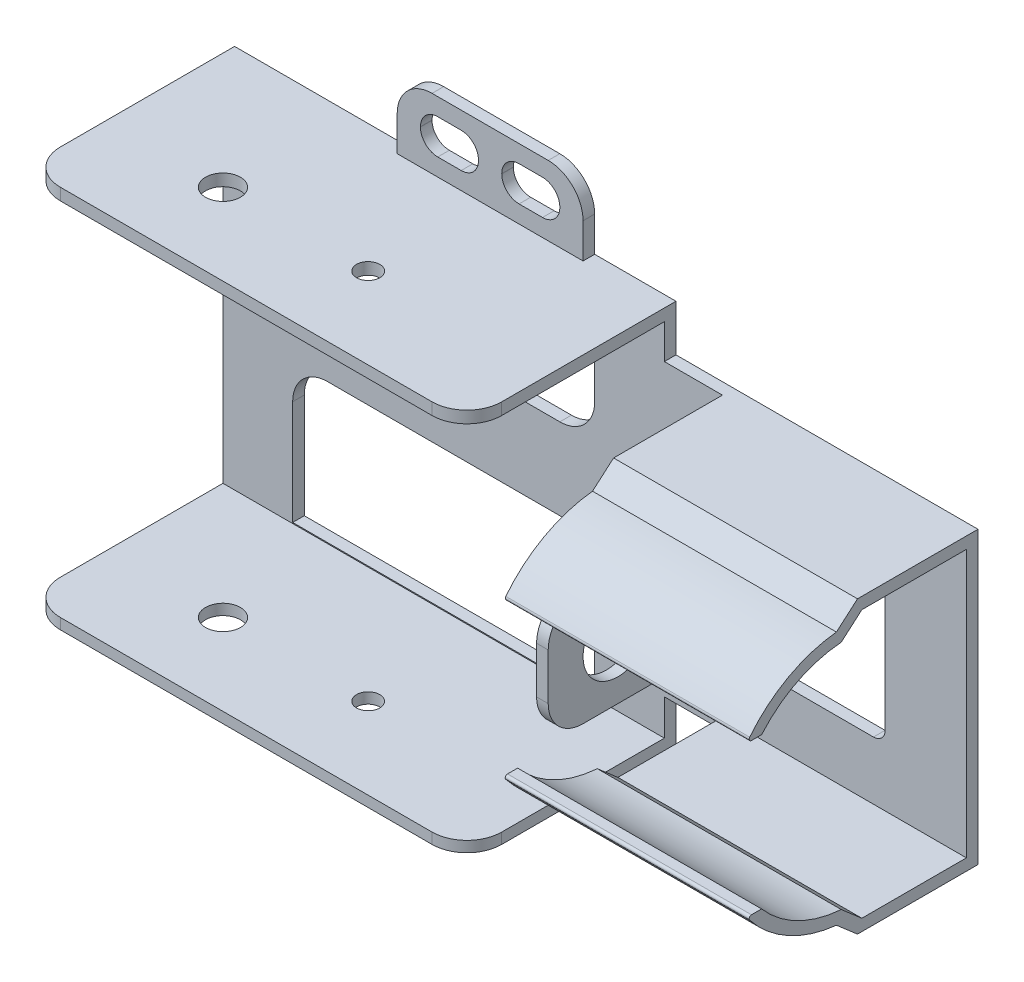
ISO-10303-21;
HEADER;
FILE_DESCRIPTION(('STEP AP214'),'2;1');
FILE_NAME('part.step','',(''),(''),'','','');
FILE_SCHEMA(('AUTOMOTIVE_DESIGN { 1 0 10303 214 1 1 1 1 }'));
ENDSEC;
DATA;
#1=APPLICATION_CONTEXT('core data for automotive mechanical design processes');
#2=APPLICATION_PROTOCOL_DEFINITION('international standard','automotive_design',2000,#1);
#3=PRODUCT_CONTEXT('',#1,'mechanical');
#4=PRODUCT('Part','Part','',(#3));
#5=PRODUCT_RELATED_PRODUCT_CATEGORY('part','',(#4));
#6=PRODUCT_DEFINITION_FORMATION('','',#4);
#7=PRODUCT_DEFINITION_CONTEXT('part definition',#1,'design');
#8=PRODUCT_DEFINITION('design','',#6,#7);
#9=PRODUCT_DEFINITION_SHAPE('','',#8);
#10=(LENGTH_UNIT() NAMED_UNIT(*) SI_UNIT(.MILLI.,.METRE.));
#11=(NAMED_UNIT(*) PLANE_ANGLE_UNIT() SI_UNIT($,.RADIAN.));
#12=(NAMED_UNIT(*) SI_UNIT($,.STERADIAN.) SOLID_ANGLE_UNIT());
#13=UNCERTAINTY_MEASURE_WITH_UNIT(LENGTH_MEASURE(1.E-05),#10,'distance_accuracy_value','');
#14=(GEOMETRIC_REPRESENTATION_CONTEXT(3) GLOBAL_UNCERTAINTY_ASSIGNED_CONTEXT((#13)) GLOBAL_UNIT_ASSIGNED_CONTEXT((#10,
#11,#12)) REPRESENTATION_CONTEXT('',''));
#15=CARTESIAN_POINT('',(0.,0.,0.));
#16=DIRECTION('',(0.,0.,1.));
#17=DIRECTION('',(1.,0.,0.));
#18=AXIS2_PLACEMENT_3D('',#15,#16,#17);
#19=CARTESIAN_POINT('',(-37.9891725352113,10.7390180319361,1.));
#20=DIRECTION('',(0.,0.,1.));
#21=DIRECTION('',(1.,0.,0.));
#22=AXIS2_PLACEMENT_3D('',#19,#20,#21);
#23=PLANE('',#22);
#24=DIRECTION('',(0.,1.,0.));
#25=VECTOR('',#24,1.);
#26=CARTESIAN_POINT('',(-36.9891725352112,-21.2522887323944,1.));
#27=LINE('',#26,#25);
#28=CARTESIAN_POINT('',(-36.9891725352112,-21.2522887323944,1.));
#29=VERTEX_POINT('',#28);
#30=CARTESIAN_POINT('',(-36.9891725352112,-12.2522887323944,1.));
#31=VERTEX_POINT('',#30);
#32=EDGE_CURVE('E1109',#29,#31,#27,.T.);
#33=ORIENTED_EDGE('',*,*,#32,.F.);
#34=DIRECTION('',(1.,0.,0.));
#35=VECTOR('',#34,1.);
#36=CARTESIAN_POINT('',(-36.9891725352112,-21.2522887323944,1.));
#37=LINE('',#36,#35);
#38=CARTESIAN_POINT('',(-62.9891725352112,-21.2522887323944,1.));
#39=VERTEX_POINT('',#38);
#40=EDGE_CURVE('E1117',#39,#29,#37,.T.);
#41=ORIENTED_EDGE('',*,*,#40,.F.);
#42=DIRECTION('',(0.,-1.,0.));
#43=VECTOR('',#42,1.);
#44=CARTESIAN_POINT('',(-62.9891725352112,-21.2522887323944,1.));
#45=LINE('',#44,#43);
#46=CARTESIAN_POINT('',(-62.9891725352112,-12.2522887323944,1.));
#47=VERTEX_POINT('',#46);
#48=EDGE_CURVE('E1115',#47,#39,#45,.T.);
#49=ORIENTED_EDGE('',*,*,#48,.F.);
#50=CARTESIAN_POINT('',(-59.9891725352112,-12.2522887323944,1.));
#51=DIRECTION('',(0.,0.,1.));
#52=DIRECTION('',(1.,0.,0.));
#53=AXIS2_PLACEMENT_3D('',#50,#51,#52);
#54=CIRCLE('',#53,3.);
#55=CARTESIAN_POINT('',(-59.9891725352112,-9.25228873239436,1.));
#56=VERTEX_POINT('',#55);
#57=EDGE_CURVE('E1351',#47,#56,#54,.F.);
#58=ORIENTED_EDGE('',*,*,#57,.T.);
#59=DIRECTION('',(-1.,0.,0.));
#60=VECTOR('',#59,1.);
#61=CARTESIAN_POINT('',(-62.9891725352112,-9.25228873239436,1.));
#62=LINE('',#61,#60);
#63=CARTESIAN_POINT('',(-39.9891725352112,-9.25228873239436,1.));
#64=VERTEX_POINT('',#63);
#65=EDGE_CURVE('E1112',#64,#56,#62,.T.);
#66=ORIENTED_EDGE('',*,*,#65,.F.);
#67=CARTESIAN_POINT('',(-39.9891725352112,-12.2522887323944,1.));
#68=DIRECTION('',(0.,0.,1.));
#69=DIRECTION('',(1.,0.,0.));
#70=AXIS2_PLACEMENT_3D('',#67,#68,#69);
#71=CIRCLE('',#70,3.);
#72=EDGE_CURVE('E1347',#64,#31,#71,.F.);
#73=ORIENTED_EDGE('',*,*,#72,.T.);
#74=EDGE_LOOP('',(#33,#41,#49,#58,#66,#73));
#75=FACE_BOUND('',#74,.T.);
#76=DIRECTION('',(0.,1.,0.));
#77=VECTOR('',#76,1.);
#78=CARTESIAN_POINT('',(-4.98917253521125,-17.2609819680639,1.));
#79=LINE('',#78,#77);
#80=CARTESIAN_POINT('',(-4.98917253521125,-17.2609819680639,1.));
#81=VERTEX_POINT('',#80);
#82=CARTESIAN_POINT('',(-4.98917253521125,5.7390180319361,1.));
#83=VERTEX_POINT('',#82);
#84=EDGE_CURVE('E995',#81,#83,#79,.T.);
#85=ORIENTED_EDGE('',*,*,#84,.T.);
#86=DIRECTION('',(1.,0.,0.));
#87=VECTOR('',#86,1.);
#88=CARTESIAN_POINT('',(-34.9891725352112,5.73901803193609,1.));
#89=LINE('',#88,#87);
#90=CARTESIAN_POINT('',(-25.9891725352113,5.73901803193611,1.));
#91=VERTEX_POINT('',#90);
#92=EDGE_CURVE('E1021',#91,#83,#89,.T.);
#93=ORIENTED_EDGE('',*,*,#92,.F.);
#94=DIRECTION('',(0.,-1.,0.));
#95=VECTOR('',#94,1.);
#96=CARTESIAN_POINT('',(-25.9891725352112,-31.8194102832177,1.));
#97=LINE('',#96,#95);
#98=CARTESIAN_POINT('',(-25.9891725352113,6.7390180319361,1.));
#99=VERTEX_POINT('',#98);
#100=EDGE_CURVE('E1055',#99,#91,#97,.T.);
#101=ORIENTED_EDGE('',*,*,#100,.F.);
#102=DIRECTION('',(-1.,0.,0.));
#103=VECTOR('',#102,1.);
#104=CARTESIAN_POINT('',(-30.9891725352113,6.7390180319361,1.));
#105=LINE('',#104,#103);
#106=CARTESIAN_POINT('',(-30.9891725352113,6.7390180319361,1.));
#107=VERTEX_POINT('',#106);
#108=EDGE_CURVE('E1257',#99,#107,#105,.T.);
#109=ORIENTED_EDGE('',*,*,#108,.T.);
#110=DIRECTION('',(0.,1.,0.));
#111=VECTOR('',#110,1.);
#112=CARTESIAN_POINT('',(-30.9891725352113,6.7390180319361,1.));
#113=LINE('',#112,#111);
#114=CARTESIAN_POINT('',(-30.9891725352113,9.71774900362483,1.));
#115=VERTEX_POINT('',#114);
#116=EDGE_CURVE('E1259',#107,#115,#113,.T.);
#117=ORIENTED_EDGE('',*,*,#116,.T.);
#118=DIRECTION('',(1.,0.,0.));
#119=VECTOR('',#118,1.);
#120=CARTESIAN_POINT('',(-68.9891725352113,9.71774900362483,1.));
#121=LINE('',#120,#119);
#122=CARTESIAN_POINT('',(-36.9891725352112,9.71774900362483,1.));
#123=VERTEX_POINT('',#122);
#124=EDGE_CURVE('E1092',#123,#115,#121,.T.);
#125=ORIENTED_EDGE('',*,*,#124,.F.);
#126=DIRECTION('',(0.,1.,0.));
#127=VECTOR('',#126,1.);
#128=CARTESIAN_POINT('',(-36.9891725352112,9.74771126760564,1.));
#129=LINE('',#128,#127);
#130=CARTESIAN_POINT('',(-36.9891725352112,0.747711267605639,1.));
#131=VERTEX_POINT('',#130);
#132=EDGE_CURVE('E1144',#131,#123,#129,.T.);
#133=ORIENTED_EDGE('',*,*,#132,.F.);
#134=CARTESIAN_POINT('',(-39.9891725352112,0.747711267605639,1.));
#135=DIRECTION('',(0.,0.,1.));
#136=DIRECTION('',(1.,0.,0.));
#137=AXIS2_PLACEMENT_3D('',#134,#135,#136);
#138=CIRCLE('',#137,3.);
#139=CARTESIAN_POINT('',(-39.9891725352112,-2.25228873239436,1.));
#140=VERTEX_POINT('',#139);
#141=EDGE_CURVE('E1355',#131,#140,#138,.F.);
#142=ORIENTED_EDGE('',*,*,#141,.T.);
#143=DIRECTION('',(1.,0.,0.));
#144=VECTOR('',#143,1.);
#145=CARTESIAN_POINT('',(-62.9891725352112,-2.25228873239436,1.));
#146=LINE('',#145,#144);
#147=CARTESIAN_POINT('',(-59.9891725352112,-2.25228873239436,1.));
#148=VERTEX_POINT('',#147);
#149=EDGE_CURVE('E1140',#148,#140,#146,.T.);
#150=ORIENTED_EDGE('',*,*,#149,.F.);
#151=CARTESIAN_POINT('',(-59.9891725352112,0.747711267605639,1.));
#152=DIRECTION('',(0.,0.,1.));
#153=DIRECTION('',(1.,0.,0.));
#154=AXIS2_PLACEMENT_3D('',#151,#152,#153);
#155=CIRCLE('',#154,3.);
#156=CARTESIAN_POINT('',(-62.9891725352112,0.747711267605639,1.));
#157=VERTEX_POINT('',#156);
#158=EDGE_CURVE('E1359',#148,#157,#155,.F.);
#159=ORIENTED_EDGE('',*,*,#158,.T.);
#160=DIRECTION('',(0.,-1.,0.));
#161=VECTOR('',#160,1.);
#162=CARTESIAN_POINT('',(-62.9891725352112,9.74771126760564,1.));
#163=LINE('',#162,#161);
#164=CARTESIAN_POINT('',(-62.9891725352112,9.71774900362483,1.));
#165=VERTEX_POINT('',#164);
#166=EDGE_CURVE('E1134',#165,#157,#163,.T.);
#167=ORIENTED_EDGE('',*,*,#166,.F.);
#168=CARTESIAN_POINT('',(-68.9891725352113,9.71774900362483,1.));
#169=VERTEX_POINT('',#168);
#170=EDGE_CURVE('E1093',#169,#165,#121,.T.);
#171=ORIENTED_EDGE('',*,*,#170,.F.);
#172=DIRECTION('',(0.,-1.,0.));
#173=VECTOR('',#172,1.);
#174=CARTESIAN_POINT('',(-68.9891725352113,10.7390180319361,1.));
#175=LINE('',#174,#173);
#176=CARTESIAN_POINT('',(-68.9891725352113,-21.3364550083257,1.));
#177=VERTEX_POINT('',#176);
#178=EDGE_CURVE('E1241',#169,#177,#175,.T.);
#179=ORIENTED_EDGE('',*,*,#178,.T.);
#180=DIRECTION('',(-1.,0.,0.));
#181=VECTOR('',#180,1.);
#182=CARTESIAN_POINT('',(-68.9891725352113,-21.3364550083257,1.));
#183=LINE('',#182,#181);
#184=CARTESIAN_POINT('',(-30.9891725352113,-21.3364550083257,1.));
#185=VERTEX_POINT('',#184);
#186=EDGE_CURVE('E1079',#185,#177,#183,.T.);
#187=ORIENTED_EDGE('',*,*,#186,.F.);
#188=DIRECTION('',(0.,1.,0.));
#189=VECTOR('',#188,1.);
#190=CARTESIAN_POINT('',(-30.9891725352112,-18.2522887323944,1.));
#191=LINE('',#190,#189);
#192=CARTESIAN_POINT('',(-30.9891725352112,-18.2522887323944,1.));
#193=VERTEX_POINT('',#192);
#194=EDGE_CURVE('E1252',#185,#193,#191,.T.);
#195=ORIENTED_EDGE('',*,*,#194,.T.);
#196=DIRECTION('',(1.,0.,0.));
#197=VECTOR('',#196,1.);
#198=CARTESIAN_POINT('',(-4.98917253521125,-18.2522887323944,1.));
#199=LINE('',#198,#197);
#200=CARTESIAN_POINT('',(-25.9891725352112,-18.2522887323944,1.));
#201=VERTEX_POINT('',#200);
#202=EDGE_CURVE('E1254',#193,#201,#199,.T.);
#203=ORIENTED_EDGE('',*,*,#202,.T.);
#204=CARTESIAN_POINT('',(-25.9891725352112,-17.2609819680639,1.));
#205=VERTEX_POINT('',#204);
#206=EDGE_CURVE('E1054',#205,#201,#97,.T.);
#207=ORIENTED_EDGE('',*,*,#206,.F.);
#208=DIRECTION('',(1.,0.,0.));
#209=VECTOR('',#208,1.);
#210=CARTESIAN_POINT('',(-34.9891725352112,-17.2609819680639,1.));
#211=LINE('',#210,#209);
#212=EDGE_CURVE('E1010',#205,#81,#211,.T.);
#213=ORIENTED_EDGE('',*,*,#212,.T.);
#214=EDGE_LOOP('',(#85,#93,#101,#109,#117,#125,#133,#142,#150,#159,#167,#171,#179,#187,#195,
#203,#207,#213));
#215=FACE_BOUND('',#214,.T.);
#216=DIRECTION('',(0.,-1.,0.));
#217=VECTOR('',#216,1.);
#218=CARTESIAN_POINT('',(-25.9891725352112,-0.760981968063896,1.));
#219=LINE('',#218,#217);
#220=CARTESIAN_POINT('',(-25.9891725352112,-0.760981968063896,1.));
#221=VERTEX_POINT('',#220);
#222=CARTESIAN_POINT('',(-25.9891725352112,-10.7609819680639,1.));
#223=VERTEX_POINT('',#222);
#224=EDGE_CURVE('E962',#221,#223,#219,.T.);
#225=ORIENTED_EDGE('',*,*,#224,.F.);
#226=DIRECTION('',(-1.,0.,0.));
#227=VECTOR('',#226,1.);
#228=CARTESIAN_POINT('',(-24.9891725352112,-0.760981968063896,1.));
#229=LINE('',#228,#227);
#230=CARTESIAN_POINT('',(-24.9891725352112,-0.760981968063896,1.));
#231=VERTEX_POINT('',#230);
#232=EDGE_CURVE('E959',#231,#221,#229,.T.);
#233=ORIENTED_EDGE('',*,*,#232,.F.);
#234=DIRECTION('',(0.,-1.,0.));
#235=VECTOR('',#234,1.);
#236=CARTESIAN_POINT('',(-24.9891725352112,0.739018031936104,1.));
#237=LINE('',#236,#235);
#238=CARTESIAN_POINT('',(-24.9891725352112,-0.260981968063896,1.));
#239=VERTEX_POINT('',#238);
#240=EDGE_CURVE('E1168',#239,#231,#237,.T.);
#241=ORIENTED_EDGE('',*,*,#240,.F.);
#242=CARTESIAN_POINT('',(-23.9891725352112,-0.260981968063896,1.));
#243=DIRECTION('',(0.,0.,1.));
#244=DIRECTION('',(1.,0.,0.));
#245=AXIS2_PLACEMENT_3D('',#242,#243,#244);
#246=CIRCLE('',#245,1.);
#247=CARTESIAN_POINT('',(-23.9891725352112,0.739018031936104,1.));
#248=VERTEX_POINT('',#247);
#249=EDGE_CURVE('E40',#239,#248,#246,.F.);
#250=ORIENTED_EDGE('',*,*,#249,.T.);
#251=DIRECTION('',(-1.,0.,0.));
#252=VECTOR('',#251,1.);
#253=CARTESIAN_POINT('',(-24.9891725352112,0.739018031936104,1.));
#254=LINE('',#253,#252);
#255=CARTESIAN_POINT('',(-12.9891725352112,0.739018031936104,1.));
#256=VERTEX_POINT('',#255);
#257=EDGE_CURVE('E1176',#256,#248,#254,.T.);
#258=ORIENTED_EDGE('',*,*,#257,.F.);
#259=CARTESIAN_POINT('',(-12.9891725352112,-0.260981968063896,1.));
#260=DIRECTION('',(0.,0.,1.));
#261=DIRECTION('',(1.,0.,0.));
#262=AXIS2_PLACEMENT_3D('',#259,#260,#261);
#263=CIRCLE('',#262,1.);
#264=CARTESIAN_POINT('',(-11.9891725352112,-0.260981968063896,1.));
#265=VERTEX_POINT('',#264);
#266=EDGE_CURVE('E1474',#256,#265,#263,.F.);
#267=ORIENTED_EDGE('',*,*,#266,.T.);
#268=DIRECTION('',(0.,1.,0.));
#269=VECTOR('',#268,1.);
#270=CARTESIAN_POINT('',(-11.9891725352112,0.739018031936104,1.));
#271=LINE('',#270,#269);
#272=CARTESIAN_POINT('',(-11.9891725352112,-11.2522887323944,1.));
#273=VERTEX_POINT('',#272);
#274=EDGE_CURVE('E1173',#273,#265,#271,.T.);
#275=ORIENTED_EDGE('',*,*,#274,.F.);
#276=CARTESIAN_POINT('',(-12.9891725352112,-11.2522887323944,1.));
#277=DIRECTION('',(0.,0.,1.));
#278=DIRECTION('',(1.,0.,0.));
#279=AXIS2_PLACEMENT_3D('',#276,#277,#278);
#280=CIRCLE('',#279,1.);
#281=CARTESIAN_POINT('',(-12.9891725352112,-12.2522887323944,1.));
#282=VERTEX_POINT('',#281);
#283=EDGE_CURVE('E1478',#273,#282,#280,.F.);
#284=ORIENTED_EDGE('',*,*,#283,.T.);
#285=DIRECTION('',(1.,0.,0.));
#286=VECTOR('',#285,1.);
#287=CARTESIAN_POINT('',(-24.9891725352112,-12.2522887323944,1.));
#288=LINE('',#287,#286);
#289=CARTESIAN_POINT('',(-23.9891725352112,-12.2522887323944,1.));
#290=VERTEX_POINT('',#289);
#291=EDGE_CURVE('E1170',#290,#282,#288,.T.);
#292=ORIENTED_EDGE('',*,*,#291,.F.);
#293=CARTESIAN_POINT('',(-23.9891725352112,-11.2522887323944,1.));
#294=DIRECTION('',(0.,0.,1.));
#295=DIRECTION('',(1.,0.,0.));
#296=AXIS2_PLACEMENT_3D('',#293,#294,#295);
#297=CIRCLE('',#296,1.);
#298=CARTESIAN_POINT('',(-24.9891725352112,-11.2522887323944,1.));
#299=VERTEX_POINT('',#298);
#300=EDGE_CURVE('E1482',#290,#299,#297,.F.);
#301=ORIENTED_EDGE('',*,*,#300,.T.);
#302=CARTESIAN_POINT('',(-24.9891725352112,-10.7609819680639,1.));
#303=VERTEX_POINT('',#302);
#304=EDGE_CURVE('E1165',#303,#299,#237,.T.);
#305=ORIENTED_EDGE('',*,*,#304,.F.);
#306=DIRECTION('',(1.,0.,0.));
#307=VECTOR('',#306,1.);
#308=CARTESIAN_POINT('',(-24.9891725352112,-10.7609819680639,1.));
#309=LINE('',#308,#307);
#310=EDGE_CURVE('E965',#223,#303,#309,.T.);
#311=ORIENTED_EDGE('',*,*,#310,.F.);
#312=EDGE_LOOP('',(#225,#233,#241,#250,#258,#267,#275,#284,#292,#301,#305,#311));
#313=FACE_BOUND('',#312,.T.);
#314=ADVANCED_FACE('F31',(#75,#215,#313),#23,.T.);
#315=CARTESIAN_POINT('',(-4.98917253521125,6.7390180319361,1.));
#316=DIRECTION('',(-1.,0.,0.));
#317=DIRECTION('',(0.,-1.,0.));
#318=AXIS2_PLACEMENT_3D('',#315,#316,#317);
#319=PLANE('',#318);
#320=DIRECTION('',(0.,0.,-1.));
#321=VECTOR('',#320,1.);
#322=CARTESIAN_POINT('',(-4.98917253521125,-12.2522887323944,1.));
#323=LINE('',#322,#321);
#324=CARTESIAN_POINT('',(-4.98917253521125,-12.2522887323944,19.5028100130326));
#325=VERTEX_POINT('',#324);
#326=CARTESIAN_POINT('',(-4.98917253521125,-12.2522887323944,18.6317851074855));
#327=VERTEX_POINT('',#326);
#328=EDGE_CURVE('E991',#325,#327,#323,.T.);
#329=ORIENTED_EDGE('',*,*,#328,.F.);
#330=CARTESIAN_POINT('',(-4.98917253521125,-12.4522887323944,19.5028100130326));
#331=DIRECTION('',(-1.,0.,0.));
#332=DIRECTION('',(0.,-1.,0.));
#333=AXIS2_PLACEMENT_3D('',#330,#331,#332);
#334=CIRCLE('',#333,0.200000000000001);
#335=CARTESIAN_POINT('',(-4.98917253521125,-12.5763111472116,19.6597126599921));
#336=VERTEX_POINT('',#335);
#337=EDGE_CURVE('E1423',#325,#336,#334,.F.);
#338=ORIENTED_EDGE('',*,*,#337,.T.);
#339=CARTESIAN_POINT('',(-4.98917253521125,-5.76098196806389,11.0375358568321));
#340=DIRECTION('',(-1.,0.,0.));
#341=DIRECTION('',(0.,-1.,0.));
#342=AXIS2_PLACEMENT_3D('',#339,#340,#341);
#343=CIRCLE('',#342,10.9904797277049);
#344=CARTESIAN_POINT('',(-4.98917253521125,-16.6911879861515,12.186988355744));
#345=VERTEX_POINT('',#344);
#346=EDGE_CURVE('E1026',#345,#336,#343,.T.);
#347=ORIENTED_EDGE('',*,*,#346,.F.);
#348=DIRECTION('',(0.,-0.654281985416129,-0.756250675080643));
#349=VECTOR('',#348,1.);
#350=CARTESIAN_POINT('',(-4.98917253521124,-23.7477439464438,4.03068063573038));
#351=LINE('',#350,#349);
#352=CARTESIAN_POINT('',(-4.98917253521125,-18.2609819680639,10.3725447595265));
#353=VERTEX_POINT('',#352);
#354=EDGE_CURVE('E1029',#345,#353,#351,.T.);
#355=ORIENTED_EDGE('',*,*,#354,.T.);
#356=DIRECTION('',(0.,0.,-1.));
#357=VECTOR('',#356,1.);
#358=CARTESIAN_POINT('',(-4.98917253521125,-18.2609819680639,11.0140077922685));
#359=LINE('',#358,#357);
#360=CARTESIAN_POINT('',(-4.98917253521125,-18.2609819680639,0.));
#361=VERTEX_POINT('',#360);
#362=EDGE_CURVE('E1032',#353,#361,#359,.T.);
#363=ORIENTED_EDGE('',*,*,#362,.T.);
#364=DIRECTION('',(0.,1.,0.));
#365=VECTOR('',#364,1.);
#366=CARTESIAN_POINT('',(-4.98917253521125,6.7390180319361,0.));
#367=LINE('',#366,#365);
#368=CARTESIAN_POINT('',(-4.98917253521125,6.7390180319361,0.));
#369=VERTEX_POINT('',#368);
#370=EDGE_CURVE('E1225',#361,#369,#367,.T.);
#371=ORIENTED_EDGE('',*,*,#370,.T.);
#372=DIRECTION('',(0.,0.,-1.));
#373=VECTOR('',#372,1.);
#374=CARTESIAN_POINT('',(-4.98917253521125,6.7390180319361,1.));
#375=LINE('',#374,#373);
#376=CARTESIAN_POINT('',(-4.98917253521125,6.73901803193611,10.3725447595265));
#377=VERTEX_POINT('',#376);
#378=EDGE_CURVE('E1267',#377,#369,#375,.T.);
#379=ORIENTED_EDGE('',*,*,#378,.F.);
#380=DIRECTION('',(0.,0.65428198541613,-0.756250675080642));
#381=VECTOR('',#380,1.);
#382=CARTESIAN_POINT('',(-4.98917253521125,-10.0846602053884,29.8181634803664));
#383=LINE('',#382,#381);
#384=CARTESIAN_POINT('',(-4.98917253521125,5.16922405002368,12.186988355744));
#385=VERTEX_POINT('',#384);
#386=EDGE_CURVE('E1035',#385,#377,#383,.T.);
#387=ORIENTED_EDGE('',*,*,#386,.F.);
#388=CARTESIAN_POINT('',(-4.98917253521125,1.06320157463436,19.6527064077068));
#389=VERTEX_POINT('',#388);
#390=EDGE_CURVE('E1013',#389,#385,#343,.T.);
#391=ORIENTED_EDGE('',*,*,#390,.F.);
#392=CARTESIAN_POINT('',(-4.98917253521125,0.939018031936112,19.4959312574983));
#393=DIRECTION('',(-1.,0.,0.));
#394=DIRECTION('',(0.,-1.,0.));
#395=AXIS2_PLACEMENT_3D('',#392,#393,#394);
#396=CIRCLE('',#395,0.200000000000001);
#397=CARTESIAN_POINT('',(-4.98917253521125,0.739018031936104,19.4959312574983));
#398=VERTEX_POINT('',#397);
#399=EDGE_CURVE('E1421',#389,#398,#396,.F.);
#400=ORIENTED_EDGE('',*,*,#399,.T.);
#401=DIRECTION('',(0.,0.,1.));
#402=VECTOR('',#401,1.);
#403=CARTESIAN_POINT('',(-4.98917253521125,0.739018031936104,1.));
#404=LINE('',#403,#402);
#405=CARTESIAN_POINT('',(-4.98917253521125,0.739018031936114,18.6243458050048));
#406=VERTEX_POINT('',#405);
#407=EDGE_CURVE('E986',#406,#398,#404,.T.);
#408=ORIENTED_EDGE('',*,*,#407,.F.);
#409=CARTESIAN_POINT('',(-4.98917253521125,-5.76098196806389,11.0375358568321));
#410=DIRECTION('',(1.,0.,0.));
#411=DIRECTION('',(0.,1.,0.));
#412=AXIS2_PLACEMENT_3D('',#409,#410,#411);
#413=CIRCLE('',#412,9.99047972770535);
#414=CARTESIAN_POINT('',(-4.98917253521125,4.20213829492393,11.7763997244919));
#415=VERTEX_POINT('',#414);
#416=EDGE_CURVE('E1004',#415,#406,#413,.T.);
#417=ORIENTED_EDGE('',*,*,#416,.F.);
#418=DIRECTION('',(0.,-0.654281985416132,0.756250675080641));
#419=VECTOR('',#418,1.);
#420=CARTESIAN_POINT('',(-4.98917253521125,5.73901803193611,10.));
#421=LINE('',#420,#419);
#422=CARTESIAN_POINT('',(-4.98917253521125,5.73901803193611,10.));
#423=VERTEX_POINT('',#422);
#424=EDGE_CURVE('E1000',#423,#415,#421,.T.);
#425=ORIENTED_EDGE('',*,*,#424,.F.);
#426=DIRECTION('',(0.,0.,1.));
#427=VECTOR('',#426,1.);
#428=CARTESIAN_POINT('',(-4.98917253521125,5.7390180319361,1.));
#429=LINE('',#428,#427);
#430=EDGE_CURVE('E997',#83,#423,#429,.T.);
#431=ORIENTED_EDGE('',*,*,#430,.F.);
#432=ORIENTED_EDGE('',*,*,#84,.F.);
#433=DIRECTION('',(0.,0.,-1.));
#434=VECTOR('',#433,1.);
#435=CARTESIAN_POINT('',(-4.98917253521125,-17.2609819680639,10.));
#436=LINE('',#435,#434);
#437=CARTESIAN_POINT('',(-4.98917253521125,-17.2609819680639,10.));
#438=VERTEX_POINT('',#437);
#439=EDGE_CURVE('E993',#438,#81,#436,.T.);
#440=ORIENTED_EDGE('',*,*,#439,.F.);
#441=DIRECTION('',(0.,-0.654281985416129,-0.756250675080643));
#442=VECTOR('',#441,1.);
#443=CARTESIAN_POINT('',(-4.98917253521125,-15.7241022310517,11.7763997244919));
#444=LINE('',#443,#442);
#445=CARTESIAN_POINT('',(-4.98917253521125,-15.7241022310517,11.7763997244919));
#446=VERTEX_POINT('',#445);
#447=EDGE_CURVE('E1007',#446,#438,#444,.T.);
#448=ORIENTED_EDGE('',*,*,#447,.F.);
#449=EDGE_CURVE('E1003',#327,#446,#413,.T.);
#450=ORIENTED_EDGE('',*,*,#449,.F.);
#451=EDGE_LOOP('',(#329,#338,#347,#355,#363,#371,#379,#387,#391,#400,#408,#417,#425,#431,#432,
#440,#448,#450));
#452=FACE_BOUND('',#451,.T.);
#453=ADVANCED_FACE('F1596',(#452),#319,.F.);
#454=CARTESIAN_POINT('',(-25.9891725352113,-5.76098196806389,11.0375358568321));
#455=DIRECTION('',(1.,0.,0.));
#456=DIRECTION('',(0.,1.,0.));
#457=AXIS2_PLACEMENT_3D('',#454,#455,#456);
#458=CYLINDRICAL_SURFACE('',#457,10.9904797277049);
#459=ORIENTED_EDGE('',*,*,#346,.T.);
#460=DIRECTION('',(1.,0.,0.));
#461=VECTOR('',#460,1.);
#462=CARTESIAN_POINT('',(-25.9891725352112,-12.5763111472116,19.6597126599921));
#463=LINE('',#462,#461);
#464=CARTESIAN_POINT('',(-25.9891725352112,-12.5763111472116,19.6597126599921));
#465=VERTEX_POINT('',#464);
#466=EDGE_CURVE('E1425',#336,#465,#463,.F.);
#467=ORIENTED_EDGE('',*,*,#466,.T.);
#468=CARTESIAN_POINT('',(-25.9891725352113,-5.76098196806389,11.0375358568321));
#469=DIRECTION('',(-1.,0.,0.));
#470=DIRECTION('',(0.,-1.,0.));
#471=AXIS2_PLACEMENT_3D('',#468,#469,#470);
#472=CIRCLE('',#471,10.9904797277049);
#473=CARTESIAN_POINT('',(-25.9891725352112,-16.6911879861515,12.186988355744));
#474=VERTEX_POINT('',#473);
#475=EDGE_CURVE('E1039',#474,#465,#472,.T.);
#476=ORIENTED_EDGE('',*,*,#475,.F.);
#477=DIRECTION('',(1.,0.,0.));
#478=VECTOR('',#477,1.);
#479=CARTESIAN_POINT('',(-25.9891725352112,-16.6911879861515,12.186988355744));
#480=LINE('',#479,#478);
#481=EDGE_CURVE('E1063',#474,#345,#480,.T.);
#482=ORIENTED_EDGE('',*,*,#481,.T.);
#483=EDGE_LOOP('',(#459,#467,#476,#482));
#484=FACE_BOUND('',#483,.T.);
#485=ADVANCED_FACE('F1732',(#484),#458,.T.);
#486=CARTESIAN_POINT('',(-25.9891725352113,1.06320157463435,19.6527064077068));
#487=VERTEX_POINT('',#486);
#488=CARTESIAN_POINT('',(-25.9891725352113,5.16922405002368,12.186988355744));
#489=VERTEX_POINT('',#488);
#490=EDGE_CURVE('E1038',#487,#489,#472,.T.);
#491=ORIENTED_EDGE('',*,*,#490,.F.);
#492=DIRECTION('',(1.,0.,0.));
#493=VECTOR('',#492,1.);
#494=CARTESIAN_POINT('',(-25.9891725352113,1.06320157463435,19.6527064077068));
#495=LINE('',#494,#493);
#496=EDGE_CURVE('E1434',#487,#389,#495,.T.);
#497=ORIENTED_EDGE('',*,*,#496,.T.);
#498=ORIENTED_EDGE('',*,*,#390,.T.);
#499=DIRECTION('',(1.,0.,0.));
#500=VECTOR('',#499,1.);
#501=CARTESIAN_POINT('',(-25.9891725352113,5.16922405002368,12.186988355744));
#502=LINE('',#501,#500);
#503=EDGE_CURVE('E1064',#489,#385,#502,.T.);
#504=ORIENTED_EDGE('',*,*,#503,.F.);
#505=EDGE_LOOP('',(#491,#497,#498,#504));
#506=FACE_BOUND('',#505,.T.);
#507=ADVANCED_FACE('F1871',(#506),#458,.T.);
#508=CARTESIAN_POINT('',(-25.9891725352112,-31.8194102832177,11.0140077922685));
#509=DIRECTION('',(-1.,0.,0.));
#510=DIRECTION('',(0.,-1.,0.));
#511=AXIS2_PLACEMENT_3D('',#508,#509,#510);
#512=PLANE('',#511);
#513=ORIENTED_EDGE('',*,*,#475,.T.);
#514=CARTESIAN_POINT('',(-25.9891725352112,-12.4522887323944,19.5028100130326));
#515=DIRECTION('',(-1.,0.,0.));
#516=DIRECTION('',(0.,-1.,0.));
#517=AXIS2_PLACEMENT_3D('',#514,#515,#516);
#518=CIRCLE('',#517,0.200000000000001);
#519=CARTESIAN_POINT('',(-25.9891725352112,-12.2522887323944,19.5028100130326));
#520=VERTEX_POINT('',#519);
#521=EDGE_CURVE('E1427',#465,#520,#518,.T.);
#522=ORIENTED_EDGE('',*,*,#521,.T.);
#523=DIRECTION('',(0.,0.,-1.));
#524=VECTOR('',#523,1.);
#525=CARTESIAN_POINT('',(-25.9891725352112,-12.2522887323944,11.0140077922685));
#526=LINE('',#525,#524);
#527=CARTESIAN_POINT('',(-25.9891725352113,-12.2522887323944,18.6317851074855));
#528=VERTEX_POINT('',#527);
#529=EDGE_CURVE('E989',#520,#528,#526,.T.);
#530=ORIENTED_EDGE('',*,*,#529,.T.);
#531=CARTESIAN_POINT('',(-25.9891725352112,-5.76098196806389,11.0375358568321));
#532=DIRECTION('',(-1.,0.,0.));
#533=DIRECTION('',(0.,-1.,0.));
#534=AXIS2_PLACEMENT_3D('',#531,#532,#533);
#535=CIRCLE('',#534,9.99047972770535);
#536=CARTESIAN_POINT('',(-25.9891725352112,-15.7241022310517,11.7763997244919));
#537=VERTEX_POINT('',#536);
#538=EDGE_CURVE('E1406',#537,#528,#535,.T.);
#539=ORIENTED_EDGE('',*,*,#538,.F.);
#540=DIRECTION('',(0.,0.654281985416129,0.756250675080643));
#541=VECTOR('',#540,1.);
#542=CARTESIAN_POINT('',(-25.9891725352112,-22.9914932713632,3.37639865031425));
#543=LINE('',#542,#541);
#544=CARTESIAN_POINT('',(-25.9891725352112,-17.2609819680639,10.));
#545=VERTEX_POINT('',#544);
#546=EDGE_CURVE('E1409',#545,#537,#543,.T.);
#547=ORIENTED_EDGE('',*,*,#546,.F.);
#548=DIRECTION('',(0.,0.,1.));
#549=VECTOR('',#548,1.);
#550=CARTESIAN_POINT('',(-25.9891725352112,-17.2609819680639,11.0140077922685));
#551=LINE('',#550,#549);
#552=EDGE_CURVE('E1411',#205,#545,#551,.T.);
#553=ORIENTED_EDGE('',*,*,#552,.F.);
#554=ORIENTED_EDGE('',*,*,#206,.T.);
#555=DIRECTION('',(0.,0.,1.));
#556=VECTOR('',#555,1.);
#557=CARTESIAN_POINT('',(-25.9891725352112,-18.2522887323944,11.0140077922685));
#558=LINE('',#557,#556);
#559=CARTESIAN_POINT('',(-25.9891725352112,-18.2522887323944,0.));
#560=VERTEX_POINT('',#559);
#561=EDGE_CURVE('E1051',#560,#201,#558,.T.);
#562=ORIENTED_EDGE('',*,*,#561,.F.);
#563=DIRECTION('',(0.,1.,0.));
#564=VECTOR('',#563,1.);
#565=CARTESIAN_POINT('',(-25.9891725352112,-31.8194102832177,0.));
#566=LINE('',#565,#564);
#567=CARTESIAN_POINT('',(-25.9891725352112,-18.2609819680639,0.));
#568=VERTEX_POINT('',#567);
#569=EDGE_CURVE('E1048',#568,#560,#566,.T.);
#570=ORIENTED_EDGE('',*,*,#569,.F.);
#571=DIRECTION('',(0.,0.,-1.));
#572=VECTOR('',#571,1.);
#573=CARTESIAN_POINT('',(-25.9891725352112,-18.2609819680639,11.0140077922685));
#574=LINE('',#573,#572);
#575=CARTESIAN_POINT('',(-25.9891725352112,-18.2609819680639,10.3725447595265));
#576=VERTEX_POINT('',#575);
#577=EDGE_CURVE('E1045',#576,#568,#574,.T.);
#578=ORIENTED_EDGE('',*,*,#577,.F.);
#579=DIRECTION('',(0.,-0.654281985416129,-0.756250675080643));
#580=VECTOR('',#579,1.);
#581=CARTESIAN_POINT('',(-25.9891725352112,-23.7477439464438,4.03068063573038));
#582=LINE('',#581,#580);
#583=EDGE_CURVE('E1042',#474,#576,#582,.T.);
#584=ORIENTED_EDGE('',*,*,#583,.F.);
#585=EDGE_LOOP('',(#513,#522,#530,#539,#547,#553,#554,#562,#570,#578,#584));
#586=FACE_BOUND('',#585,.T.);
#587=ADVANCED_FACE('F1574',(#586),#512,.T.);
#588=DIRECTION('',(0.,0.,1.));
#589=VECTOR('',#588,1.);
#590=CARTESIAN_POINT('',(-25.9891725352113,0.739018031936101,11.0140077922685));
#591=LINE('',#590,#589);
#592=CARTESIAN_POINT('',(-25.9891725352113,0.739018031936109,18.6243458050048));
#593=VERTEX_POINT('',#592);
#594=CARTESIAN_POINT('',(-25.9891725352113,0.739018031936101,19.4959312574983));
#595=VERTEX_POINT('',#594);
#596=EDGE_CURVE('E983',#593,#595,#591,.T.);
#597=ORIENTED_EDGE('',*,*,#596,.T.);
#598=CARTESIAN_POINT('',(-25.9891725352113,0.939018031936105,19.4959312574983));
#599=DIRECTION('',(-1.,0.,0.));
#600=DIRECTION('',(0.,-1.,0.));
#601=AXIS2_PLACEMENT_3D('',#598,#599,#600);
#602=CIRCLE('',#601,0.200000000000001);
#603=EDGE_CURVE('E1432',#595,#487,#602,.T.);
#604=ORIENTED_EDGE('',*,*,#603,.T.);
#605=ORIENTED_EDGE('',*,*,#490,.T.);
#606=DIRECTION('',(0.,0.65428198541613,-0.756250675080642));
#607=VECTOR('',#606,1.);
#608=CARTESIAN_POINT('',(-25.9891725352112,-10.0846602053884,29.8181634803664));
#609=LINE('',#608,#607);
#610=CARTESIAN_POINT('',(-25.9891725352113,6.7390180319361,10.3725447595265));
#611=VERTEX_POINT('',#610);
#612=EDGE_CURVE('E1061',#489,#611,#609,.T.);
#613=ORIENTED_EDGE('',*,*,#612,.T.);
#614=DIRECTION('',(0.,0.,-1.));
#615=VECTOR('',#614,1.);
#616=CARTESIAN_POINT('',(-25.9891725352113,6.7390180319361,11.0140077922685));
#617=LINE('',#616,#615);
#618=EDGE_CURVE('E1058',#611,#99,#617,.T.);
#619=ORIENTED_EDGE('',*,*,#618,.T.);
#620=ORIENTED_EDGE('',*,*,#100,.T.);
#621=DIRECTION('',(0.,0.,-1.));
#622=VECTOR('',#621,1.);
#623=CARTESIAN_POINT('',(-25.9891725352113,5.73901803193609,11.0140077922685));
#624=LINE('',#623,#622);
#625=CARTESIAN_POINT('',(-25.9891725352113,5.7390180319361,10.));
#626=VERTEX_POINT('',#625);
#627=EDGE_CURVE('E1400',#626,#91,#624,.T.);
#628=ORIENTED_EDGE('',*,*,#627,.F.);
#629=DIRECTION('',(0.,0.654281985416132,-0.756250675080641));
#630=VECTOR('',#629,1.);
#631=CARTESIAN_POINT('',(-25.9891725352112,-10.8409108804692,29.1638814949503));
#632=LINE('',#631,#630);
#633=CARTESIAN_POINT('',(-25.9891725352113,4.20213829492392,11.7763997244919));
#634=VERTEX_POINT('',#633);
#635=EDGE_CURVE('E1403',#634,#626,#632,.T.);
#636=ORIENTED_EDGE('',*,*,#635,.F.);
#637=EDGE_CURVE('E1405',#593,#634,#535,.T.);
#638=ORIENTED_EDGE('',*,*,#637,.F.);
#639=EDGE_LOOP('',(#597,#604,#605,#613,#619,#620,#628,#636,#638));
#640=FACE_BOUND('',#639,.T.);
#641=ADVANCED_FACE('F1626',(#640),#512,.T.);
#642=CARTESIAN_POINT('',(-34.9891725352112,-5.7609819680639,11.0375358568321));
#643=DIRECTION('',(1.,0.,0.));
#644=DIRECTION('',(0.,1.,0.));
#645=AXIS2_PLACEMENT_3D('',#642,#643,#644);
#646=CYLINDRICAL_SURFACE('',#645,9.99047972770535);
#647=DIRECTION('',(1.,0.,0.));
#648=VECTOR('',#647,1.);
#649=CARTESIAN_POINT('',(-34.9891725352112,-12.2522887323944,18.6317851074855));
#650=LINE('',#649,#648);
#651=EDGE_CURVE('E1415',#327,#528,#650,.F.);
#652=ORIENTED_EDGE('',*,*,#651,.F.);
#653=ORIENTED_EDGE('',*,*,#449,.T.);
#654=DIRECTION('',(1.,0.,0.));
#655=VECTOR('',#654,1.);
#656=CARTESIAN_POINT('',(-34.9891725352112,-15.7241022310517,11.7763997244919));
#657=LINE('',#656,#655);
#658=EDGE_CURVE('E1014',#537,#446,#657,.T.);
#659=ORIENTED_EDGE('',*,*,#658,.F.);
#660=ORIENTED_EDGE('',*,*,#538,.T.);
#661=EDGE_LOOP('',(#652,#653,#659,#660));
#662=FACE_BOUND('',#661,.T.);
#663=ADVANCED_FACE('F1602',(#662),#646,.F.);
#664=DIRECTION('',(1.,0.,0.));
#665=VECTOR('',#664,1.);
#666=CARTESIAN_POINT('',(-34.9891725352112,0.739018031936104,18.6243458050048));
#667=LINE('',#666,#665);
#668=EDGE_CURVE('E1413',#593,#406,#667,.T.);
#669=ORIENTED_EDGE('',*,*,#668,.F.);
#670=ORIENTED_EDGE('',*,*,#637,.T.);
#671=DIRECTION('',(1.,0.,0.));
#672=VECTOR('',#671,1.);
#673=CARTESIAN_POINT('',(-34.9891725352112,4.20213829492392,11.7763997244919));
#674=LINE('',#673,#672);
#675=EDGE_CURVE('E1017',#634,#415,#674,.T.);
#676=ORIENTED_EDGE('',*,*,#675,.T.);
#677=ORIENTED_EDGE('',*,*,#416,.T.);
#678=EDGE_LOOP('',(#669,#670,#676,#677));
#679=FACE_BOUND('',#678,.T.);
#680=ADVANCED_FACE('F1739',(#679),#646,.F.);
#681=CARTESIAN_POINT('',(-43.4991725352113,-25.2509819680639,1.));
#682=DIRECTION('',(0.,0.,1.));
#683=DIRECTION('',(-1.,0.,0.));
#684=AXIS2_PLACEMENT_3D('',#681,#682,#683);
#685=CIRCLE('',#684,1.49);
#686=CARTESIAN_POINT('',(-43.4991725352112,-23.7609819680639,1.));
#687=VERTEX_POINT('',#686);
#688=CARTESIAN_POINT('',(-44.9891725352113,-25.2509819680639,1.));
#689=VERTEX_POINT('',#688);
#690=EDGE_CURVE('E792',#687,#689,#685,.T.);
#691=ORIENTED_EDGE('',*,*,#690,.F.);
#692=DIRECTION('',(-1.,0.,0.));
#693=VECTOR('',#692,1.);
#694=CARTESIAN_POINT('',(-43.4991725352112,-23.7609819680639,1.));
#695=LINE('',#694,#693);
#696=CARTESIAN_POINT('',(-41.4791725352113,-23.7609819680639,1.));
#697=VERTEX_POINT('',#696);
#698=EDGE_CURVE('E826',#697,#687,#695,.T.);
#699=ORIENTED_EDGE('',*,*,#698,.F.);
#700=CARTESIAN_POINT('',(-41.4791725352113,-25.2509819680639,1.));
#701=DIRECTION('',(0.,0.,1.));
#702=DIRECTION('',(-1.,0.,0.));
#703=AXIS2_PLACEMENT_3D('',#700,#701,#702);
#704=CIRCLE('',#703,1.49);
#705=CARTESIAN_POINT('',(-39.9891725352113,-25.2509819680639,1.));
#706=VERTEX_POINT('',#705);
#707=EDGE_CURVE('E823',#706,#697,#704,.T.);
#708=ORIENTED_EDGE('',*,*,#707,.F.);
#709=DIRECTION('',(0.,1.,0.));
#710=VECTOR('',#709,1.);
#711=CARTESIAN_POINT('',(-39.9891725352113,-25.2509819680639,1.));
#712=LINE('',#711,#710);
#713=CARTESIAN_POINT('',(-39.9891725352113,-25.2709819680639,1.));
#714=VERTEX_POINT('',#713);
#715=EDGE_CURVE('E820',#714,#706,#712,.T.);
#716=ORIENTED_EDGE('',*,*,#715,.F.);
#717=CARTESIAN_POINT('',(-41.4791725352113,-25.2709819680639,1.));
#718=DIRECTION('',(0.,0.,1.));
#719=DIRECTION('',(-1.,0.,0.));
#720=AXIS2_PLACEMENT_3D('',#717,#718,#719);
#721=CIRCLE('',#720,1.49);
#722=CARTESIAN_POINT('',(-41.4791725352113,-26.7609819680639,1.));
#723=VERTEX_POINT('',#722);
#724=EDGE_CURVE('E817',#723,#714,#721,.T.);
#725=ORIENTED_EDGE('',*,*,#724,.F.);
#726=DIRECTION('',(1.,0.,0.));
#727=VECTOR('',#726,1.);
#728=CARTESIAN_POINT('',(-43.4991725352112,-26.7609819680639,1.));
#729=LINE('',#728,#727);
#730=CARTESIAN_POINT('',(-43.4991725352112,-26.7609819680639,1.));
#731=VERTEX_POINT('',#730);
#732=EDGE_CURVE('E814',#731,#723,#729,.T.);
#733=ORIENTED_EDGE('',*,*,#732,.F.);
#734=CARTESIAN_POINT('',(-43.4991725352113,-25.2709819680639,1.));
#735=DIRECTION('',(0.,0.,1.));
#736=DIRECTION('',(-1.,0.,0.));
#737=AXIS2_PLACEMENT_3D('',#734,#735,#736);
#738=CIRCLE('',#737,1.49);
#739=CARTESIAN_POINT('',(-44.9891725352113,-25.2709819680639,1.));
#740=VERTEX_POINT('',#739);
#741=EDGE_CURVE('E811',#740,#731,#738,.T.);
#742=ORIENTED_EDGE('',*,*,#741,.F.);
#743=DIRECTION('',(0.,-1.,0.));
#744=VECTOR('',#743,1.);
#745=CARTESIAN_POINT('',(-44.9891725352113,-25.2509819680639,1.));
#746=LINE('',#745,#744);
#747=EDGE_CURVE('E808',#689,#740,#746,.T.);
#748=ORIENTED_EDGE('',*,*,#747,.F.);
#749=EDGE_LOOP('',(#691,#699,#708,#716,#725,#733,#742,#748));
#750=FACE_BOUND('',#749,.T.);
#751=CARTESIAN_POINT('',(-50.4991725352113,-25.2509819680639,1.));
#752=DIRECTION('',(0.,0.,1.));
#753=DIRECTION('',(-1.,0.,0.));
#754=AXIS2_PLACEMENT_3D('',#751,#752,#753);
#755=CIRCLE('',#754,1.49);
#756=CARTESIAN_POINT('',(-50.4991725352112,-23.7609819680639,1.));
#757=VERTEX_POINT('',#756);
#758=CARTESIAN_POINT('',(-51.9891725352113,-25.2509819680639,1.));
#759=VERTEX_POINT('',#758);
#760=EDGE_CURVE('E856',#757,#759,#755,.T.);
#761=ORIENTED_EDGE('',*,*,#760,.F.);
#762=DIRECTION('',(-1.,0.,0.));
#763=VECTOR('',#762,1.);
#764=CARTESIAN_POINT('',(-50.4991725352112,-23.7609819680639,1.));
#765=LINE('',#764,#763);
#766=CARTESIAN_POINT('',(-48.4791725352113,-23.7609819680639,1.));
#767=VERTEX_POINT('',#766);
#768=EDGE_CURVE('E890',#767,#757,#765,.T.);
#769=ORIENTED_EDGE('',*,*,#768,.F.);
#770=CARTESIAN_POINT('',(-48.4791725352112,-25.2509819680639,1.));
#771=DIRECTION('',(0.,0.,1.));
#772=DIRECTION('',(-1.,0.,0.));
#773=AXIS2_PLACEMENT_3D('',#770,#771,#772);
#774=CIRCLE('',#773,1.49);
#775=CARTESIAN_POINT('',(-46.9891725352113,-25.2509819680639,1.));
#776=VERTEX_POINT('',#775);
#777=EDGE_CURVE('E887',#776,#767,#774,.T.);
#778=ORIENTED_EDGE('',*,*,#777,.F.);
#779=DIRECTION('',(0.,1.,0.));
#780=VECTOR('',#779,1.);
#781=CARTESIAN_POINT('',(-46.9891725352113,-25.2509819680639,1.));
#782=LINE('',#781,#780);
#783=CARTESIAN_POINT('',(-46.9891725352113,-25.2709819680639,1.));
#784=VERTEX_POINT('',#783);
#785=EDGE_CURVE('E884',#784,#776,#782,.T.);
#786=ORIENTED_EDGE('',*,*,#785,.F.);
#787=CARTESIAN_POINT('',(-48.4791725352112,-25.2709819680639,1.));
#788=DIRECTION('',(0.,0.,1.));
#789=DIRECTION('',(-1.,0.,0.));
#790=AXIS2_PLACEMENT_3D('',#787,#788,#789);
#791=CIRCLE('',#790,1.49);
#792=CARTESIAN_POINT('',(-48.4791725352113,-26.7609819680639,1.));
#793=VERTEX_POINT('',#792);
#794=EDGE_CURVE('E881',#793,#784,#791,.T.);
#795=ORIENTED_EDGE('',*,*,#794,.F.);
#796=DIRECTION('',(1.,0.,0.));
#797=VECTOR('',#796,1.);
#798=CARTESIAN_POINT('',(-50.4991725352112,-26.7609819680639,1.));
#799=LINE('',#798,#797);
#800=CARTESIAN_POINT('',(-50.4991725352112,-26.7609819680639,1.));
#801=VERTEX_POINT('',#800);
#802=EDGE_CURVE('E878',#801,#793,#799,.T.);
#803=ORIENTED_EDGE('',*,*,#802,.F.);
#804=CARTESIAN_POINT('',(-50.4991725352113,-25.2709819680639,1.));
#805=DIRECTION('',(0.,0.,1.));
#806=DIRECTION('',(-1.,0.,0.));
#807=AXIS2_PLACEMENT_3D('',#804,#805,#806);
#808=CIRCLE('',#807,1.49);
#809=CARTESIAN_POINT('',(-51.9891725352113,-25.2709819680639,1.));
#810=VERTEX_POINT('',#809);
#811=EDGE_CURVE('E875',#810,#801,#808,.T.);
#812=ORIENTED_EDGE('',*,*,#811,.F.);
#813=DIRECTION('',(0.,-1.,0.));
#814=VECTOR('',#813,1.);
#815=CARTESIAN_POINT('',(-51.9891725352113,-25.2509819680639,1.));
#816=LINE('',#815,#814);
#817=EDGE_CURVE('E872',#759,#810,#816,.T.);
#818=ORIENTED_EDGE('',*,*,#817,.F.);
#819=EDGE_LOOP('',(#761,#769,#778,#786,#795,#803,#812,#818));
#820=FACE_BOUND('',#819,.T.);
#821=DIRECTION('',(0.,1.,0.));
#822=VECTOR('',#821,1.);
#823=CARTESIAN_POINT('',(-37.9891725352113,-28.2609819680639,1.));
#824=LINE('',#823,#822);
#825=CARTESIAN_POINT('',(-37.9891725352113,-25.2609819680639,1.));
#826=VERTEX_POINT('',#825);
#827=CARTESIAN_POINT('',(-37.9891725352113,-22.2609819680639,1.));
#828=VERTEX_POINT('',#827);
#829=EDGE_CURVE('E1250',#826,#828,#824,.T.);
#830=ORIENTED_EDGE('',*,*,#829,.T.);
#831=DIRECTION('',(1.,0.,0.));
#832=VECTOR('',#831,1.);
#833=CARTESIAN_POINT('',(-68.9891725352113,-22.2609819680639,1.));
#834=LINE('',#833,#832);
#835=CARTESIAN_POINT('',(-53.9891725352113,-22.2609819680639,1.));
#836=VERTEX_POINT('',#835);
#837=EDGE_CURVE('E1067',#836,#828,#834,.T.);
#838=ORIENTED_EDGE('',*,*,#837,.F.);
#839=DIRECTION('',(0.,-1.,0.));
#840=VECTOR('',#839,1.);
#841=CARTESIAN_POINT('',(-53.9891725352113,-28.2609819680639,1.));
#842=LINE('',#841,#840);
#843=CARTESIAN_POINT('',(-53.9891725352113,-25.2609819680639,1.));
#844=VERTEX_POINT('',#843);
#845=EDGE_CURVE('E1244',#836,#844,#842,.T.);
#846=ORIENTED_EDGE('',*,*,#845,.T.);
#847=CARTESIAN_POINT('',(-50.9891725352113,-25.2609819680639,1.));
#848=DIRECTION('',(0.,0.,1.));
#849=DIRECTION('',(1.,0.,0.));
#850=AXIS2_PLACEMENT_3D('',#847,#848,#849);
#851=CIRCLE('',#850,3.);
#852=CARTESIAN_POINT('',(-50.9891725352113,-28.2609819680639,1.));
#853=VERTEX_POINT('',#852);
#854=EDGE_CURVE('E1311',#844,#853,#851,.T.);
#855=ORIENTED_EDGE('',*,*,#854,.T.);
#856=DIRECTION('',(1.,0.,0.));
#857=VECTOR('',#856,1.);
#858=CARTESIAN_POINT('',(-53.9891725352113,-28.2609819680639,1.));
#859=LINE('',#858,#857);
#860=CARTESIAN_POINT('',(-40.9891725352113,-28.2609819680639,1.));
#861=VERTEX_POINT('',#860);
#862=EDGE_CURVE('E1247',#853,#861,#859,.T.);
#863=ORIENTED_EDGE('',*,*,#862,.T.);
#864=CARTESIAN_POINT('',(-40.9891725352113,-25.2609819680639,1.));
#865=DIRECTION('',(0.,0.,1.));
#866=DIRECTION('',(1.,0.,0.));
#867=AXIS2_PLACEMENT_3D('',#864,#865,#866);
#868=CIRCLE('',#867,3.);
#869=EDGE_CURVE('E1313',#861,#826,#868,.T.);
#870=ORIENTED_EDGE('',*,*,#869,.T.);
#871=EDGE_LOOP('',(#830,#838,#846,#855,#863,#870));
#872=FACE_BOUND('',#871,.T.);
#873=ADVANCED_FACE('F1558',(#750,#820,#872),#23,.T.);
#874=CARTESIAN_POINT('',(-43.4991725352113,13.7490180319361,1.));
#875=DIRECTION('',(0.,0.,1.));
#876=DIRECTION('',(-1.,0.,0.));
#877=AXIS2_PLACEMENT_3D('',#874,#875,#876);
#878=CIRCLE('',#877,1.49);
#879=CARTESIAN_POINT('',(-43.4991725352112,15.2390180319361,1.));
#880=VERTEX_POINT('',#879);
#881=CARTESIAN_POINT('',(-44.9891725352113,13.7490180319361,1.));
#882=VERTEX_POINT('',#881);
#883=EDGE_CURVE('E48',#880,#882,#878,.T.);
#884=ORIENTED_EDGE('',*,*,#883,.F.);
#885=DIRECTION('',(-1.,0.,0.));
#886=VECTOR('',#885,1.);
#887=CARTESIAN_POINT('',(-43.4991725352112,15.2390180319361,1.));
#888=LINE('',#887,#886);
#889=CARTESIAN_POINT('',(-41.4791725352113,15.2390180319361,1.));
#890=VERTEX_POINT('',#889);
#891=EDGE_CURVE('E706',#890,#880,#888,.T.);
#892=ORIENTED_EDGE('',*,*,#891,.F.);
#893=CARTESIAN_POINT('',(-41.4791725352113,13.7490180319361,1.));
#894=DIRECTION('',(0.,0.,1.));
#895=DIRECTION('',(-1.,0.,0.));
#896=AXIS2_PLACEMENT_3D('',#893,#894,#895);
#897=CIRCLE('',#896,1.49);
#898=CARTESIAN_POINT('',(-39.9891725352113,13.7490180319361,1.));
#899=VERTEX_POINT('',#898);
#900=EDGE_CURVE('E703',#899,#890,#897,.T.);
#901=ORIENTED_EDGE('',*,*,#900,.F.);
#902=DIRECTION('',(0.,1.,0.));
#903=VECTOR('',#902,1.);
#904=CARTESIAN_POINT('',(-39.9891725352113,13.7490180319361,1.));
#905=LINE('',#904,#903);
#906=CARTESIAN_POINT('',(-39.9891725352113,13.7290180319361,1.));
#907=VERTEX_POINT('',#906);
#908=EDGE_CURVE('E700',#907,#899,#905,.T.);
#909=ORIENTED_EDGE('',*,*,#908,.F.);
#910=CARTESIAN_POINT('',(-41.4791725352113,13.7290180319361,1.));
#911=DIRECTION('',(0.,0.,1.));
#912=DIRECTION('',(-1.,0.,0.));
#913=AXIS2_PLACEMENT_3D('',#910,#911,#912);
#914=CIRCLE('',#913,1.49);
#915=CARTESIAN_POINT('',(-41.4791725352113,12.2390180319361,1.));
#916=VERTEX_POINT('',#915);
#917=EDGE_CURVE('E694',#916,#907,#914,.T.);
#918=ORIENTED_EDGE('',*,*,#917,.F.);
#919=DIRECTION('',(1.,0.,0.));
#920=VECTOR('',#919,1.);
#921=CARTESIAN_POINT('',(-43.4991725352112,12.2390180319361,1.));
#922=LINE('',#921,#920);
#923=CARTESIAN_POINT('',(-43.4991725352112,12.2390180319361,1.));
#924=VERTEX_POINT('',#923);
#925=EDGE_CURVE('E692',#924,#916,#922,.T.);
#926=ORIENTED_EDGE('',*,*,#925,.F.);
#927=CARTESIAN_POINT('',(-43.4991725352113,13.7290180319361,1.));
#928=DIRECTION('',(0.,0.,1.));
#929=DIRECTION('',(-1.,0.,0.));
#930=AXIS2_PLACEMENT_3D('',#927,#928,#929);
#931=CIRCLE('',#930,1.49);
#932=CARTESIAN_POINT('',(-44.9891725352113,13.7290180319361,1.));
#933=VERTEX_POINT('',#932);
#934=EDGE_CURVE('E675',#933,#924,#931,.T.);
#935=ORIENTED_EDGE('',*,*,#934,.F.);
#936=DIRECTION('',(0.,-1.,0.));
#937=VECTOR('',#936,1.);
#938=CARTESIAN_POINT('',(-44.9891725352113,13.7490180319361,1.));
#939=LINE('',#938,#937);
#940=EDGE_CURVE('E684',#882,#933,#939,.T.);
#941=ORIENTED_EDGE('',*,*,#940,.F.);
#942=EDGE_LOOP('',(#884,#892,#901,#909,#918,#926,#935,#941));
#943=FACE_BOUND('',#942,.T.);
#944=CARTESIAN_POINT('',(-50.4991725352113,13.7490180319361,1.));
#945=DIRECTION('',(0.,0.,1.));
#946=DIRECTION('',(-1.,0.,0.));
#947=AXIS2_PLACEMENT_3D('',#944,#945,#946);
#948=CIRCLE('',#947,1.49);
#949=CARTESIAN_POINT('',(-50.4991725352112,15.2390180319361,1.));
#950=VERTEX_POINT('',#949);
#951=CARTESIAN_POINT('',(-51.9891725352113,13.7490180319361,1.));
#952=VERTEX_POINT('',#951);
#953=EDGE_CURVE('E732',#950,#952,#948,.T.);
#954=ORIENTED_EDGE('',*,*,#953,.F.);
#955=DIRECTION('',(-1.,0.,0.));
#956=VECTOR('',#955,1.);
#957=CARTESIAN_POINT('',(-50.4991725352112,15.2390180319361,1.));
#958=LINE('',#957,#956);
#959=CARTESIAN_POINT('',(-48.4791725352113,15.2390180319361,1.));
#960=VERTEX_POINT('',#959);
#961=EDGE_CURVE('E762',#960,#950,#958,.T.);
#962=ORIENTED_EDGE('',*,*,#961,.F.);
#963=CARTESIAN_POINT('',(-48.4791725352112,13.7490180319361,1.));
#964=DIRECTION('',(0.,0.,1.));
#965=DIRECTION('',(-1.,0.,0.));
#966=AXIS2_PLACEMENT_3D('',#963,#964,#965);
#967=CIRCLE('',#966,1.49);
#968=CARTESIAN_POINT('',(-46.9891725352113,13.7490180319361,1.));
#969=VERTEX_POINT('',#968);
#970=EDGE_CURVE('E759',#969,#960,#967,.T.);
#971=ORIENTED_EDGE('',*,*,#970,.F.);
#972=DIRECTION('',(0.,1.,0.));
#973=VECTOR('',#972,1.);
#974=CARTESIAN_POINT('',(-46.9891725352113,13.7490180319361,1.));
#975=LINE('',#974,#973);
#976=CARTESIAN_POINT('',(-46.9891725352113,13.7290180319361,1.));
#977=VERTEX_POINT('',#976);
#978=EDGE_CURVE('E756',#977,#969,#975,.T.);
#979=ORIENTED_EDGE('',*,*,#978,.F.);
#980=CARTESIAN_POINT('',(-48.4791725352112,13.7290180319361,1.));
#981=DIRECTION('',(0.,0.,1.));
#982=DIRECTION('',(-1.,0.,0.));
#983=AXIS2_PLACEMENT_3D('',#980,#981,#982);
#984=CIRCLE('',#983,1.49);
#985=CARTESIAN_POINT('',(-48.4791725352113,12.2390180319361,1.));
#986=VERTEX_POINT('',#985);
#987=EDGE_CURVE('E753',#986,#977,#984,.T.);
#988=ORIENTED_EDGE('',*,*,#987,.F.);
#989=DIRECTION('',(1.,0.,0.));
#990=VECTOR('',#989,1.);
#991=CARTESIAN_POINT('',(-50.4991725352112,12.2390180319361,1.));
#992=LINE('',#991,#990);
#993=CARTESIAN_POINT('',(-50.4991725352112,12.2390180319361,1.));
#994=VERTEX_POINT('',#993);
#995=EDGE_CURVE('E750',#994,#986,#992,.T.);
#996=ORIENTED_EDGE('',*,*,#995,.F.);
#997=CARTESIAN_POINT('',(-50.4991725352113,13.7290180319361,1.));
#998=DIRECTION('',(0.,0.,1.));
#999=DIRECTION('',(-1.,0.,0.));
#1000=AXIS2_PLACEMENT_3D('',#997,#998,#999);
#1001=CIRCLE('',#1000,1.49);
#1002=CARTESIAN_POINT('',(-51.9891725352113,13.7290180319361,1.));
#1003=VERTEX_POINT('',#1002);
#1004=EDGE_CURVE('E747',#1003,#994,#1001,.T.);
#1005=ORIENTED_EDGE('',*,*,#1004,.F.);
#1006=DIRECTION('',(0.,-1.,0.));
#1007=VECTOR('',#1006,1.);
#1008=CARTESIAN_POINT('',(-51.9891725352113,13.7490180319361,1.));
#1009=LINE('',#1008,#1007);
#1010=EDGE_CURVE('E744',#952,#1003,#1009,.T.);
#1011=ORIENTED_EDGE('',*,*,#1010,.F.);
#1012=EDGE_LOOP('',(#954,#962,#971,#979,#988,#996,#1005,#1011));
#1013=FACE_BOUND('',#1012,.T.);
#1014=DIRECTION('',(0.,-1.,0.));
#1015=VECTOR('',#1014,1.);
#1016=CARTESIAN_POINT('',(-53.9891725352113,16.7390180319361,1.));
#1017=LINE('',#1016,#1015);
#1018=CARTESIAN_POINT('',(-53.9891725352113,13.7390180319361,1.));
#1019=VERTEX_POINT('',#1018);
#1020=CARTESIAN_POINT('',(-53.9891725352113,10.7390180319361,1.));
#1021=VERTEX_POINT('',#1020);
#1022=EDGE_CURVE('E1238',#1019,#1021,#1017,.T.);
#1023=ORIENTED_EDGE('',*,*,#1022,.T.);
#1024=DIRECTION('',(-1.,0.,0.));
#1025=VECTOR('',#1024,1.);
#1026=CARTESIAN_POINT('',(-68.9891725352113,10.7390180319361,1.));
#1027=LINE('',#1026,#1025);
#1028=CARTESIAN_POINT('',(-37.9891725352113,10.7390180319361,1.));
#1029=VERTEX_POINT('',#1028);
#1030=EDGE_CURVE('E1096',#1029,#1021,#1027,.T.);
#1031=ORIENTED_EDGE('',*,*,#1030,.F.);
#1032=DIRECTION('',(0.,1.,0.));
#1033=VECTOR('',#1032,1.);
#1034=CARTESIAN_POINT('',(-37.9891725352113,16.7390180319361,1.));
#1035=LINE('',#1034,#1033);
#1036=CARTESIAN_POINT('',(-37.9891725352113,13.7390180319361,1.));
#1037=VERTEX_POINT('',#1036);
#1038=EDGE_CURVE('E1232',#1029,#1037,#1035,.T.);
#1039=ORIENTED_EDGE('',*,*,#1038,.T.);
#1040=CARTESIAN_POINT('',(-40.9891725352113,13.7390180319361,1.));
#1041=DIRECTION('',(0.,0.,1.));
#1042=DIRECTION('',(1.,0.,0.));
#1043=AXIS2_PLACEMENT_3D('',#1040,#1041,#1042);
#1044=CIRCLE('',#1043,3.);
#1045=CARTESIAN_POINT('',(-40.9891725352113,16.7390180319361,1.));
#1046=VERTEX_POINT('',#1045);
#1047=EDGE_CURVE('E1309',#1037,#1046,#1044,.T.);
#1048=ORIENTED_EDGE('',*,*,#1047,.T.);
#1049=DIRECTION('',(-1.,0.,0.));
#1050=VECTOR('',#1049,1.);
#1051=CARTESIAN_POINT('',(-53.9891725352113,16.7390180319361,1.));
#1052=LINE('',#1051,#1050);
#1053=CARTESIAN_POINT('',(-50.9891725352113,16.7390180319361,1.));
#1054=VERTEX_POINT('',#1053);
#1055=EDGE_CURVE('E1235',#1046,#1054,#1052,.T.);
#1056=ORIENTED_EDGE('',*,*,#1055,.T.);
#1057=CARTESIAN_POINT('',(-50.9891725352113,13.7390180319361,1.));
#1058=DIRECTION('',(0.,0.,1.));
#1059=DIRECTION('',(1.,0.,0.));
#1060=AXIS2_PLACEMENT_3D('',#1057,#1058,#1059);
#1061=CIRCLE('',#1060,3.);
#1062=EDGE_CURVE('E1307',#1054,#1019,#1061,.T.);
#1063=ORIENTED_EDGE('',*,*,#1062,.T.);
#1064=EDGE_LOOP('',(#1023,#1031,#1039,#1048,#1056,#1063));
#1065=FACE_BOUND('',#1064,.T.);
#1066=ADVANCED_FACE('F688',(#943,#1013,#1065),#23,.T.);
#1067=CARTESIAN_POINT('',(-37.9891725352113,16.7390180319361,1.));
#1068=DIRECTION('',(-1.,0.,0.));
#1069=DIRECTION('',(0.,0.,1.));
#1070=AXIS2_PLACEMENT_3D('',#1067,#1068,#1069);
#1071=PLANE('',#1070);
#1072=DIRECTION('',(0.,1.,0.));
#1073=VECTOR('',#1072,1.);
#1074=CARTESIAN_POINT('',(-37.9891725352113,16.7390180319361,0.));
#1075=LINE('',#1074,#1073);
#1076=CARTESIAN_POINT('',(-37.9891725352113,10.7390180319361,0.));
#1077=VERTEX_POINT('',#1076);
#1078=CARTESIAN_POINT('',(-37.9891725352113,13.7390180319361,0.));
#1079=VERTEX_POINT('',#1078);
#1080=EDGE_CURVE('E1194',#1077,#1079,#1075,.T.);
#1081=ORIENTED_EDGE('',*,*,#1080,.T.);
#1082=DIRECTION('',(0.,0.,-1.));
#1083=VECTOR('',#1082,1.);
#1084=CARTESIAN_POINT('',(-37.9891725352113,13.7390180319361,1.));
#1085=LINE('',#1084,#1083);
#1086=EDGE_CURVE('E1342',#1079,#1037,#1085,.F.);
#1087=ORIENTED_EDGE('',*,*,#1086,.T.);
#1088=ORIENTED_EDGE('',*,*,#1038,.F.);
#1089=DIRECTION('',(0.,0.,-1.));
#1090=VECTOR('',#1089,1.);
#1091=CARTESIAN_POINT('',(-37.9891725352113,10.7390180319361,1.));
#1092=LINE('',#1091,#1090);
#1093=EDGE_CURVE('E1288',#1029,#1077,#1092,.T.);
#1094=ORIENTED_EDGE('',*,*,#1093,.T.);
#1095=EDGE_LOOP('',(#1081,#1087,#1088,#1094));
#1096=FACE_BOUND('',#1095,.T.);
#1097=ADVANCED_FACE('F33',(#1096),#1071,.F.);
#1098=CARTESIAN_POINT('',(-53.9891725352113,16.7390180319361,1.));
#1099=DIRECTION('',(0.,-1.,0.));
#1100=DIRECTION('',(0.,0.,-1.));
#1101=AXIS2_PLACEMENT_3D('',#1098,#1099,#1100);
#1102=PLANE('',#1101);
#1103=ORIENTED_EDGE('',*,*,#1055,.F.);
#1104=DIRECTION('',(0.,0.,-1.));
#1105=VECTOR('',#1104,1.);
#1106=CARTESIAN_POINT('',(-40.9891725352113,16.7390180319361,1.));
#1107=LINE('',#1106,#1105);
#1108=CARTESIAN_POINT('',(-40.9891725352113,16.7390180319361,0.));
#1109=VERTEX_POINT('',#1108);
#1110=EDGE_CURVE('E1339',#1046,#1109,#1107,.T.);
#1111=ORIENTED_EDGE('',*,*,#1110,.T.);
#1112=DIRECTION('',(-1.,0.,0.));
#1113=VECTOR('',#1112,1.);
#1114=CARTESIAN_POINT('',(-53.9891725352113,16.7390180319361,0.));
#1115=LINE('',#1114,#1113);
#1116=CARTESIAN_POINT('',(-50.9891725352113,16.7390180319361,0.));
#1117=VERTEX_POINT('',#1116);
#1118=EDGE_CURVE('E1197',#1109,#1117,#1115,.T.);
#1119=ORIENTED_EDGE('',*,*,#1118,.T.);
#1120=DIRECTION('',(0.,0.,-1.));
#1121=VECTOR('',#1120,1.);
#1122=CARTESIAN_POINT('',(-50.9891725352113,16.7390180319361,1.));
#1123=LINE('',#1122,#1121);
#1124=EDGE_CURVE('E1337',#1117,#1054,#1123,.F.);
#1125=ORIENTED_EDGE('',*,*,#1124,.T.);
#1126=EDGE_LOOP('',(#1103,#1111,#1119,#1125));
#1127=FACE_BOUND('',#1126,.T.);
#1128=ADVANCED_FACE('F1702',(#1127),#1102,.F.);
#1129=CARTESIAN_POINT('',(-53.9891725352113,16.7390180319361,1.));
#1130=DIRECTION('',(1.,0.,0.));
#1131=DIRECTION('',(0.,0.,-1.));
#1132=AXIS2_PLACEMENT_3D('',#1129,#1130,#1131);
#1133=PLANE('',#1132);
#1134=ORIENTED_EDGE('',*,*,#1022,.F.);
#1135=DIRECTION('',(0.,0.,-1.));
#1136=VECTOR('',#1135,1.);
#1137=CARTESIAN_POINT('',(-53.9891725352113,13.7390180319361,1.));
#1138=LINE('',#1137,#1136);
#1139=CARTESIAN_POINT('',(-53.9891725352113,13.7390180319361,0.));
#1140=VERTEX_POINT('',#1139);
#1141=EDGE_CURVE('E1344',#1019,#1140,#1138,.T.);
#1142=ORIENTED_EDGE('',*,*,#1141,.T.);
#1143=DIRECTION('',(0.,-1.,0.));
#1144=VECTOR('',#1143,1.);
#1145=CARTESIAN_POINT('',(-53.9891725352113,16.7390180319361,0.));
#1146=LINE('',#1145,#1144);
#1147=CARTESIAN_POINT('',(-53.9891725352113,10.7390180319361,0.));
#1148=VERTEX_POINT('',#1147);
#1149=EDGE_CURVE('E1200',#1140,#1148,#1146,.T.);
#1150=ORIENTED_EDGE('',*,*,#1149,.T.);
#1151=DIRECTION('',(0.,0.,-1.));
#1152=VECTOR('',#1151,1.);
#1153=CARTESIAN_POINT('',(-53.9891725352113,10.7390180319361,1.));
#1154=LINE('',#1153,#1152);
#1155=EDGE_CURVE('E1285',#1021,#1148,#1154,.T.);
#1156=ORIENTED_EDGE('',*,*,#1155,.F.);
#1157=EDGE_LOOP('',(#1134,#1142,#1150,#1156));
#1158=FACE_BOUND('',#1157,.T.);
#1159=ADVANCED_FACE('F1712',(#1158),#1133,.F.);
#1160=CARTESIAN_POINT('',(-68.9891725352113,10.7390180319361,1.));
#1161=DIRECTION('',(0.,-1.,0.));
#1162=DIRECTION('',(0.,0.,-1.));
#1163=AXIS2_PLACEMENT_3D('',#1160,#1161,#1162);
#1164=PLANE('',#1163);
#1165=CARTESIAN_POINT('',(-46.4891725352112,10.7390180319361,11.));
#1166=DIRECTION('',(0.,1.,0.));
#1167=DIRECTION('',(0.,0.,1.));
#1168=AXIS2_PLACEMENT_3D('',#1165,#1166,#1167);
#1169=CIRCLE('',#1168,0.999999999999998);
#1170=CARTESIAN_POINT('',(-46.4891725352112,10.7390180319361,12.));
#1171=VERTEX_POINT('',#1170);
#1172=EDGE_CURVE('E920',#1171,#1171,#1169,.T.);
#1173=ORIENTED_EDGE('',*,*,#1172,.F.);
#1174=EDGE_LOOP('',(#1173));
#1175=FACE_BOUND('',#1174,.T.);
#1176=CARTESIAN_POINT('',(-58.9891725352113,10.7390180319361,11.));
#1177=DIRECTION('',(0.,1.,0.));
#1178=DIRECTION('',(0.,0.,1.));
#1179=AXIS2_PLACEMENT_3D('',#1176,#1177,#1178);
#1180=CIRCLE('',#1179,1.5);
#1181=CARTESIAN_POINT('',(-58.9891725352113,10.7390180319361,12.5));
#1182=VERTEX_POINT('',#1181);
#1183=EDGE_CURVE('E943',#1182,#1182,#1180,.T.);
#1184=ORIENTED_EDGE('',*,*,#1183,.F.);
#1185=EDGE_LOOP('',(#1184));
#1186=FACE_BOUND('',#1185,.T.);
#1187=DIRECTION('',(-1.,0.,0.));
#1188=VECTOR('',#1187,1.);
#1189=CARTESIAN_POINT('',(-68.9891725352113,10.7390180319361,18.));
#1190=LINE('',#1189,#1188);
#1191=CARTESIAN_POINT('',(-33.9891725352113,10.7390180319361,18.));
#1192=VERTEX_POINT('',#1191);
#1193=CARTESIAN_POINT('',(-65.9891725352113,10.7390180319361,18.));
#1194=VERTEX_POINT('',#1193);
#1195=EDGE_CURVE('E1102',#1192,#1194,#1190,.T.);
#1196=ORIENTED_EDGE('',*,*,#1195,.F.);
#1197=CARTESIAN_POINT('',(-33.9891725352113,10.7390180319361,15.));
#1198=DIRECTION('',(0.,-1.,0.));
#1199=DIRECTION('',(0.,0.,-1.));
#1200=AXIS2_PLACEMENT_3D('',#1197,#1198,#1199);
#1201=CIRCLE('',#1200,3.);
#1202=CARTESIAN_POINT('',(-30.9891725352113,10.7390180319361,15.));
#1203=VERTEX_POINT('',#1202);
#1204=EDGE_CURVE('E1392',#1192,#1203,#1201,.F.);
#1205=ORIENTED_EDGE('',*,*,#1204,.T.);
#1206=DIRECTION('',(0.,0.,-1.));
#1207=VECTOR('',#1206,1.);
#1208=CARTESIAN_POINT('',(-30.9891725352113,10.7390180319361,1.));
#1209=LINE('',#1208,#1207);
#1210=CARTESIAN_POINT('',(-30.9891725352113,10.7390180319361,0.));
#1211=VERTEX_POINT('',#1210);
#1212=EDGE_CURVE('E1262',#1203,#1211,#1209,.T.);
#1213=ORIENTED_EDGE('',*,*,#1212,.T.);
#1214=DIRECTION('',(-1.,0.,0.));
#1215=VECTOR('',#1214,1.);
#1216=CARTESIAN_POINT('',(-37.9891725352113,10.7390180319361,0.));
#1217=LINE('',#1216,#1215);
#1218=EDGE_CURVE('E1191',#1211,#1077,#1217,.T.);
#1219=ORIENTED_EDGE('',*,*,#1218,.T.);
#1220=ORIENTED_EDGE('',*,*,#1093,.F.);
#1221=ORIENTED_EDGE('',*,*,#1030,.T.);
#1222=ORIENTED_EDGE('',*,*,#1155,.T.);
#1223=DIRECTION('',(-1.,0.,0.));
#1224=VECTOR('',#1223,1.);
#1225=CARTESIAN_POINT('',(-68.9891725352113,10.7390180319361,0.));
#1226=LINE('',#1225,#1224);
#1227=CARTESIAN_POINT('',(-68.9891725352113,10.7390180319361,0.));
#1228=VERTEX_POINT('',#1227);
#1229=EDGE_CURVE('E1202',#1148,#1228,#1226,.T.);
#1230=ORIENTED_EDGE('',*,*,#1229,.T.);
#1231=DIRECTION('',(0.,0.,-1.));
#1232=VECTOR('',#1231,1.);
#1233=CARTESIAN_POINT('',(-68.9891725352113,10.7390180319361,1.));
#1234=LINE('',#1233,#1232);
#1235=CARTESIAN_POINT('',(-68.9891725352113,10.7390180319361,15.));
#1236=VERTEX_POINT('',#1235);
#1237=EDGE_CURVE('E1283',#1236,#1228,#1234,.T.);
#1238=ORIENTED_EDGE('',*,*,#1237,.F.);
#1239=CARTESIAN_POINT('',(-65.9891725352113,10.7390180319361,15.));
#1240=DIRECTION('',(0.,-1.,0.));
#1241=DIRECTION('',(0.,0.,-1.));
#1242=AXIS2_PLACEMENT_3D('',#1239,#1240,#1241);
#1243=CIRCLE('',#1242,3.);
#1244=EDGE_CURVE('E1390',#1236,#1194,#1243,.F.);
#1245=ORIENTED_EDGE('',*,*,#1244,.T.);
#1246=EDGE_LOOP('',(#1196,#1205,#1213,#1219,#1220,#1221,#1222,#1230,#1238,#1245));
#1247=FACE_BOUND('',#1246,.T.);
#1248=ADVANCED_FACE('F1683',(#1175,#1186,#1247),#1164,.F.);
#1249=CARTESIAN_POINT('',(-68.9891725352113,10.7390180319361,1.));
#1250=DIRECTION('',(1.,0.,0.));
#1251=DIRECTION('',(0.,0.,-1.));
#1252=AXIS2_PLACEMENT_3D('',#1249,#1250,#1251);
#1253=PLANE('',#1252);
#1254=DIRECTION('',(0.,0.,-1.));
#1255=VECTOR('',#1254,1.);
#1256=CARTESIAN_POINT('',(-68.9891725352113,-22.2609819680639,1.));
#1257=LINE('',#1256,#1255);
#1258=CARTESIAN_POINT('',(-68.9891725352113,-22.2609819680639,15.));
#1259=VERTEX_POINT('',#1258);
#1260=CARTESIAN_POINT('',(-68.9891725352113,-22.2609819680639,0.));
#1261=VERTEX_POINT('',#1260);
#1262=EDGE_CURVE('E1281',#1259,#1261,#1257,.T.);
#1263=ORIENTED_EDGE('',*,*,#1262,.F.);
#1264=DIRECTION('',(0.,-1.,0.));
#1265=VECTOR('',#1264,1.);
#1266=CARTESIAN_POINT('',(-68.9891725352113,10.7390180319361,15.));
#1267=LINE('',#1266,#1265);
#1268=CARTESIAN_POINT('',(-68.9891725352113,-21.3364550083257,15.));
#1269=VERTEX_POINT('',#1268);
#1270=EDGE_CURVE('E1376',#1259,#1269,#1267,.F.);
#1271=ORIENTED_EDGE('',*,*,#1270,.T.);
#1272=DIRECTION('',(0.,0.,-1.));
#1273=VECTOR('',#1272,1.);
#1274=CARTESIAN_POINT('',(-68.9891725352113,-21.3364550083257,18.));
#1275=LINE('',#1274,#1273);
#1276=EDGE_CURVE('E1088',#1269,#177,#1275,.T.);
#1277=ORIENTED_EDGE('',*,*,#1276,.T.);
#1278=ORIENTED_EDGE('',*,*,#178,.F.);
#1279=DIRECTION('',(0.,0.,-1.));
#1280=VECTOR('',#1279,1.);
#1281=CARTESIAN_POINT('',(-68.9891725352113,9.71774900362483,18.));
#1282=LINE('',#1281,#1280);
#1283=CARTESIAN_POINT('',(-68.9891725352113,9.71774900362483,15.));
#1284=VERTEX_POINT('',#1283);
#1285=EDGE_CURVE('E1107',#1284,#169,#1282,.T.);
#1286=ORIENTED_EDGE('',*,*,#1285,.F.);
#1287=DIRECTION('',(0.,-1.,0.));
#1288=VECTOR('',#1287,1.);
#1289=CARTESIAN_POINT('',(-68.9891725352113,10.7390180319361,15.));
#1290=LINE('',#1289,#1288);
#1291=EDGE_CURVE('E1374',#1284,#1236,#1290,.F.);
#1292=ORIENTED_EDGE('',*,*,#1291,.T.);
#1293=ORIENTED_EDGE('',*,*,#1237,.T.);
#1294=DIRECTION('',(0.,-1.,0.));
#1295=VECTOR('',#1294,1.);
#1296=CARTESIAN_POINT('',(-68.9891725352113,10.7390180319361,0.));
#1297=LINE('',#1296,#1295);
#1298=EDGE_CURVE('E1205',#1228,#1261,#1297,.T.);
#1299=ORIENTED_EDGE('',*,*,#1298,.T.);
#1300=EDGE_LOOP('',(#1263,#1271,#1277,#1278,#1286,#1292,#1293,#1299));
#1301=FACE_BOUND('',#1300,.T.);
#1302=ADVANCED_FACE('F1535',(#1301),#1253,.F.);
#1303=CARTESIAN_POINT('',(-53.9891725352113,-28.2609819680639,1.));
#1304=DIRECTION('',(1.,0.,0.));
#1305=DIRECTION('',(0.,0.,-1.));
#1306=AXIS2_PLACEMENT_3D('',#1303,#1304,#1305);
#1307=PLANE('',#1306);
#1308=DIRECTION('',(0.,-1.,0.));
#1309=VECTOR('',#1308,1.);
#1310=CARTESIAN_POINT('',(-53.9891725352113,-28.2609819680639,0.));
#1311=LINE('',#1310,#1309);
#1312=CARTESIAN_POINT('',(-53.9891725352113,-22.2609819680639,0.));
#1313=VERTEX_POINT('',#1312);
#1314=CARTESIAN_POINT('',(-53.9891725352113,-25.2609819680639,0.));
#1315=VERTEX_POINT('',#1314);
#1316=EDGE_CURVE('E1210',#1313,#1315,#1311,.T.);
#1317=ORIENTED_EDGE('',*,*,#1316,.T.);
#1318=DIRECTION('',(0.,0.,-1.));
#1319=VECTOR('',#1318,1.);
#1320=CARTESIAN_POINT('',(-53.9891725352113,-25.2609819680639,1.));
#1321=LINE('',#1320,#1319);
#1322=EDGE_CURVE('E1315',#1315,#844,#1321,.F.);
#1323=ORIENTED_EDGE('',*,*,#1322,.T.);
#1324=ORIENTED_EDGE('',*,*,#845,.F.);
#1325=DIRECTION('',(0.,0.,-1.));
#1326=VECTOR('',#1325,1.);
#1327=CARTESIAN_POINT('',(-53.9891725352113,-22.2609819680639,1.));
#1328=LINE('',#1327,#1326);
#1329=EDGE_CURVE('E1278',#836,#1313,#1328,.T.);
#1330=ORIENTED_EDGE('',*,*,#1329,.T.);
#1331=EDGE_LOOP('',(#1317,#1323,#1324,#1330));
#1332=FACE_BOUND('',#1331,.T.);
#1333=ADVANCED_FACE('F1543',(#1332),#1307,.F.);
#1334=CARTESIAN_POINT('',(-53.9891725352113,-28.2609819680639,1.));
#1335=DIRECTION('',(0.,1.,0.));
#1336=DIRECTION('',(0.,0.,1.));
#1337=AXIS2_PLACEMENT_3D('',#1334,#1335,#1336);
#1338=PLANE('',#1337);
#1339=DIRECTION('',(1.,0.,0.));
#1340=VECTOR('',#1339,1.);
#1341=CARTESIAN_POINT('',(-53.9891725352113,-28.2609819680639,0.));
#1342=LINE('',#1341,#1340);
#1343=CARTESIAN_POINT('',(-50.9891725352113,-28.2609819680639,0.));
#1344=VERTEX_POINT('',#1343);
#1345=CARTESIAN_POINT('',(-40.9891725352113,-28.2609819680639,0.));
#1346=VERTEX_POINT('',#1345);
#1347=EDGE_CURVE('E1213',#1344,#1346,#1342,.T.);
#1348=ORIENTED_EDGE('',*,*,#1347,.T.);
#1349=DIRECTION('',(0.,0.,-1.));
#1350=VECTOR('',#1349,1.);
#1351=CARTESIAN_POINT('',(-40.9891725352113,-28.2609819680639,1.));
#1352=LINE('',#1351,#1350);
#1353=EDGE_CURVE('E1305',#1346,#861,#1352,.F.);
#1354=ORIENTED_EDGE('',*,*,#1353,.T.);
#1355=ORIENTED_EDGE('',*,*,#862,.F.);
#1356=DIRECTION('',(0.,0.,-1.));
#1357=VECTOR('',#1356,1.);
#1358=CARTESIAN_POINT('',(-50.9891725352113,-28.2609819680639,1.));
#1359=LINE('',#1358,#1357);
#1360=EDGE_CURVE('E1302',#853,#1344,#1359,.T.);
#1361=ORIENTED_EDGE('',*,*,#1360,.T.);
#1362=EDGE_LOOP('',(#1348,#1354,#1355,#1361));
#1363=FACE_BOUND('',#1362,.T.);
#1364=ADVANCED_FACE('F1554',(#1363),#1338,.F.);
#1365=CARTESIAN_POINT('',(-37.9891725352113,-28.2609819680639,1.));
#1366=DIRECTION('',(-1.,0.,0.));
#1367=DIRECTION('',(0.,0.,1.));
#1368=AXIS2_PLACEMENT_3D('',#1365,#1366,#1367);
#1369=PLANE('',#1368);
#1370=ORIENTED_EDGE('',*,*,#829,.F.);
#1371=DIRECTION('',(0.,0.,-1.));
#1372=VECTOR('',#1371,1.);
#1373=CARTESIAN_POINT('',(-37.9891725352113,-25.2609819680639,1.));
#1374=LINE('',#1373,#1372);
#1375=CARTESIAN_POINT('',(-37.9891725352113,-25.2609819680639,0.));
#1376=VERTEX_POINT('',#1375);
#1377=EDGE_CURVE('E1291',#826,#1376,#1374,.T.);
#1378=ORIENTED_EDGE('',*,*,#1377,.T.);
#1379=DIRECTION('',(0.,1.,0.));
#1380=VECTOR('',#1379,1.);
#1381=CARTESIAN_POINT('',(-37.9891725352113,-28.2609819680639,0.));
#1382=LINE('',#1381,#1380);
#1383=CARTESIAN_POINT('',(-37.9891725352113,-22.2609819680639,0.));
#1384=VERTEX_POINT('',#1383);
#1385=EDGE_CURVE('E1216',#1376,#1384,#1382,.T.);
#1386=ORIENTED_EDGE('',*,*,#1385,.T.);
#1387=DIRECTION('',(0.,0.,-1.));
#1388=VECTOR('',#1387,1.);
#1389=CARTESIAN_POINT('',(-37.9891725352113,-22.2609819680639,1.));
#1390=LINE('',#1389,#1388);
#1391=EDGE_CURVE('E1275',#828,#1384,#1390,.T.);
#1392=ORIENTED_EDGE('',*,*,#1391,.F.);
#1393=EDGE_LOOP('',(#1370,#1378,#1386,#1392));
#1394=FACE_BOUND('',#1393,.T.);
#1395=ADVANCED_FACE('F1504',(#1394),#1369,.F.);
#1396=CARTESIAN_POINT('',(-37.9891725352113,-22.2609819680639,1.));
#1397=DIRECTION('',(0.,1.,0.));
#1398=DIRECTION('',(0.,0.,1.));
#1399=AXIS2_PLACEMENT_3D('',#1396,#1397,#1398);
#1400=PLANE('',#1399);
#1401=CARTESIAN_POINT('',(-46.4891725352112,-22.2609819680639,11.));
#1402=DIRECTION('',(0.,1.,0.));
#1403=DIRECTION('',(0.,0.,1.));
#1404=AXIS2_PLACEMENT_3D('',#1401,#1402,#1403);
#1405=CIRCLE('',#1404,0.999999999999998);
#1406=CARTESIAN_POINT('',(-46.4891725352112,-22.2609819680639,12.));
#1407=VERTEX_POINT('',#1406);
#1408=EDGE_CURVE('E940',#1407,#1407,#1405,.T.);
#1409=ORIENTED_EDGE('',*,*,#1408,.T.);
#1410=EDGE_LOOP('',(#1409));
#1411=FACE_BOUND('',#1410,.T.);
#1412=CARTESIAN_POINT('',(-58.9891725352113,-22.2609819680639,11.));
#1413=DIRECTION('',(0.,1.,0.));
#1414=DIRECTION('',(0.,0.,1.));
#1415=AXIS2_PLACEMENT_3D('',#1412,#1413,#1414);
#1416=CIRCLE('',#1415,1.5);
#1417=CARTESIAN_POINT('',(-58.9891725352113,-22.2609819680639,12.5));
#1418=VERTEX_POINT('',#1417);
#1419=EDGE_CURVE('E950',#1418,#1418,#1416,.T.);
#1420=ORIENTED_EDGE('',*,*,#1419,.T.);
#1421=EDGE_LOOP('',(#1420));
#1422=FACE_BOUND('',#1421,.T.);
#1423=DIRECTION('',(1.,0.,0.));
#1424=VECTOR('',#1423,1.);
#1425=CARTESIAN_POINT('',(-68.9891725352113,-22.2609819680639,18.));
#1426=LINE('',#1425,#1424);
#1427=CARTESIAN_POINT('',(-65.9891725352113,-22.2609819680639,18.));
#1428=VERTEX_POINT('',#1427);
#1429=CARTESIAN_POINT('',(-33.9891725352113,-22.2609819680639,18.));
#1430=VERTEX_POINT('',#1429);
#1431=EDGE_CURVE('E1082',#1428,#1430,#1426,.T.);
#1432=ORIENTED_EDGE('',*,*,#1431,.F.);
#1433=CARTESIAN_POINT('',(-65.9891725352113,-22.2609819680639,15.));
#1434=DIRECTION('',(0.,1.,0.));
#1435=DIRECTION('',(0.,0.,1.));
#1436=AXIS2_PLACEMENT_3D('',#1433,#1434,#1435);
#1437=CIRCLE('',#1436,3.);
#1438=EDGE_CURVE('E1372',#1428,#1259,#1437,.F.);
#1439=ORIENTED_EDGE('',*,*,#1438,.T.);
#1440=ORIENTED_EDGE('',*,*,#1262,.T.);
#1441=DIRECTION('',(1.,0.,0.));
#1442=VECTOR('',#1441,1.);
#1443=CARTESIAN_POINT('',(-53.9891725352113,-22.2609819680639,0.));
#1444=LINE('',#1443,#1442);
#1445=EDGE_CURVE('E1208',#1261,#1313,#1444,.T.);
#1446=ORIENTED_EDGE('',*,*,#1445,.T.);
#1447=ORIENTED_EDGE('',*,*,#1329,.F.);
#1448=ORIENTED_EDGE('',*,*,#837,.T.);
#1449=ORIENTED_EDGE('',*,*,#1391,.T.);
#1450=DIRECTION('',(1.,0.,0.));
#1451=VECTOR('',#1450,1.);
#1452=CARTESIAN_POINT('',(-37.9891725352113,-22.2609819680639,0.));
#1453=LINE('',#1452,#1451);
#1454=CARTESIAN_POINT('',(-30.9891725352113,-22.2609819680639,0.));
#1455=VERTEX_POINT('',#1454);
#1456=EDGE_CURVE('E1218',#1384,#1455,#1453,.T.);
#1457=ORIENTED_EDGE('',*,*,#1456,.T.);
#1458=DIRECTION('',(0.,0.,-1.));
#1459=VECTOR('',#1458,1.);
#1460=CARTESIAN_POINT('',(-30.9891725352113,-22.2609819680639,1.));
#1461=LINE('',#1460,#1459);
#1462=CARTESIAN_POINT('',(-30.9891725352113,-22.2609819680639,15.));
#1463=VERTEX_POINT('',#1462);
#1464=EDGE_CURVE('E1273',#1463,#1455,#1461,.T.);
#1465=ORIENTED_EDGE('',*,*,#1464,.F.);
#1466=CARTESIAN_POINT('',(-33.9891725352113,-22.2609819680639,15.));
#1467=DIRECTION('',(0.,1.,0.));
#1468=DIRECTION('',(0.,0.,1.));
#1469=AXIS2_PLACEMENT_3D('',#1466,#1467,#1468);
#1470=CIRCLE('',#1469,3.);
#1471=EDGE_CURVE('E1370',#1463,#1430,#1470,.F.);
#1472=ORIENTED_EDGE('',*,*,#1471,.T.);
#1473=EDGE_LOOP('',(#1432,#1439,#1440,#1446,#1447,#1448,#1449,#1457,#1465,#1472));
#1474=FACE_BOUND('',#1473,.T.);
#1475=ADVANCED_FACE('F1500',(#1411,#1422,#1474),#1400,.F.);
#1476=CARTESIAN_POINT('',(-30.9891725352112,-18.2522887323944,1.));
#1477=DIRECTION('',(-1.,0.,0.));
#1478=DIRECTION('',(0.,-1.,0.));
#1479=AXIS2_PLACEMENT_3D('',#1476,#1477,#1478);
#1480=PLANE('',#1479);
#1481=DIRECTION('',(0.,0.,-1.));
#1482=VECTOR('',#1481,1.);
#1483=CARTESIAN_POINT('',(-30.9891725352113,-21.3364550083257,18.));
#1484=LINE('',#1483,#1482);
#1485=CARTESIAN_POINT('',(-30.9891725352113,-21.3364550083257,15.));
#1486=VERTEX_POINT('',#1485);
#1487=EDGE_CURVE('E1090',#1486,#185,#1484,.T.);
#1488=ORIENTED_EDGE('',*,*,#1487,.F.);
#1489=DIRECTION('',(0.,1.,0.));
#1490=VECTOR('',#1489,1.);
#1491=CARTESIAN_POINT('',(-30.9891725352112,-18.2522887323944,15.));
#1492=LINE('',#1491,#1490);
#1493=EDGE_CURVE('E1382',#1486,#1463,#1492,.F.);
#1494=ORIENTED_EDGE('',*,*,#1493,.T.);
#1495=ORIENTED_EDGE('',*,*,#1464,.T.);
#1496=DIRECTION('',(0.,1.,0.));
#1497=VECTOR('',#1496,1.);
#1498=CARTESIAN_POINT('',(-30.9891725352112,-18.2522887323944,0.));
#1499=LINE('',#1498,#1497);
#1500=CARTESIAN_POINT('',(-30.9891725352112,-18.2522887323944,0.));
#1501=VERTEX_POINT('',#1500);
#1502=EDGE_CURVE('E1221',#1455,#1501,#1499,.T.);
#1503=ORIENTED_EDGE('',*,*,#1502,.T.);
#1504=DIRECTION('',(0.,0.,-1.));
#1505=VECTOR('',#1504,1.);
#1506=CARTESIAN_POINT('',(-30.9891725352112,-18.2522887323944,1.));
#1507=LINE('',#1506,#1505);
#1508=EDGE_CURVE('E1270',#193,#1501,#1507,.T.);
#1509=ORIENTED_EDGE('',*,*,#1508,.F.);
#1510=ORIENTED_EDGE('',*,*,#194,.F.);
#1511=EDGE_LOOP('',(#1488,#1494,#1495,#1503,#1509,#1510));
#1512=FACE_BOUND('',#1511,.T.);
#1513=ADVANCED_FACE('F1503',(#1512),#1480,.F.);
#1514=CARTESIAN_POINT('',(-4.98917253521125,-18.2522887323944,1.));
#1515=DIRECTION('',(0.,1.,0.));
#1516=DIRECTION('',(-1.,0.,0.));
#1517=AXIS2_PLACEMENT_3D('',#1514,#1515,#1516);
#1518=PLANE('',#1517);
#1519=DIRECTION('',(1.,0.,0.));
#1520=VECTOR('',#1519,1.);
#1521=CARTESIAN_POINT('',(-4.98917253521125,-18.2522887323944,0.));
#1522=LINE('',#1521,#1520);
#1523=EDGE_CURVE('E1223',#1501,#560,#1522,.T.);
#1524=ORIENTED_EDGE('',*,*,#1523,.T.);
#1525=ORIENTED_EDGE('',*,*,#561,.T.);
#1526=ORIENTED_EDGE('',*,*,#202,.F.);
#1527=ORIENTED_EDGE('',*,*,#1508,.T.);
#1528=EDGE_LOOP('',(#1524,#1525,#1526,#1527));
#1529=FACE_BOUND('',#1528,.T.);
#1530=ADVANCED_FACE('F1569',(#1529),#1518,.F.);
#1531=CARTESIAN_POINT('',(-30.9891725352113,6.7390180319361,1.));
#1532=DIRECTION('',(0.,-1.,0.));
#1533=DIRECTION('',(0.,0.,-1.));
#1534=AXIS2_PLACEMENT_3D('',#1531,#1532,#1533);
#1535=PLANE('',#1534);
#1536=DIRECTION('',(-1.,0.,0.));
#1537=VECTOR('',#1536,1.);
#1538=CARTESIAN_POINT('',(-30.9891725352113,6.7390180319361,0.));
#1539=LINE('',#1538,#1537);
#1540=CARTESIAN_POINT('',(-30.9891725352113,6.7390180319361,0.));
#1541=VERTEX_POINT('',#1540);
#1542=EDGE_CURVE('E1227',#369,#1541,#1539,.T.);
#1543=ORIENTED_EDGE('',*,*,#1542,.T.);
#1544=DIRECTION('',(0.,0.,-1.));
#1545=VECTOR('',#1544,1.);
#1546=CARTESIAN_POINT('',(-30.9891725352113,6.7390180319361,1.));
#1547=LINE('',#1546,#1545);
#1548=EDGE_CURVE('E1264',#107,#1541,#1547,.T.);
#1549=ORIENTED_EDGE('',*,*,#1548,.F.);
#1550=ORIENTED_EDGE('',*,*,#108,.F.);
#1551=ORIENTED_EDGE('',*,*,#618,.F.);
#1552=DIRECTION('',(1.,0.,0.));
#1553=VECTOR('',#1552,1.);
#1554=CARTESIAN_POINT('',(-25.9891725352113,6.7390180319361,10.3725447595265));
#1555=LINE('',#1554,#1553);
#1556=EDGE_CURVE('E1068',#611,#377,#1555,.T.);
#1557=ORIENTED_EDGE('',*,*,#1556,.T.);
#1558=ORIENTED_EDGE('',*,*,#378,.T.);
#1559=EDGE_LOOP('',(#1543,#1549,#1550,#1551,#1557,#1558));
#1560=FACE_BOUND('',#1559,.T.);
#1561=ADVANCED_FACE('F1624',(#1560),#1535,.F.);
#1562=CARTESIAN_POINT('',(-30.9891725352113,6.7390180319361,1.));
#1563=DIRECTION('',(-1.,0.,0.));
#1564=DIRECTION('',(0.,-1.,0.));
#1565=AXIS2_PLACEMENT_3D('',#1562,#1563,#1564);
#1566=PLANE('',#1565);
#1567=ORIENTED_EDGE('',*,*,#1212,.F.);
#1568=DIRECTION('',(0.,1.,0.));
#1569=VECTOR('',#1568,1.);
#1570=CARTESIAN_POINT('',(-30.9891725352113,9.71774900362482,15.));
#1571=LINE('',#1570,#1569);
#1572=CARTESIAN_POINT('',(-30.9891725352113,9.71774900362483,15.));
#1573=VERTEX_POINT('',#1572);
#1574=EDGE_CURVE('E1394',#1203,#1573,#1571,.F.);
#1575=ORIENTED_EDGE('',*,*,#1574,.T.);
#1576=DIRECTION('',(0.,0.,-1.));
#1577=VECTOR('',#1576,1.);
#1578=CARTESIAN_POINT('',(-30.9891725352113,9.71774900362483,18.));
#1579=LINE('',#1578,#1577);
#1580=EDGE_CURVE('E1105',#1573,#115,#1579,.T.);
#1581=ORIENTED_EDGE('',*,*,#1580,.T.);
#1582=ORIENTED_EDGE('',*,*,#116,.F.);
#1583=ORIENTED_EDGE('',*,*,#1548,.T.);
#1584=DIRECTION('',(0.,1.,0.));
#1585=VECTOR('',#1584,1.);
#1586=CARTESIAN_POINT('',(-30.9891725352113,6.7390180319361,0.));
#1587=LINE('',#1586,#1585);
#1588=EDGE_CURVE('E1229',#1541,#1211,#1587,.T.);
#1589=ORIENTED_EDGE('',*,*,#1588,.T.);
#1590=EDGE_LOOP('',(#1567,#1575,#1581,#1582,#1583,#1589));
#1591=FACE_BOUND('',#1590,.T.);
#1592=ADVANCED_FACE('F1639',(#1591),#1566,.F.);
#1593=CARTESIAN_POINT('',(-37.9891725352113,10.7390180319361,0.));
#1594=DIRECTION('',(0.,0.,1.));
#1595=DIRECTION('',(1.,0.,0.));
#1596=AXIS2_PLACEMENT_3D('',#1593,#1594,#1595);
#1597=PLANE('',#1596);
#1598=DIRECTION('',(-1.,0.,0.));
#1599=VECTOR('',#1598,1.);
#1600=CARTESIAN_POINT('',(-43.4991725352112,15.2390180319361,0.));
#1601=LINE('',#1600,#1599);
#1602=CARTESIAN_POINT('',(-41.4791725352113,15.2390180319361,0.));
#1603=VERTEX_POINT('',#1602);
#1604=CARTESIAN_POINT('',(-43.4991725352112,15.2390180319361,0.));
#1605=VERTEX_POINT('',#1604);
#1606=EDGE_CURVE('E727',#1603,#1605,#1601,.T.);
#1607=ORIENTED_EDGE('',*,*,#1606,.T.);
#1608=CARTESIAN_POINT('',(-43.4991725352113,13.7490180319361,0.));
#1609=DIRECTION('',(0.,0.,1.));
#1610=DIRECTION('',(-1.,0.,0.));
#1611=AXIS2_PLACEMENT_3D('',#1608,#1609,#1610);
#1612=CIRCLE('',#1611,1.49);
#1613=CARTESIAN_POINT('',(-44.9891725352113,13.7490180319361,0.));
#1614=VERTEX_POINT('',#1613);
#1615=EDGE_CURVE('E709',#1605,#1614,#1612,.T.);
#1616=ORIENTED_EDGE('',*,*,#1615,.T.);
#1617=DIRECTION('',(0.,-1.,0.));
#1618=VECTOR('',#1617,1.);
#1619=CARTESIAN_POINT('',(-44.9891725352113,13.7490180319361,0.));
#1620=LINE('',#1619,#1618);
#1621=CARTESIAN_POINT('',(-44.9891725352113,13.7290180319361,0.));
#1622=VERTEX_POINT('',#1621);
#1623=EDGE_CURVE('E712',#1614,#1622,#1620,.T.);
#1624=ORIENTED_EDGE('',*,*,#1623,.T.);
#1625=CARTESIAN_POINT('',(-43.4991725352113,13.7290180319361,0.));
#1626=DIRECTION('',(0.,0.,1.));
#1627=DIRECTION('',(-1.,0.,0.));
#1628=AXIS2_PLACEMENT_3D('',#1625,#1626,#1627);
#1629=CIRCLE('',#1628,1.49);
#1630=CARTESIAN_POINT('',(-43.4991725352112,12.2390180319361,0.));
#1631=VERTEX_POINT('',#1630);
#1632=EDGE_CURVE('E56',#1622,#1631,#1629,.T.);
#1633=ORIENTED_EDGE('',*,*,#1632,.T.);
#1634=DIRECTION('',(1.,0.,0.));
#1635=VECTOR('',#1634,1.);
#1636=CARTESIAN_POINT('',(-43.4991725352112,12.2390180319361,0.));
#1637=LINE('',#1636,#1635);
#1638=CARTESIAN_POINT('',(-41.4791725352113,12.2390180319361,0.));
#1639=VERTEX_POINT('',#1638);
#1640=EDGE_CURVE('E715',#1631,#1639,#1637,.T.);
#1641=ORIENTED_EDGE('',*,*,#1640,.T.);
#1642=CARTESIAN_POINT('',(-41.4791725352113,13.7290180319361,0.));
#1643=DIRECTION('',(0.,0.,1.));
#1644=DIRECTION('',(-1.,0.,0.));
#1645=AXIS2_PLACEMENT_3D('',#1642,#1643,#1644);
#1646=CIRCLE('',#1645,1.49);
#1647=CARTESIAN_POINT('',(-39.9891725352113,13.7290180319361,0.));
#1648=VERTEX_POINT('',#1647);
#1649=EDGE_CURVE('E718',#1639,#1648,#1646,.T.);
#1650=ORIENTED_EDGE('',*,*,#1649,.T.);
#1651=DIRECTION('',(0.,1.,0.));
#1652=VECTOR('',#1651,1.);
#1653=CARTESIAN_POINT('',(-39.9891725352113,13.7490180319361,0.));
#1654=LINE('',#1653,#1652);
#1655=CARTESIAN_POINT('',(-39.9891725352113,13.7490180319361,0.));
#1656=VERTEX_POINT('',#1655);
#1657=EDGE_CURVE('E721',#1648,#1656,#1654,.T.);
#1658=ORIENTED_EDGE('',*,*,#1657,.T.);
#1659=CARTESIAN_POINT('',(-41.4791725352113,13.7490180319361,0.));
#1660=DIRECTION('',(0.,0.,1.));
#1661=DIRECTION('',(-1.,0.,0.));
#1662=AXIS2_PLACEMENT_3D('',#1659,#1660,#1661);
#1663=CIRCLE('',#1662,1.49);
#1664=EDGE_CURVE('E724',#1656,#1603,#1663,.T.);
#1665=ORIENTED_EDGE('',*,*,#1664,.T.);
#1666=EDGE_LOOP('',(#1607,#1616,#1624,#1633,#1641,#1650,#1658,#1665));
#1667=FACE_BOUND('',#1666,.T.);
#1668=DIRECTION('',(-1.,0.,0.));
#1669=VECTOR('',#1668,1.);
#1670=CARTESIAN_POINT('',(-50.4991725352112,15.2390180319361,0.));
#1671=LINE('',#1670,#1669);
#1672=CARTESIAN_POINT('',(-48.4791725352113,15.2390180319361,0.));
#1673=VERTEX_POINT('',#1672);
#1674=CARTESIAN_POINT('',(-50.4991725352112,15.2390180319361,0.));
#1675=VERTEX_POINT('',#1674);
#1676=EDGE_CURVE('E786',#1673,#1675,#1671,.T.);
#1677=ORIENTED_EDGE('',*,*,#1676,.T.);
#1678=CARTESIAN_POINT('',(-50.4991725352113,13.7490180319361,0.));
#1679=DIRECTION('',(0.,0.,1.));
#1680=DIRECTION('',(-1.,0.,0.));
#1681=AXIS2_PLACEMENT_3D('',#1678,#1679,#1680);
#1682=CIRCLE('',#1681,1.49);
#1683=CARTESIAN_POINT('',(-51.9891725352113,13.7490180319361,0.));
#1684=VERTEX_POINT('',#1683);
#1685=EDGE_CURVE('E765',#1675,#1684,#1682,.T.);
#1686=ORIENTED_EDGE('',*,*,#1685,.T.);
#1687=DIRECTION('',(0.,-1.,0.));
#1688=VECTOR('',#1687,1.);
#1689=CARTESIAN_POINT('',(-51.9891725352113,13.7490180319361,0.));
#1690=LINE('',#1689,#1688);
#1691=CARTESIAN_POINT('',(-51.9891725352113,13.7290180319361,0.));
#1692=VERTEX_POINT('',#1691);
#1693=EDGE_CURVE('E768',#1684,#1692,#1690,.T.);
#1694=ORIENTED_EDGE('',*,*,#1693,.T.);
#1695=CARTESIAN_POINT('',(-50.4991725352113,13.7290180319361,0.));
#1696=DIRECTION('',(0.,0.,1.));
#1697=DIRECTION('',(-1.,0.,0.));
#1698=AXIS2_PLACEMENT_3D('',#1695,#1696,#1697);
#1699=CIRCLE('',#1698,1.49);
#1700=CARTESIAN_POINT('',(-50.4991725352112,12.2390180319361,0.));
#1701=VERTEX_POINT('',#1700);
#1702=EDGE_CURVE('E771',#1692,#1701,#1699,.T.);
#1703=ORIENTED_EDGE('',*,*,#1702,.T.);
#1704=DIRECTION('',(1.,0.,0.));
#1705=VECTOR('',#1704,1.);
#1706=CARTESIAN_POINT('',(-50.4991725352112,12.2390180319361,0.));
#1707=LINE('',#1706,#1705);
#1708=CARTESIAN_POINT('',(-48.4791725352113,12.2390180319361,0.));
#1709=VERTEX_POINT('',#1708);
#1710=EDGE_CURVE('E774',#1701,#1709,#1707,.T.);
#1711=ORIENTED_EDGE('',*,*,#1710,.T.);
#1712=CARTESIAN_POINT('',(-48.4791725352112,13.7290180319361,0.));
#1713=DIRECTION('',(0.,0.,1.));
#1714=DIRECTION('',(-1.,0.,0.));
#1715=AXIS2_PLACEMENT_3D('',#1712,#1713,#1714);
#1716=CIRCLE('',#1715,1.49);
#1717=CARTESIAN_POINT('',(-46.9891725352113,13.7290180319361,0.));
#1718=VERTEX_POINT('',#1717);
#1719=EDGE_CURVE('E777',#1709,#1718,#1716,.T.);
#1720=ORIENTED_EDGE('',*,*,#1719,.T.);
#1721=DIRECTION('',(0.,1.,0.));
#1722=VECTOR('',#1721,1.);
#1723=CARTESIAN_POINT('',(-46.9891725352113,13.7490180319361,0.));
#1724=LINE('',#1723,#1722);
#1725=CARTESIAN_POINT('',(-46.9891725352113,13.7490180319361,0.));
#1726=VERTEX_POINT('',#1725);
#1727=EDGE_CURVE('E780',#1718,#1726,#1724,.T.);
#1728=ORIENTED_EDGE('',*,*,#1727,.T.);
#1729=CARTESIAN_POINT('',(-48.4791725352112,13.7490180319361,0.));
#1730=DIRECTION('',(0.,0.,1.));
#1731=DIRECTION('',(-1.,0.,0.));
#1732=AXIS2_PLACEMENT_3D('',#1729,#1730,#1731);
#1733=CIRCLE('',#1732,1.49);
#1734=EDGE_CURVE('E783',#1726,#1673,#1733,.T.);
#1735=ORIENTED_EDGE('',*,*,#1734,.T.);
#1736=EDGE_LOOP('',(#1677,#1686,#1694,#1703,#1711,#1720,#1728,#1735));
#1737=FACE_BOUND('',#1736,.T.);
#1738=DIRECTION('',(-1.,0.,0.));
#1739=VECTOR('',#1738,1.);
#1740=CARTESIAN_POINT('',(-43.4991725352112,-23.7609819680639,0.));
#1741=LINE('',#1740,#1739);
#1742=CARTESIAN_POINT('',(-41.4791725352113,-23.7609819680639,0.));
#1743=VERTEX_POINT('',#1742);
#1744=CARTESIAN_POINT('',(-43.4991725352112,-23.7609819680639,0.));
#1745=VERTEX_POINT('',#1744);
#1746=EDGE_CURVE('E850',#1743,#1745,#1741,.T.);
#1747=ORIENTED_EDGE('',*,*,#1746,.T.);
#1748=CARTESIAN_POINT('',(-43.4991725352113,-25.2509819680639,0.));
#1749=DIRECTION('',(0.,0.,1.));
#1750=DIRECTION('',(-1.,0.,0.));
#1751=AXIS2_PLACEMENT_3D('',#1748,#1749,#1750);
#1752=CIRCLE('',#1751,1.49);
#1753=CARTESIAN_POINT('',(-44.9891725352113,-25.2509819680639,0.));
#1754=VERTEX_POINT('',#1753);
#1755=EDGE_CURVE('E829',#1745,#1754,#1752,.T.);
#1756=ORIENTED_EDGE('',*,*,#1755,.T.);
#1757=DIRECTION('',(0.,-1.,0.));
#1758=VECTOR('',#1757,1.);
#1759=CARTESIAN_POINT('',(-44.9891725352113,-25.2509819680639,0.));
#1760=LINE('',#1759,#1758);
#1761=CARTESIAN_POINT('',(-44.9891725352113,-25.2709819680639,0.));
#1762=VERTEX_POINT('',#1761);
#1763=EDGE_CURVE('E832',#1754,#1762,#1760,.T.);
#1764=ORIENTED_EDGE('',*,*,#1763,.T.);
#1765=CARTESIAN_POINT('',(-43.4991725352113,-25.2709819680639,0.));
#1766=DIRECTION('',(0.,0.,1.));
#1767=DIRECTION('',(-1.,0.,0.));
#1768=AXIS2_PLACEMENT_3D('',#1765,#1766,#1767);
#1769=CIRCLE('',#1768,1.49);
#1770=CARTESIAN_POINT('',(-43.4991725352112,-26.7609819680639,0.));
#1771=VERTEX_POINT('',#1770);
#1772=EDGE_CURVE('E835',#1762,#1771,#1769,.T.);
#1773=ORIENTED_EDGE('',*,*,#1772,.T.);
#1774=DIRECTION('',(1.,0.,0.));
#1775=VECTOR('',#1774,1.);
#1776=CARTESIAN_POINT('',(-43.4991725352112,-26.7609819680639,0.));
#1777=LINE('',#1776,#1775);
#1778=CARTESIAN_POINT('',(-41.4791725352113,-26.7609819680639,0.));
#1779=VERTEX_POINT('',#1778);
#1780=EDGE_CURVE('E838',#1771,#1779,#1777,.T.);
#1781=ORIENTED_EDGE('',*,*,#1780,.T.);
#1782=CARTESIAN_POINT('',(-41.4791725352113,-25.2709819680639,0.));
#1783=DIRECTION('',(0.,0.,1.));
#1784=DIRECTION('',(-1.,0.,0.));
#1785=AXIS2_PLACEMENT_3D('',#1782,#1783,#1784);
#1786=CIRCLE('',#1785,1.49);
#1787=CARTESIAN_POINT('',(-39.9891725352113,-25.2709819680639,0.));
#1788=VERTEX_POINT('',#1787);
#1789=EDGE_CURVE('E841',#1779,#1788,#1786,.T.);
#1790=ORIENTED_EDGE('',*,*,#1789,.T.);
#1791=DIRECTION('',(0.,1.,0.));
#1792=VECTOR('',#1791,1.);
#1793=CARTESIAN_POINT('',(-39.9891725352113,-25.2509819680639,0.));
#1794=LINE('',#1793,#1792);
#1795=CARTESIAN_POINT('',(-39.9891725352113,-25.2509819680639,0.));
#1796=VERTEX_POINT('',#1795);
#1797=EDGE_CURVE('E844',#1788,#1796,#1794,.T.);
#1798=ORIENTED_EDGE('',*,*,#1797,.T.);
#1799=CARTESIAN_POINT('',(-41.4791725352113,-25.2509819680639,0.));
#1800=DIRECTION('',(0.,0.,1.));
#1801=DIRECTION('',(-1.,0.,0.));
#1802=AXIS2_PLACEMENT_3D('',#1799,#1800,#1801);
#1803=CIRCLE('',#1802,1.49);
#1804=EDGE_CURVE('E847',#1796,#1743,#1803,.T.);
#1805=ORIENTED_EDGE('',*,*,#1804,.T.);
#1806=EDGE_LOOP('',(#1747,#1756,#1764,#1773,#1781,#1790,#1798,#1805));
#1807=FACE_BOUND('',#1806,.T.);
#1808=DIRECTION('',(-1.,0.,0.));
#1809=VECTOR('',#1808,1.);
#1810=CARTESIAN_POINT('',(-50.4991725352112,-23.7609819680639,0.));
#1811=LINE('',#1810,#1809);
#1812=CARTESIAN_POINT('',(-48.4791725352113,-23.7609819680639,0.));
#1813=VERTEX_POINT('',#1812);
#1814=CARTESIAN_POINT('',(-50.4991725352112,-23.7609819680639,0.));
#1815=VERTEX_POINT('',#1814);
#1816=EDGE_CURVE('E914',#1813,#1815,#1811,.T.);
#1817=ORIENTED_EDGE('',*,*,#1816,.T.);
#1818=CARTESIAN_POINT('',(-50.4991725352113,-25.2509819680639,0.));
#1819=DIRECTION('',(0.,0.,1.));
#1820=DIRECTION('',(-1.,0.,0.));
#1821=AXIS2_PLACEMENT_3D('',#1818,#1819,#1820);
#1822=CIRCLE('',#1821,1.49);
#1823=CARTESIAN_POINT('',(-51.9891725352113,-25.2509819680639,0.));
#1824=VERTEX_POINT('',#1823);
#1825=EDGE_CURVE('E893',#1815,#1824,#1822,.T.);
#1826=ORIENTED_EDGE('',*,*,#1825,.T.);
#1827=DIRECTION('',(0.,-1.,0.));
#1828=VECTOR('',#1827,1.);
#1829=CARTESIAN_POINT('',(-51.9891725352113,-25.2509819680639,0.));
#1830=LINE('',#1829,#1828);
#1831=CARTESIAN_POINT('',(-51.9891725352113,-25.2709819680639,0.));
#1832=VERTEX_POINT('',#1831);
#1833=EDGE_CURVE('E896',#1824,#1832,#1830,.T.);
#1834=ORIENTED_EDGE('',*,*,#1833,.T.);
#1835=CARTESIAN_POINT('',(-50.4991725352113,-25.2709819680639,0.));
#1836=DIRECTION('',(0.,0.,1.));
#1837=DIRECTION('',(-1.,0.,0.));
#1838=AXIS2_PLACEMENT_3D('',#1835,#1836,#1837);
#1839=CIRCLE('',#1838,1.49);
#1840=CARTESIAN_POINT('',(-50.4991725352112,-26.7609819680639,0.));
#1841=VERTEX_POINT('',#1840);
#1842=EDGE_CURVE('E899',#1832,#1841,#1839,.T.);
#1843=ORIENTED_EDGE('',*,*,#1842,.T.);
#1844=DIRECTION('',(1.,0.,0.));
#1845=VECTOR('',#1844,1.);
#1846=CARTESIAN_POINT('',(-50.4991725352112,-26.7609819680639,0.));
#1847=LINE('',#1846,#1845);
#1848=CARTESIAN_POINT('',(-48.4791725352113,-26.7609819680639,0.));
#1849=VERTEX_POINT('',#1848);
#1850=EDGE_CURVE('E902',#1841,#1849,#1847,.T.);
#1851=ORIENTED_EDGE('',*,*,#1850,.T.);
#1852=CARTESIAN_POINT('',(-48.4791725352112,-25.2709819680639,0.));
#1853=DIRECTION('',(0.,0.,1.));
#1854=DIRECTION('',(-1.,0.,0.));
#1855=AXIS2_PLACEMENT_3D('',#1852,#1853,#1854);
#1856=CIRCLE('',#1855,1.49);
#1857=CARTESIAN_POINT('',(-46.9891725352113,-25.2709819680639,0.));
#1858=VERTEX_POINT('',#1857);
#1859=EDGE_CURVE('E905',#1849,#1858,#1856,.T.);
#1860=ORIENTED_EDGE('',*,*,#1859,.T.);
#1861=DIRECTION('',(0.,1.,0.));
#1862=VECTOR('',#1861,1.);
#1863=CARTESIAN_POINT('',(-46.9891725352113,-25.2509819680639,0.));
#1864=LINE('',#1863,#1862);
#1865=CARTESIAN_POINT('',(-46.9891725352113,-25.2509819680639,0.));
#1866=VERTEX_POINT('',#1865);
#1867=EDGE_CURVE('E908',#1858,#1866,#1864,.T.);
#1868=ORIENTED_EDGE('',*,*,#1867,.T.);
#1869=CARTESIAN_POINT('',(-48.4791725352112,-25.2509819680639,0.));
#1870=DIRECTION('',(0.,0.,1.));
#1871=DIRECTION('',(-1.,0.,0.));
#1872=AXIS2_PLACEMENT_3D('',#1869,#1870,#1871);
#1873=CIRCLE('',#1872,1.49);
#1874=EDGE_CURVE('E911',#1866,#1813,#1873,.T.);
#1875=ORIENTED_EDGE('',*,*,#1874,.T.);
#1876=EDGE_LOOP('',(#1817,#1826,#1834,#1843,#1851,#1860,#1868,#1875));
#1877=FACE_BOUND('',#1876,.T.);
#1878=DIRECTION('',(1.,0.,0.));
#1879=VECTOR('',#1878,1.);
#1880=CARTESIAN_POINT('',(-36.9891725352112,-21.2522887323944,0.));
#1881=LINE('',#1880,#1879);
#1882=CARTESIAN_POINT('',(-62.9891725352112,-21.2522887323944,0.));
#1883=VERTEX_POINT('',#1882);
#1884=CARTESIAN_POINT('',(-36.9891725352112,-21.2522887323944,0.));
#1885=VERTEX_POINT('',#1884);
#1886=EDGE_CURVE('E1128',#1883,#1885,#1881,.T.);
#1887=ORIENTED_EDGE('',*,*,#1886,.T.);
#1888=DIRECTION('',(0.,1.,0.));
#1889=VECTOR('',#1888,1.);
#1890=CARTESIAN_POINT('',(-36.9891725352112,-21.2522887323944,0.));
#1891=LINE('',#1890,#1889);
#1892=CARTESIAN_POINT('',(-36.9891725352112,-12.2522887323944,0.));
#1893=VERTEX_POINT('',#1892);
#1894=EDGE_CURVE('E1120',#1885,#1893,#1891,.T.);
#1895=ORIENTED_EDGE('',*,*,#1894,.T.);
#1896=CARTESIAN_POINT('',(-39.9891725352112,-12.2522887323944,0.));
#1897=DIRECTION('',(0.,0.,1.));
#1898=DIRECTION('',(1.,0.,0.));
#1899=AXIS2_PLACEMENT_3D('',#1896,#1897,#1898);
#1900=CIRCLE('',#1899,3.);
#1901=CARTESIAN_POINT('',(-39.9891725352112,-9.25228873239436,0.));
#1902=VERTEX_POINT('',#1901);
#1903=EDGE_CURVE('E1349',#1893,#1902,#1900,.T.);
#1904=ORIENTED_EDGE('',*,*,#1903,.T.);
#1905=DIRECTION('',(-1.,0.,0.));
#1906=VECTOR('',#1905,1.);
#1907=CARTESIAN_POINT('',(-62.9891725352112,-9.25228873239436,0.));
#1908=LINE('',#1907,#1906);
#1909=CARTESIAN_POINT('',(-59.9891725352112,-9.25228873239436,0.));
#1910=VERTEX_POINT('',#1909);
#1911=EDGE_CURVE('E1123',#1902,#1910,#1908,.T.);
#1912=ORIENTED_EDGE('',*,*,#1911,.T.);
#1913=CARTESIAN_POINT('',(-59.9891725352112,-12.2522887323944,0.));
#1914=DIRECTION('',(0.,0.,1.));
#1915=DIRECTION('',(1.,0.,0.));
#1916=AXIS2_PLACEMENT_3D('',#1913,#1914,#1915);
#1917=CIRCLE('',#1916,3.);
#1918=CARTESIAN_POINT('',(-62.9891725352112,-12.2522887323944,0.));
#1919=VERTEX_POINT('',#1918);
#1920=EDGE_CURVE('E1353',#1910,#1919,#1917,.T.);
#1921=ORIENTED_EDGE('',*,*,#1920,.T.);
#1922=DIRECTION('',(0.,-1.,0.));
#1923=VECTOR('',#1922,1.);
#1924=CARTESIAN_POINT('',(-62.9891725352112,-21.2522887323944,0.));
#1925=LINE('',#1924,#1923);
#1926=EDGE_CURVE('E1126',#1919,#1883,#1925,.T.);
#1927=ORIENTED_EDGE('',*,*,#1926,.T.);
#1928=EDGE_LOOP('',(#1887,#1895,#1904,#1912,#1921,#1927));
#1929=FACE_BOUND('',#1928,.T.);
#1930=DIRECTION('',(-1.,0.,0.));
#1931=VECTOR('',#1930,1.);
#1932=CARTESIAN_POINT('',(-62.9891725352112,9.74771126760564,0.));
#1933=LINE('',#1932,#1931);
#1934=CARTESIAN_POINT('',(-36.9891725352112,9.74771126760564,0.));
#1935=VERTEX_POINT('',#1934);
#1936=CARTESIAN_POINT('',(-62.9891725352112,9.74771126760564,0.));
#1937=VERTEX_POINT('',#1936);
#1938=EDGE_CURVE('E1158',#1935,#1937,#1933,.T.);
#1939=ORIENTED_EDGE('',*,*,#1938,.T.);
#1940=DIRECTION('',(0.,-1.,0.));
#1941=VECTOR('',#1940,1.);
#1942=CARTESIAN_POINT('',(-62.9891725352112,9.74771126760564,0.));
#1943=LINE('',#1942,#1941);
#1944=CARTESIAN_POINT('',(-62.9891725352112,0.747711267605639,0.));
#1945=VERTEX_POINT('',#1944);
#1946=EDGE_CURVE('E1150',#1937,#1945,#1943,.T.);
#1947=ORIENTED_EDGE('',*,*,#1946,.T.);
#1948=CARTESIAN_POINT('',(-59.9891725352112,0.747711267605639,0.));
#1949=DIRECTION('',(0.,0.,1.));
#1950=DIRECTION('',(1.,0.,0.));
#1951=AXIS2_PLACEMENT_3D('',#1948,#1949,#1950);
#1952=CIRCLE('',#1951,3.);
#1953=CARTESIAN_POINT('',(-59.9891725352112,-2.25228873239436,0.));
#1954=VERTEX_POINT('',#1953);
#1955=EDGE_CURVE('E1362',#1945,#1954,#1952,.T.);
#1956=ORIENTED_EDGE('',*,*,#1955,.T.);
#1957=DIRECTION('',(1.,0.,0.));
#1958=VECTOR('',#1957,1.);
#1959=CARTESIAN_POINT('',(-62.9891725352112,-2.25228873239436,0.));
#1960=LINE('',#1959,#1958);
#1961=CARTESIAN_POINT('',(-39.9891725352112,-2.25228873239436,0.));
#1962=VERTEX_POINT('',#1961);
#1963=EDGE_CURVE('E1153',#1954,#1962,#1960,.T.);
#1964=ORIENTED_EDGE('',*,*,#1963,.T.);
#1965=CARTESIAN_POINT('',(-39.9891725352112,0.747711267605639,0.));
#1966=DIRECTION('',(0.,0.,1.));
#1967=DIRECTION('',(1.,0.,0.));
#1968=AXIS2_PLACEMENT_3D('',#1965,#1966,#1967);
#1969=CIRCLE('',#1968,3.);
#1970=CARTESIAN_POINT('',(-36.9891725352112,0.747711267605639,0.));
#1971=VERTEX_POINT('',#1970);
#1972=EDGE_CURVE('E1357',#1962,#1971,#1969,.T.);
#1973=ORIENTED_EDGE('',*,*,#1972,.T.);
#1974=DIRECTION('',(0.,1.,0.));
#1975=VECTOR('',#1974,1.);
#1976=CARTESIAN_POINT('',(-36.9891725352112,9.74771126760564,0.));
#1977=LINE('',#1976,#1975);
#1978=EDGE_CURVE('E1156',#1971,#1935,#1977,.T.);
#1979=ORIENTED_EDGE('',*,*,#1978,.T.);
#1980=EDGE_LOOP('',(#1939,#1947,#1956,#1964,#1973,#1979));
#1981=FACE_BOUND('',#1980,.T.);
#1982=DIRECTION('',(0.,1.,0.));
#1983=VECTOR('',#1982,1.);
#1984=CARTESIAN_POINT('',(-11.9891725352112,0.739018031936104,0.));
#1985=LINE('',#1984,#1983);
#1986=CARTESIAN_POINT('',(-11.9891725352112,-11.2522887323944,0.));
#1987=VERTEX_POINT('',#1986);
#1988=CARTESIAN_POINT('',(-11.9891725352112,-0.260981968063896,0.));
#1989=VERTEX_POINT('',#1988);
#1990=EDGE_CURVE('E1185',#1987,#1989,#1985,.T.);
#1991=ORIENTED_EDGE('',*,*,#1990,.T.);
#1992=CARTESIAN_POINT('',(-12.9891725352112,-0.260981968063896,0.));
#1993=DIRECTION('',(0.,0.,1.));
#1994=DIRECTION('',(1.,0.,0.));
#1995=AXIS2_PLACEMENT_3D('',#1992,#1993,#1994);
#1996=CIRCLE('',#1995,1.);
#1997=CARTESIAN_POINT('',(-12.9891725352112,0.739018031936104,0.));
#1998=VERTEX_POINT('',#1997);
#1999=EDGE_CURVE('E1476',#1989,#1998,#1996,.T.);
#2000=ORIENTED_EDGE('',*,*,#1999,.T.);
#2001=DIRECTION('',(-1.,0.,0.));
#2002=VECTOR('',#2001,1.);
#2003=CARTESIAN_POINT('',(-24.9891725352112,0.739018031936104,0.));
#2004=LINE('',#2003,#2002);
#2005=CARTESIAN_POINT('',(-23.9891725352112,0.739018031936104,0.));
#2006=VERTEX_POINT('',#2005);
#2007=EDGE_CURVE('E1188',#1998,#2006,#2004,.T.);
#2008=ORIENTED_EDGE('',*,*,#2007,.T.);
#2009=CARTESIAN_POINT('',(-23.9891725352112,-0.260981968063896,0.));
#2010=DIRECTION('',(0.,0.,1.));
#2011=DIRECTION('',(1.,0.,0.));
#2012=AXIS2_PLACEMENT_3D('',#2009,#2010,#2011);
#2013=CIRCLE('',#2012,1.);
#2014=CARTESIAN_POINT('',(-24.9891725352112,-0.260981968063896,0.));
#2015=VERTEX_POINT('',#2014);
#2016=EDGE_CURVE('E11',#2006,#2015,#2013,.T.);
#2017=ORIENTED_EDGE('',*,*,#2016,.T.);
#2018=DIRECTION('',(0.,-1.,0.));
#2019=VECTOR('',#2018,1.);
#2020=CARTESIAN_POINT('',(-24.9891725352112,0.739018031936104,0.));
#2021=LINE('',#2020,#2019);
#2022=CARTESIAN_POINT('',(-24.9891725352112,-11.2522887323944,0.));
#2023=VERTEX_POINT('',#2022);
#2024=EDGE_CURVE('E1179',#2015,#2023,#2021,.T.);
#2025=ORIENTED_EDGE('',*,*,#2024,.T.);
#2026=CARTESIAN_POINT('',(-23.9891725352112,-11.2522887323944,0.));
#2027=DIRECTION('',(0.,0.,1.));
#2028=DIRECTION('',(1.,0.,0.));
#2029=AXIS2_PLACEMENT_3D('',#2026,#2027,#2028);
#2030=CIRCLE('',#2029,1.);
#2031=CARTESIAN_POINT('',(-23.9891725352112,-12.2522887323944,0.));
#2032=VERTEX_POINT('',#2031);
#2033=EDGE_CURVE('E1484',#2023,#2032,#2030,.T.);
#2034=ORIENTED_EDGE('',*,*,#2033,.T.);
#2035=DIRECTION('',(1.,0.,0.));
#2036=VECTOR('',#2035,1.);
#2037=CARTESIAN_POINT('',(-24.9891725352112,-12.2522887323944,0.));
#2038=LINE('',#2037,#2036);
#2039=CARTESIAN_POINT('',(-12.9891725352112,-12.2522887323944,0.));
#2040=VERTEX_POINT('',#2039);
#2041=EDGE_CURVE('E1182',#2032,#2040,#2038,.T.);
#2042=ORIENTED_EDGE('',*,*,#2041,.T.);
#2043=CARTESIAN_POINT('',(-12.9891725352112,-11.2522887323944,0.));
#2044=DIRECTION('',(0.,0.,1.));
#2045=DIRECTION('',(1.,0.,0.));
#2046=AXIS2_PLACEMENT_3D('',#2043,#2044,#2045);
#2047=CIRCLE('',#2046,1.);
#2048=EDGE_CURVE('E1480',#2040,#1987,#2047,.T.);
#2049=ORIENTED_EDGE('',*,*,#2048,.T.);
#2050=EDGE_LOOP('',(#1991,#2000,#2008,#2017,#2025,#2034,#2042,#2049));
#2051=FACE_BOUND('',#2050,.T.);
#2052=ORIENTED_EDGE('',*,*,#1385,.F.);
#2053=CARTESIAN_POINT('',(-40.9891725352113,-25.2609819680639,0.));
#2054=DIRECTION('',(0.,0.,1.));
#2055=DIRECTION('',(1.,0.,0.));
#2056=AXIS2_PLACEMENT_3D('',#2053,#2054,#2055);
#2057=CIRCLE('',#2056,3.);
#2058=EDGE_CURVE('E1300',#1376,#1346,#2057,.F.);
#2059=ORIENTED_EDGE('',*,*,#2058,.T.);
#2060=ORIENTED_EDGE('',*,*,#1347,.F.);
#2061=CARTESIAN_POINT('',(-50.9891725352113,-25.2609819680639,0.));
#2062=DIRECTION('',(0.,0.,1.));
#2063=DIRECTION('',(1.,0.,0.));
#2064=AXIS2_PLACEMENT_3D('',#2061,#2062,#2063);
#2065=CIRCLE('',#2064,3.);
#2066=EDGE_CURVE('E1298',#1344,#1315,#2065,.F.);
#2067=ORIENTED_EDGE('',*,*,#2066,.T.);
#2068=ORIENTED_EDGE('',*,*,#1316,.F.);
#2069=ORIENTED_EDGE('',*,*,#1445,.F.);
#2070=ORIENTED_EDGE('',*,*,#1298,.F.);
#2071=ORIENTED_EDGE('',*,*,#1229,.F.);
#2072=ORIENTED_EDGE('',*,*,#1149,.F.);
#2073=CARTESIAN_POINT('',(-50.9891725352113,13.7390180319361,0.));
#2074=DIRECTION('',(0.,0.,1.));
#2075=DIRECTION('',(1.,0.,0.));
#2076=AXIS2_PLACEMENT_3D('',#2073,#2074,#2075);
#2077=CIRCLE('',#2076,3.);
#2078=EDGE_CURVE('E1294',#1140,#1117,#2077,.F.);
#2079=ORIENTED_EDGE('',*,*,#2078,.T.);
#2080=ORIENTED_EDGE('',*,*,#1118,.F.);
#2081=CARTESIAN_POINT('',(-40.9891725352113,13.7390180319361,0.));
#2082=DIRECTION('',(0.,0.,1.));
#2083=DIRECTION('',(1.,0.,0.));
#2084=AXIS2_PLACEMENT_3D('',#2081,#2082,#2083);
#2085=CIRCLE('',#2084,3.);
#2086=EDGE_CURVE('E1296',#1109,#1079,#2085,.F.);
#2087=ORIENTED_EDGE('',*,*,#2086,.T.);
#2088=ORIENTED_EDGE('',*,*,#1080,.F.);
#2089=ORIENTED_EDGE('',*,*,#1218,.F.);
#2090=ORIENTED_EDGE('',*,*,#1588,.F.);
#2091=ORIENTED_EDGE('',*,*,#1542,.F.);
#2092=ORIENTED_EDGE('',*,*,#370,.F.);
#2093=DIRECTION('',(1.,0.,0.));
#2094=VECTOR('',#2093,1.);
#2095=CARTESIAN_POINT('',(-25.9891725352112,-18.2609819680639,0.));
#2096=LINE('',#2095,#2094);
#2097=EDGE_CURVE('E1071',#568,#361,#2096,.T.);
#2098=ORIENTED_EDGE('',*,*,#2097,.F.);
#2099=ORIENTED_EDGE('',*,*,#569,.T.);
#2100=ORIENTED_EDGE('',*,*,#1523,.F.);
#2101=ORIENTED_EDGE('',*,*,#1502,.F.);
#2102=ORIENTED_EDGE('',*,*,#1456,.F.);
#2103=EDGE_LOOP('',(#2052,#2059,#2060,#2067,#2068,#2069,#2070,#2071,#2072,#2079,#2080,#2087,
#2088,#2089,#2090,#2091,#2092,#2098,#2099,#2100,#2101,#2102));
#2104=FACE_BOUND('',#2103,.T.);
#2105=ADVANCED_FACE('F1546',(#1667,#1737,#1807,#1877,#1929,#1981,#2051,#2104),#1597,.F.);
#2106=CARTESIAN_POINT('',(-24.9891725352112,0.739018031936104,0.));
#2107=DIRECTION('',(-1.,0.,0.));
#2108=DIRECTION('',(0.,0.,1.));
#2109=AXIS2_PLACEMENT_3D('',#2106,#2107,#2108);
#2110=PLANE('',#2109);
#2111=CARTESIAN_POINT('',(-24.9891725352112,-5.7609819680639,11.));
#2112=DIRECTION('',(-1.,0.,0.));
#2113=DIRECTION('',(0.,0.,1.));
#2114=AXIS2_PLACEMENT_3D('',#2111,#2112,#2113);
#2115=CIRCLE('',#2114,3.);
#2116=CARTESIAN_POINT('',(-24.9891725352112,-5.7609819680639,14.));
#2117=VERTEX_POINT('',#2116);
#2118=EDGE_CURVE('E956',#2117,#2117,#2115,.T.);
#2119=ORIENTED_EDGE('',*,*,#2118,.T.);
#2120=EDGE_LOOP('',(#2119));
#2121=FACE_BOUND('',#2120,.T.);
#2122=ORIENTED_EDGE('',*,*,#304,.T.);
#2123=DIRECTION('',(0.,0.,1.));
#2124=VECTOR('',#2123,1.);
#2125=CARTESIAN_POINT('',(-24.9891725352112,-11.2522887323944,0.));
#2126=LINE('',#2125,#2124);
#2127=EDGE_CURVE('E1472',#299,#2023,#2126,.F.);
#2128=ORIENTED_EDGE('',*,*,#2127,.T.);
#2129=ORIENTED_EDGE('',*,*,#2024,.F.);
#2130=DIRECTION('',(0.,0.,1.));
#2131=VECTOR('',#2130,1.);
#2132=CARTESIAN_POINT('',(-24.9891725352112,-0.260981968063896,1.));
#2133=LINE('',#2132,#2131);
#2134=EDGE_CURVE('E1469',#2015,#239,#2133,.T.);
#2135=ORIENTED_EDGE('',*,*,#2134,.T.);
#2136=ORIENTED_EDGE('',*,*,#240,.T.);
#2137=DIRECTION('',(0.,0.,-1.));
#2138=VECTOR('',#2137,1.);
#2139=CARTESIAN_POINT('',(-24.9891725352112,-0.760981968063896,17.));
#2140=LINE('',#2139,#2138);
#2141=CARTESIAN_POINT('',(-24.9891725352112,-0.760981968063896,14.));
#2142=VERTEX_POINT('',#2141);
#2143=EDGE_CURVE('E980',#2142,#231,#2140,.T.);
#2144=ORIENTED_EDGE('',*,*,#2143,.F.);
#2145=CARTESIAN_POINT('',(-24.9891725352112,-3.7609819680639,14.));
#2146=DIRECTION('',(-1.,0.,0.));
#2147=DIRECTION('',(0.,0.,1.));
#2148=AXIS2_PLACEMENT_3D('',#2145,#2146,#2147);
#2149=CIRCLE('',#2148,3.);
#2150=CARTESIAN_POINT('',(-24.9891725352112,-3.7609819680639,17.));
#2151=VERTEX_POINT('',#2150);
#2152=EDGE_CURVE('E1450',#2142,#2151,#2149,.F.);
#2153=ORIENTED_EDGE('',*,*,#2152,.T.);
#2154=DIRECTION('',(0.,1.,0.));
#2155=VECTOR('',#2154,1.);
#2156=CARTESIAN_POINT('',(-24.9891725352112,-0.760981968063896,17.));
#2157=LINE('',#2156,#2155);
#2158=CARTESIAN_POINT('',(-24.9891725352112,-7.76098196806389,17.));
#2159=VERTEX_POINT('',#2158);
#2160=EDGE_CURVE('E968',#2159,#2151,#2157,.T.);
#2161=ORIENTED_EDGE('',*,*,#2160,.F.);
#2162=CARTESIAN_POINT('',(-24.9891725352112,-7.76098196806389,14.));
#2163=DIRECTION('',(-1.,0.,0.));
#2164=DIRECTION('',(0.,0.,1.));
#2165=AXIS2_PLACEMENT_3D('',#2162,#2163,#2164);
#2166=CIRCLE('',#2165,3.);
#2167=CARTESIAN_POINT('',(-24.9891725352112,-10.7609819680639,14.));
#2168=VERTEX_POINT('',#2167);
#2169=EDGE_CURVE('E1448',#2159,#2168,#2166,.F.);
#2170=ORIENTED_EDGE('',*,*,#2169,.T.);
#2171=DIRECTION('',(0.,0.,-1.));
#2172=VECTOR('',#2171,1.);
#2173=CARTESIAN_POINT('',(-24.9891725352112,-10.7609819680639,17.));
#2174=LINE('',#2173,#2172);
#2175=EDGE_CURVE('E974',#2168,#303,#2174,.T.);
#2176=ORIENTED_EDGE('',*,*,#2175,.T.);
#2177=EDGE_LOOP('',(#2122,#2128,#2129,#2135,#2136,#2144,#2153,#2161,#2170,#2176));
#2178=FACE_BOUND('',#2177,.T.);
#2179=ADVANCED_FACE('F1951',(#2121,#2178),#2110,.F.);
#2180=CARTESIAN_POINT('',(-24.9891725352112,0.739018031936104,0.));
#2181=DIRECTION('',(0.,1.,0.));
#2182=DIRECTION('',(0.,0.,1.));
#2183=AXIS2_PLACEMENT_3D('',#2180,#2181,#2182);
#2184=PLANE('',#2183);
#2185=ORIENTED_EDGE('',*,*,#2007,.F.);
#2186=DIRECTION('',(0.,0.,1.));
#2187=VECTOR('',#2186,1.);
#2188=CARTESIAN_POINT('',(-12.9891725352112,0.739018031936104,1.));
#2189=LINE('',#2188,#2187);
#2190=EDGE_CURVE('E1456',#1998,#256,#2189,.T.);
#2191=ORIENTED_EDGE('',*,*,#2190,.T.);
#2192=ORIENTED_EDGE('',*,*,#257,.T.);
#2193=DIRECTION('',(0.,0.,1.));
#2194=VECTOR('',#2193,1.);
#2195=CARTESIAN_POINT('',(-23.9891725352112,0.739018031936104,0.));
#2196=LINE('',#2195,#2194);
#2197=EDGE_CURVE('E1454',#248,#2006,#2196,.F.);
#2198=ORIENTED_EDGE('',*,*,#2197,.T.);
#2199=EDGE_LOOP('',(#2185,#2191,#2192,#2198));
#2200=FACE_BOUND('',#2199,.T.);
#2201=ADVANCED_FACE('F1947',(#2200),#2184,.F.);
#2202=CARTESIAN_POINT('',(-11.9891725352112,0.739018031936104,0.));
#2203=DIRECTION('',(1.,0.,0.));
#2204=DIRECTION('',(0.,1.,0.));
#2205=AXIS2_PLACEMENT_3D('',#2202,#2203,#2204);
#2206=PLANE('',#2205);
#2207=ORIENTED_EDGE('',*,*,#274,.T.);
#2208=DIRECTION('',(0.,0.,1.));
#2209=VECTOR('',#2208,1.);
#2210=CARTESIAN_POINT('',(-11.9891725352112,-0.260981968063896,0.));
#2211=LINE('',#2210,#2209);
#2212=EDGE_CURVE('E1462',#265,#1989,#2211,.F.);
#2213=ORIENTED_EDGE('',*,*,#2212,.T.);
#2214=ORIENTED_EDGE('',*,*,#1990,.F.);
#2215=DIRECTION('',(0.,0.,1.));
#2216=VECTOR('',#2215,1.);
#2217=CARTESIAN_POINT('',(-11.9891725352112,-11.2522887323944,1.));
#2218=LINE('',#2217,#2216);
#2219=EDGE_CURVE('E1459',#1987,#273,#2218,.T.);
#2220=ORIENTED_EDGE('',*,*,#2219,.T.);
#2221=EDGE_LOOP('',(#2207,#2213,#2214,#2220));
#2222=FACE_BOUND('',#2221,.T.);
#2223=ADVANCED_FACE('F1950',(#2222),#2206,.F.);
#2224=CARTESIAN_POINT('',(-24.9891725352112,-12.2522887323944,0.));
#2225=DIRECTION('',(0.,-1.,0.));
#2226=DIRECTION('',(0.,0.,-1.));
#2227=AXIS2_PLACEMENT_3D('',#2224,#2225,#2226);
#2228=PLANE('',#2227);
#2229=ORIENTED_EDGE('',*,*,#291,.T.);
#2230=DIRECTION('',(0.,0.,1.));
#2231=VECTOR('',#2230,1.);
#2232=CARTESIAN_POINT('',(-12.9891725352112,-12.2522887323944,0.));
#2233=LINE('',#2232,#2231);
#2234=EDGE_CURVE('E1467',#282,#2040,#2233,.F.);
#2235=ORIENTED_EDGE('',*,*,#2234,.T.);
#2236=ORIENTED_EDGE('',*,*,#2041,.F.);
#2237=DIRECTION('',(0.,0.,1.));
#2238=VECTOR('',#2237,1.);
#2239=CARTESIAN_POINT('',(-23.9891725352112,-12.2522887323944,1.));
#2240=LINE('',#2239,#2238);
#2241=EDGE_CURVE('E1464',#2032,#290,#2240,.T.);
#2242=ORIENTED_EDGE('',*,*,#2241,.T.);
#2243=EDGE_LOOP('',(#2229,#2235,#2236,#2242));
#2244=FACE_BOUND('',#2243,.T.);
#2245=ADVANCED_FACE('F1946',(#2244),#2228,.F.);
#2246=CARTESIAN_POINT('',(-62.9891725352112,9.74771126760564,0.));
#2247=DIRECTION('',(-1.,0.,0.));
#2248=DIRECTION('',(0.,0.,1.));
#2249=AXIS2_PLACEMENT_3D('',#2246,#2247,#2248);
#2250=PLANE('',#2249);
#2251=CARTESIAN_POINT('',(-62.9891725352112,9.74771126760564,1.));
#2252=VERTEX_POINT('',#2251);
#2253=EDGE_CURVE('E1137',#2252,#165,#163,.T.);
#2254=ORIENTED_EDGE('',*,*,#2253,.T.);
#2255=ORIENTED_EDGE('',*,*,#166,.T.);
#2256=DIRECTION('',(0.,0.,1.));
#2257=VECTOR('',#2256,1.);
#2258=CARTESIAN_POINT('',(-62.9891725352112,0.747711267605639,0.));
#2259=LINE('',#2258,#2257);
#2260=EDGE_CURVE('E1335',#157,#1945,#2259,.F.);
#2261=ORIENTED_EDGE('',*,*,#2260,.T.);
#2262=ORIENTED_EDGE('',*,*,#1946,.F.);
#2263=DIRECTION('',(0.,0.,1.));
#2264=VECTOR('',#2263,1.);
#2265=CARTESIAN_POINT('',(-62.9891725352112,9.74771126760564,0.));
#2266=LINE('',#2265,#2264);
#2267=EDGE_CURVE('E1162',#1937,#2252,#2266,.T.);
#2268=ORIENTED_EDGE('',*,*,#2267,.T.);
#2269=EDGE_LOOP('',(#2254,#2255,#2261,#2262,#2268));
#2270=FACE_BOUND('',#2269,.T.);
#2271=ADVANCED_FACE('F1668',(#2270),#2250,.F.);
#2272=CARTESIAN_POINT('',(-62.9891725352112,9.74771126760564,0.));
#2273=DIRECTION('',(0.,1.,0.));
#2274=DIRECTION('',(0.,0.,1.));
#2275=AXIS2_PLACEMENT_3D('',#2272,#2273,#2274);
#2276=PLANE('',#2275);
#2277=DIRECTION('',(-1.,0.,0.));
#2278=VECTOR('',#2277,1.);
#2279=CARTESIAN_POINT('',(-62.9891725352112,9.74771126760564,1.));
#2280=LINE('',#2279,#2278);
#2281=CARTESIAN_POINT('',(-36.9891725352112,9.74771126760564,1.));
#2282=VERTEX_POINT('',#2281);
#2283=EDGE_CURVE('E1147',#2282,#2252,#2280,.T.);
#2284=ORIENTED_EDGE('',*,*,#2283,.T.);
#2285=ORIENTED_EDGE('',*,*,#2267,.F.);
#2286=ORIENTED_EDGE('',*,*,#1938,.F.);
#2287=DIRECTION('',(0.,0.,1.));
#2288=VECTOR('',#2287,1.);
#2289=CARTESIAN_POINT('',(-36.9891725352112,9.74771126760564,0.));
#2290=LINE('',#2289,#2288);
#2291=EDGE_CURVE('E1161',#1935,#2282,#2290,.T.);
#2292=ORIENTED_EDGE('',*,*,#2291,.T.);
#2293=EDGE_LOOP('',(#2284,#2285,#2286,#2292));
#2294=FACE_BOUND('',#2293,.T.);
#2295=ADVANCED_FACE('F1936',(#2294),#2276,.F.);
#2296=CARTESIAN_POINT('',(-36.9891725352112,9.74771126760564,0.));
#2297=DIRECTION('',(1.,0.,0.));
#2298=DIRECTION('',(0.,0.,-1.));
#2299=AXIS2_PLACEMENT_3D('',#2296,#2297,#2298);
#2300=PLANE('',#2299);
#2301=ORIENTED_EDGE('',*,*,#1978,.F.);
#2302=DIRECTION('',(0.,0.,1.));
#2303=VECTOR('',#2302,1.);
#2304=CARTESIAN_POINT('',(-36.9891725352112,0.747711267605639,1.));
#2305=LINE('',#2304,#2303);
#2306=EDGE_CURVE('E1327',#1971,#131,#2305,.T.);
#2307=ORIENTED_EDGE('',*,*,#2306,.T.);
#2308=ORIENTED_EDGE('',*,*,#132,.T.);
#2309=EDGE_CURVE('E1143',#123,#2282,#129,.T.);
#2310=ORIENTED_EDGE('',*,*,#2309,.T.);
#2311=ORIENTED_EDGE('',*,*,#2291,.F.);
#2312=EDGE_LOOP('',(#2301,#2307,#2308,#2310,#2311));
#2313=FACE_BOUND('',#2312,.T.);
#2314=ADVANCED_FACE('F1650',(#2313),#2300,.F.);
#2315=CARTESIAN_POINT('',(-62.9891725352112,-2.25228873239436,0.));
#2316=DIRECTION('',(0.,-1.,0.));
#2317=DIRECTION('',(0.,0.,-1.));
#2318=AXIS2_PLACEMENT_3D('',#2315,#2316,#2317);
#2319=PLANE('',#2318);
#2320=ORIENTED_EDGE('',*,*,#149,.T.);
#2321=DIRECTION('',(0.,0.,1.));
#2322=VECTOR('',#2321,1.);
#2323=CARTESIAN_POINT('',(-39.9891725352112,-2.25228873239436,0.));
#2324=LINE('',#2323,#2322);
#2325=EDGE_CURVE('E1333',#140,#1962,#2324,.F.);
#2326=ORIENTED_EDGE('',*,*,#2325,.T.);
#2327=ORIENTED_EDGE('',*,*,#1963,.F.);
#2328=DIRECTION('',(0.,0.,1.));
#2329=VECTOR('',#2328,1.);
#2330=CARTESIAN_POINT('',(-59.9891725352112,-2.25228873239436,1.));
#2331=LINE('',#2330,#2329);
#2332=EDGE_CURVE('E1330',#1954,#148,#2331,.T.);
#2333=ORIENTED_EDGE('',*,*,#2332,.T.);
#2334=EDGE_LOOP('',(#2320,#2326,#2327,#2333));
#2335=FACE_BOUND('',#2334,.T.);
#2336=ADVANCED_FACE('F1659',(#2335),#2319,.F.);
#2337=CARTESIAN_POINT('',(-36.9891725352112,-21.2522887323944,0.));
#2338=DIRECTION('',(1.,0.,0.));
#2339=DIRECTION('',(0.,0.,-1.));
#2340=AXIS2_PLACEMENT_3D('',#2337,#2338,#2339);
#2341=PLANE('',#2340);
#2342=ORIENTED_EDGE('',*,*,#32,.T.);
#2343=DIRECTION('',(0.,0.,1.));
#2344=VECTOR('',#2343,1.);
#2345=CARTESIAN_POINT('',(-36.9891725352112,-12.2522887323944,0.));
#2346=LINE('',#2345,#2344);
#2347=EDGE_CURVE('E1322',#31,#1893,#2346,.F.);
#2348=ORIENTED_EDGE('',*,*,#2347,.T.);
#2349=ORIENTED_EDGE('',*,*,#1894,.F.);
#2350=DIRECTION('',(0.,0.,1.));
#2351=VECTOR('',#2350,1.);
#2352=CARTESIAN_POINT('',(-36.9891725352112,-21.2522887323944,0.));
#2353=LINE('',#2352,#2351);
#2354=EDGE_CURVE('E1132',#1885,#29,#2353,.T.);
#2355=ORIENTED_EDGE('',*,*,#2354,.T.);
#2356=EDGE_LOOP('',(#2342,#2348,#2349,#2355));
#2357=FACE_BOUND('',#2356,.T.);
#2358=ADVANCED_FACE('F1925',(#2357),#2341,.F.);
#2359=CARTESIAN_POINT('',(-36.9891725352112,-21.2522887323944,0.));
#2360=DIRECTION('',(0.,-1.,0.));
#2361=DIRECTION('',(0.,0.,-1.));
#2362=AXIS2_PLACEMENT_3D('',#2359,#2360,#2361);
#2363=PLANE('',#2362);
#2364=ORIENTED_EDGE('',*,*,#40,.T.);
#2365=ORIENTED_EDGE('',*,*,#2354,.F.);
#2366=ORIENTED_EDGE('',*,*,#1886,.F.);
#2367=DIRECTION('',(0.,0.,1.));
#2368=VECTOR('',#2367,1.);
#2369=CARTESIAN_POINT('',(-62.9891725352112,-21.2522887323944,0.));
#2370=LINE('',#2369,#2368);
#2371=EDGE_CURVE('E1131',#1883,#39,#2370,.T.);
#2372=ORIENTED_EDGE('',*,*,#2371,.T.);
#2373=EDGE_LOOP('',(#2364,#2365,#2366,#2372));
#2374=FACE_BOUND('',#2373,.T.);
#2375=ADVANCED_FACE('F1921',(#2374),#2363,.F.);
#2376=CARTESIAN_POINT('',(-62.9891725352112,-21.2522887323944,0.));
#2377=DIRECTION('',(-1.,0.,0.));
#2378=DIRECTION('',(0.,0.,1.));
#2379=AXIS2_PLACEMENT_3D('',#2376,#2377,#2378);
#2380=PLANE('',#2379);
#2381=ORIENTED_EDGE('',*,*,#1926,.F.);
#2382=DIRECTION('',(0.,0.,1.));
#2383=VECTOR('',#2382,1.);
#2384=CARTESIAN_POINT('',(-62.9891725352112,-12.2522887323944,1.));
#2385=LINE('',#2384,#2383);
#2386=EDGE_CURVE('E1324',#1919,#47,#2385,.T.);
#2387=ORIENTED_EDGE('',*,*,#2386,.T.);
#2388=ORIENTED_EDGE('',*,*,#48,.T.);
#2389=ORIENTED_EDGE('',*,*,#2371,.F.);
#2390=EDGE_LOOP('',(#2381,#2387,#2388,#2389));
#2391=FACE_BOUND('',#2390,.T.);
#2392=ADVANCED_FACE('F1924',(#2391),#2380,.F.);
#2393=CARTESIAN_POINT('',(-62.9891725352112,-9.25228873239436,0.));
#2394=DIRECTION('',(0.,1.,0.));
#2395=DIRECTION('',(0.,0.,1.));
#2396=AXIS2_PLACEMENT_3D('',#2393,#2394,#2395);
#2397=PLANE('',#2396);
#2398=ORIENTED_EDGE('',*,*,#1911,.F.);
#2399=DIRECTION('',(0.,0.,1.));
#2400=VECTOR('',#2399,1.);
#2401=CARTESIAN_POINT('',(-39.9891725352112,-9.25228873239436,1.));
#2402=LINE('',#2401,#2400);
#2403=EDGE_CURVE('E1319',#1902,#64,#2402,.T.);
#2404=ORIENTED_EDGE('',*,*,#2403,.T.);
#2405=ORIENTED_EDGE('',*,*,#65,.T.);
#2406=DIRECTION('',(0.,0.,1.));
#2407=VECTOR('',#2406,1.);
#2408=CARTESIAN_POINT('',(-59.9891725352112,-9.25228873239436,0.));
#2409=LINE('',#2408,#2407);
#2410=EDGE_CURVE('E1317',#56,#1910,#2409,.F.);
#2411=ORIENTED_EDGE('',*,*,#2410,.T.);
#2412=EDGE_LOOP('',(#2398,#2404,#2405,#2411));
#2413=FACE_BOUND('',#2412,.T.);
#2414=ADVANCED_FACE('F1920',(#2413),#2397,.F.);
#2415=CARTESIAN_POINT('',(-40.9891725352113,-25.2609819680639,1.));
#2416=DIRECTION('',(0.,0.,-1.));
#2417=DIRECTION('',(-1.,0.,0.));
#2418=AXIS2_PLACEMENT_3D('',#2415,#2416,#2417);
#2419=CYLINDRICAL_SURFACE('',#2418,3.);
#2420=ORIENTED_EDGE('',*,*,#869,.F.);
#2421=ORIENTED_EDGE('',*,*,#1353,.F.);
#2422=ORIENTED_EDGE('',*,*,#2058,.F.);
#2423=ORIENTED_EDGE('',*,*,#1377,.F.);
#2424=EDGE_LOOP('',(#2420,#2421,#2422,#2423));
#2425=FACE_BOUND('',#2424,.T.);
#2426=ADVANCED_FACE('F1562',(#2425),#2419,.T.);
#2427=CARTESIAN_POINT('',(-50.9891725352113,-25.2609819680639,1.));
#2428=DIRECTION('',(0.,0.,-1.));
#2429=DIRECTION('',(-1.,0.,0.));
#2430=AXIS2_PLACEMENT_3D('',#2427,#2428,#2429);
#2431=CYLINDRICAL_SURFACE('',#2430,3.);
#2432=ORIENTED_EDGE('',*,*,#854,.F.);
#2433=ORIENTED_EDGE('',*,*,#1322,.F.);
#2434=ORIENTED_EDGE('',*,*,#2066,.F.);
#2435=ORIENTED_EDGE('',*,*,#1360,.F.);
#2436=EDGE_LOOP('',(#2432,#2433,#2434,#2435));
#2437=FACE_BOUND('',#2436,.T.);
#2438=ADVANCED_FACE('F1551',(#2437),#2431,.T.);
#2439=CARTESIAN_POINT('',(-39.9891725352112,-12.2522887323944,0.));
#2440=DIRECTION('',(0.,0.,-1.));
#2441=DIRECTION('',(-1.,0.,0.));
#2442=AXIS2_PLACEMENT_3D('',#2439,#2440,#2441);
#2443=CYLINDRICAL_SURFACE('',#2442,3.);
#2444=ORIENTED_EDGE('',*,*,#1903,.F.);
#2445=ORIENTED_EDGE('',*,*,#2347,.F.);
#2446=ORIENTED_EDGE('',*,*,#72,.F.);
#2447=ORIENTED_EDGE('',*,*,#2403,.F.);
#2448=EDGE_LOOP('',(#2444,#2445,#2446,#2447));
#2449=FACE_BOUND('',#2448,.T.);
#2450=ADVANCED_FACE('F1911',(#2449),#2443,.F.);
#2451=CARTESIAN_POINT('',(-59.9891725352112,-12.2522887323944,0.));
#2452=DIRECTION('',(0.,0.,-1.));
#2453=DIRECTION('',(-1.,0.,0.));
#2454=AXIS2_PLACEMENT_3D('',#2451,#2452,#2453);
#2455=CYLINDRICAL_SURFACE('',#2454,3.);
#2456=ORIENTED_EDGE('',*,*,#1920,.F.);
#2457=ORIENTED_EDGE('',*,*,#2410,.F.);
#2458=ORIENTED_EDGE('',*,*,#57,.F.);
#2459=ORIENTED_EDGE('',*,*,#2386,.F.);
#2460=EDGE_LOOP('',(#2456,#2457,#2458,#2459));
#2461=FACE_BOUND('',#2460,.T.);
#2462=ADVANCED_FACE('F1908',(#2461),#2455,.F.);
#2463=CARTESIAN_POINT('',(-39.9891725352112,0.747711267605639,0.));
#2464=DIRECTION('',(0.,0.,-1.));
#2465=DIRECTION('',(-1.,0.,0.));
#2466=AXIS2_PLACEMENT_3D('',#2463,#2464,#2465);
#2467=CYLINDRICAL_SURFACE('',#2466,3.);
#2468=ORIENTED_EDGE('',*,*,#1972,.F.);
#2469=ORIENTED_EDGE('',*,*,#2325,.F.);
#2470=ORIENTED_EDGE('',*,*,#141,.F.);
#2471=ORIENTED_EDGE('',*,*,#2306,.F.);
#2472=EDGE_LOOP('',(#2468,#2469,#2470,#2471));
#2473=FACE_BOUND('',#2472,.T.);
#2474=ADVANCED_FACE('F1655',(#2473),#2467,.F.);
#2475=CARTESIAN_POINT('',(-59.9891725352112,0.747711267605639,0.));
#2476=DIRECTION('',(0.,0.,-1.));
#2477=DIRECTION('',(-1.,0.,0.));
#2478=AXIS2_PLACEMENT_3D('',#2475,#2476,#2477);
#2479=CYLINDRICAL_SURFACE('',#2478,3.);
#2480=ORIENTED_EDGE('',*,*,#1955,.F.);
#2481=ORIENTED_EDGE('',*,*,#2260,.F.);
#2482=ORIENTED_EDGE('',*,*,#158,.F.);
#2483=ORIENTED_EDGE('',*,*,#2332,.F.);
#2484=EDGE_LOOP('',(#2480,#2481,#2482,#2483));
#2485=FACE_BOUND('',#2484,.T.);
#2486=ADVANCED_FACE('F1664',(#2485),#2479,.F.);
#2487=CARTESIAN_POINT('',(-40.9891725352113,13.7390180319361,1.));
#2488=DIRECTION('',(0.,0.,-1.));
#2489=DIRECTION('',(-1.,0.,0.));
#2490=AXIS2_PLACEMENT_3D('',#2487,#2488,#2489);
#2491=CYLINDRICAL_SURFACE('',#2490,3.);
#2492=ORIENTED_EDGE('',*,*,#1047,.F.);
#2493=ORIENTED_EDGE('',*,*,#1086,.F.);
#2494=ORIENTED_EDGE('',*,*,#2086,.F.);
#2495=ORIENTED_EDGE('',*,*,#1110,.F.);
#2496=EDGE_LOOP('',(#2492,#2493,#2494,#2495));
#2497=FACE_BOUND('',#2496,.T.);
#2498=ADVANCED_FACE('F1699',(#2497),#2491,.T.);
#2499=CARTESIAN_POINT('',(-50.9891725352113,13.7390180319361,1.));
#2500=DIRECTION('',(0.,0.,-1.));
#2501=DIRECTION('',(-1.,0.,0.));
#2502=AXIS2_PLACEMENT_3D('',#2499,#2500,#2501);
#2503=CYLINDRICAL_SURFACE('',#2502,3.);
#2504=ORIENTED_EDGE('',*,*,#1062,.F.);
#2505=ORIENTED_EDGE('',*,*,#1124,.F.);
#2506=ORIENTED_EDGE('',*,*,#2078,.F.);
#2507=ORIENTED_EDGE('',*,*,#1141,.F.);
#2508=EDGE_LOOP('',(#2504,#2505,#2506,#2507));
#2509=FACE_BOUND('',#2508,.T.);
#2510=ADVANCED_FACE('F1709',(#2509),#2503,.T.);
#2511=CARTESIAN_POINT('',(-68.9891725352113,9.71774900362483,1.));
#2512=DIRECTION('',(0.,0.,1.));
#2513=DIRECTION('',(1.,0.,0.));
#2514=AXIS2_PLACEMENT_3D('',#2511,#2512,#2513);
#2515=PLANE('',#2514);
#2516=EDGE_CURVE('E1097',#165,#123,#121,.T.);
#2517=ORIENTED_EDGE('',*,*,#2516,.F.);
#2518=ORIENTED_EDGE('',*,*,#2253,.F.);
#2519=ORIENTED_EDGE('',*,*,#2283,.F.);
#2520=ORIENTED_EDGE('',*,*,#2309,.F.);
#2521=EDGE_LOOP('',(#2517,#2518,#2519,#2520));
#2522=FACE_BOUND('',#2521,.T.);
#2523=ADVANCED_FACE('F1671',(#2522),#2515,.F.);
#2524=CARTESIAN_POINT('',(-68.9891725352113,9.71774900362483,18.));
#2525=DIRECTION('',(0.,1.,0.));
#2526=DIRECTION('',(0.,0.,1.));
#2527=AXIS2_PLACEMENT_3D('',#2524,#2525,#2526);
#2528=PLANE('',#2527);
#2529=CARTESIAN_POINT('',(-46.4891725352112,9.71774900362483,11.));
#2530=DIRECTION('',(0.,1.,0.));
#2531=DIRECTION('',(0.,0.,1.));
#2532=AXIS2_PLACEMENT_3D('',#2529,#2530,#2531);
#2533=CIRCLE('',#2532,0.999999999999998);
#2534=CARTESIAN_POINT('',(-46.4891725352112,9.71774900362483,12.));
#2535=VERTEX_POINT('',#2534);
#2536=EDGE_CURVE('E937',#2535,#2535,#2533,.T.);
#2537=ORIENTED_EDGE('',*,*,#2536,.T.);
#2538=EDGE_LOOP('',(#2537));
#2539=FACE_BOUND('',#2538,.T.);
#2540=CARTESIAN_POINT('',(-58.9891725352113,9.71774900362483,11.));
#2541=DIRECTION('',(0.,1.,0.));
#2542=DIRECTION('',(0.,0.,1.));
#2543=AXIS2_PLACEMENT_3D('',#2540,#2541,#2542);
#2544=CIRCLE('',#2543,1.5);
#2545=CARTESIAN_POINT('',(-58.9891725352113,9.71774900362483,12.5));
#2546=VERTEX_POINT('',#2545);
#2547=EDGE_CURVE('E947',#2546,#2546,#2544,.T.);
#2548=ORIENTED_EDGE('',*,*,#2547,.T.);
#2549=EDGE_LOOP('',(#2548));
#2550=FACE_BOUND('',#2549,.T.);
#2551=ORIENTED_EDGE('',*,*,#1580,.F.);
#2552=CARTESIAN_POINT('',(-33.9891725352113,9.71774900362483,15.));
#2553=DIRECTION('',(0.,1.,0.));
#2554=DIRECTION('',(0.,0.,1.));
#2555=AXIS2_PLACEMENT_3D('',#2552,#2553,#2554);
#2556=CIRCLE('',#2555,3.);
#2557=CARTESIAN_POINT('',(-33.9891725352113,9.71774900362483,18.));
#2558=VERTEX_POINT('',#2557);
#2559=EDGE_CURVE('E1398',#1573,#2558,#2556,.F.);
#2560=ORIENTED_EDGE('',*,*,#2559,.T.);
#2561=DIRECTION('',(1.,0.,0.));
#2562=VECTOR('',#2561,1.);
#2563=CARTESIAN_POINT('',(-68.9891725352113,9.71774900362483,18.));
#2564=LINE('',#2563,#2562);
#2565=CARTESIAN_POINT('',(-65.9891725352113,9.71774900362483,18.));
#2566=VERTEX_POINT('',#2565);
#2567=EDGE_CURVE('E1099',#2566,#2558,#2564,.T.);
#2568=ORIENTED_EDGE('',*,*,#2567,.F.);
#2569=CARTESIAN_POINT('',(-65.9891725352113,9.71774900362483,15.));
#2570=DIRECTION('',(0.,1.,0.));
#2571=DIRECTION('',(0.,0.,1.));
#2572=AXIS2_PLACEMENT_3D('',#2569,#2570,#2571);
#2573=CIRCLE('',#2572,3.);
#2574=EDGE_CURVE('E1396',#2566,#1284,#2573,.F.);
#2575=ORIENTED_EDGE('',*,*,#2574,.T.);
#2576=ORIENTED_EDGE('',*,*,#1285,.T.);
#2577=ORIENTED_EDGE('',*,*,#170,.T.);
#2578=ORIENTED_EDGE('',*,*,#2516,.T.);
#2579=ORIENTED_EDGE('',*,*,#124,.T.);
#2580=EDGE_LOOP('',(#2551,#2560,#2568,#2575,#2576,#2577,#2578,#2579));
#2581=FACE_BOUND('',#2580,.T.);
#2582=ADVANCED_FACE('F1672',(#2539,#2550,#2581),#2528,.F.);
#2583=CARTESIAN_POINT('',(-68.9891725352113,9.71774900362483,18.));
#2584=DIRECTION('',(0.,0.,1.));
#2585=DIRECTION('',(1.,0.,0.));
#2586=AXIS2_PLACEMENT_3D('',#2583,#2584,#2585);
#2587=PLANE('',#2586);
#2588=ORIENTED_EDGE('',*,*,#2567,.T.);
#2589=DIRECTION('',(0.,1.,0.));
#2590=VECTOR('',#2589,1.);
#2591=CARTESIAN_POINT('',(-33.9891725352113,10.7390180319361,18.));
#2592=LINE('',#2591,#2590);
#2593=EDGE_CURVE('E1387',#2558,#1192,#2592,.T.);
#2594=ORIENTED_EDGE('',*,*,#2593,.T.);
#2595=ORIENTED_EDGE('',*,*,#1195,.T.);
#2596=DIRECTION('',(0.,-1.,0.));
#2597=VECTOR('',#2596,1.);
#2598=CARTESIAN_POINT('',(-65.9891725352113,9.71774900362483,18.));
#2599=LINE('',#2598,#2597);
#2600=EDGE_CURVE('E1384',#1194,#2566,#2599,.T.);
#2601=ORIENTED_EDGE('',*,*,#2600,.T.);
#2602=EDGE_LOOP('',(#2588,#2594,#2595,#2601));
#2603=FACE_BOUND('',#2602,.T.);
#2604=ADVANCED_FACE('F1685',(#2603),#2587,.T.);
#2605=CARTESIAN_POINT('',(-68.9891725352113,-21.3364550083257,18.));
#2606=DIRECTION('',(0.,-1.,0.));
#2607=DIRECTION('',(0.,0.,-1.));
#2608=AXIS2_PLACEMENT_3D('',#2605,#2606,#2607);
#2609=PLANE('',#2608);
#2610=CARTESIAN_POINT('',(-46.4891725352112,-21.3364550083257,11.));
#2611=DIRECTION('',(0.,-1.,0.));
#2612=DIRECTION('',(0.,0.,-1.));
#2613=AXIS2_PLACEMENT_3D('',#2610,#2611,#2612);
#2614=CIRCLE('',#2613,0.999999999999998);
#2615=CARTESIAN_POINT('',(-46.4891725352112,-21.3364550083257,10.));
#2616=VERTEX_POINT('',#2615);
#2617=EDGE_CURVE('E35',#2616,#2616,#2614,.T.);
#2618=ORIENTED_EDGE('',*,*,#2617,.T.);
#2619=EDGE_LOOP('',(#2618));
#2620=FACE_BOUND('',#2619,.T.);
#2621=CARTESIAN_POINT('',(-58.9891725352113,-21.3364550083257,11.));
#2622=DIRECTION('',(0.,-1.,0.));
#2623=DIRECTION('',(0.,0.,-1.));
#2624=AXIS2_PLACEMENT_3D('',#2621,#2622,#2623);
#2625=CIRCLE('',#2624,1.5);
#2626=CARTESIAN_POINT('',(-58.9891725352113,-21.3364550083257,9.49999999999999));
#2627=VERTEX_POINT('',#2626);
#2628=EDGE_CURVE('E946',#2627,#2627,#2625,.T.);
#2629=ORIENTED_EDGE('',*,*,#2628,.T.);
#2630=EDGE_LOOP('',(#2629));
#2631=FACE_BOUND('',#2630,.T.);
#2632=ORIENTED_EDGE('',*,*,#1276,.F.);
#2633=CARTESIAN_POINT('',(-65.9891725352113,-21.3364550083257,15.));
#2634=DIRECTION('',(0.,-1.,0.));
#2635=DIRECTION('',(0.,0.,-1.));
#2636=AXIS2_PLACEMENT_3D('',#2633,#2634,#2635);
#2637=CIRCLE('',#2636,3.);
#2638=CARTESIAN_POINT('',(-65.9891725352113,-21.3364550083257,18.));
#2639=VERTEX_POINT('',#2638);
#2640=EDGE_CURVE('E1380',#1269,#2639,#2637,.F.);
#2641=ORIENTED_EDGE('',*,*,#2640,.T.);
#2642=DIRECTION('',(-1.,0.,0.));
#2643=VECTOR('',#2642,1.);
#2644=CARTESIAN_POINT('',(-68.9891725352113,-21.3364550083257,18.));
#2645=LINE('',#2644,#2643);
#2646=CARTESIAN_POINT('',(-33.9891725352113,-21.3364550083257,18.));
#2647=VERTEX_POINT('',#2646);
#2648=EDGE_CURVE('E1085',#2647,#2639,#2645,.T.);
#2649=ORIENTED_EDGE('',*,*,#2648,.F.);
#2650=CARTESIAN_POINT('',(-33.9891725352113,-21.3364550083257,15.));
#2651=DIRECTION('',(0.,-1.,0.));
#2652=DIRECTION('',(0.,0.,-1.));
#2653=AXIS2_PLACEMENT_3D('',#2650,#2651,#2652);
#2654=CIRCLE('',#2653,3.);
#2655=EDGE_CURVE('E1378',#2647,#1486,#2654,.F.);
#2656=ORIENTED_EDGE('',*,*,#2655,.T.);
#2657=ORIENTED_EDGE('',*,*,#1487,.T.);
#2658=ORIENTED_EDGE('',*,*,#186,.T.);
#2659=EDGE_LOOP('',(#2632,#2641,#2649,#2656,#2657,#2658));
#2660=FACE_BOUND('',#2659,.T.);
#2661=ADVANCED_FACE('F1489',(#2620,#2631,#2660),#2609,.F.);
#2662=CARTESIAN_POINT('',(-68.9891725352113,-21.3364550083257,18.));
#2663=DIRECTION('',(0.,0.,-1.));
#2664=DIRECTION('',(-1.,0.,0.));
#2665=AXIS2_PLACEMENT_3D('',#2662,#2663,#2664);
#2666=PLANE('',#2665);
#2667=ORIENTED_EDGE('',*,*,#2648,.T.);
#2668=DIRECTION('',(0.,-1.,0.));
#2669=VECTOR('',#2668,1.);
#2670=CARTESIAN_POINT('',(-65.9891725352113,-21.3364550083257,18.));
#2671=LINE('',#2670,#2669);
#2672=EDGE_CURVE('E1367',#2639,#1428,#2671,.T.);
#2673=ORIENTED_EDGE('',*,*,#2672,.T.);
#2674=ORIENTED_EDGE('',*,*,#1431,.T.);
#2675=DIRECTION('',(0.,1.,0.));
#2676=VECTOR('',#2675,1.);
#2677=CARTESIAN_POINT('',(-33.9891725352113,-21.3364550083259,18.));
#2678=LINE('',#2677,#2676);
#2679=EDGE_CURVE('E1364',#1430,#2647,#2678,.T.);
#2680=ORIENTED_EDGE('',*,*,#2679,.T.);
#2681=EDGE_LOOP('',(#2667,#2673,#2674,#2680));
#2682=FACE_BOUND('',#2681,.T.);
#2683=ADVANCED_FACE('F1513',(#2682),#2666,.F.);
#2684=CARTESIAN_POINT('',(-65.9891725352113,-21.3364550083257,15.));
#2685=DIRECTION('',(0.,-1.,0.));
#2686=DIRECTION('',(0.,0.,-1.));
#2687=AXIS2_PLACEMENT_3D('',#2684,#2685,#2686);
#2688=CYLINDRICAL_SURFACE('',#2687,3.);
#2689=ORIENTED_EDGE('',*,*,#2640,.F.);
#2690=ORIENTED_EDGE('',*,*,#1270,.F.);
#2691=ORIENTED_EDGE('',*,*,#1438,.F.);
#2692=ORIENTED_EDGE('',*,*,#2672,.F.);
#2693=EDGE_LOOP('',(#2689,#2690,#2691,#2692));
#2694=FACE_BOUND('',#2693,.T.);
#2695=ADVANCED_FACE('F1534',(#2694),#2688,.T.);
#2696=CARTESIAN_POINT('',(-33.9891725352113,-21.3364550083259,15.));
#2697=DIRECTION('',(0.,1.,0.));
#2698=DIRECTION('',(-1.,0.,0.));
#2699=AXIS2_PLACEMENT_3D('',#2696,#2697,#2698);
#2700=CYLINDRICAL_SURFACE('',#2699,3.);
#2701=ORIENTED_EDGE('',*,*,#1471,.F.);
#2702=ORIENTED_EDGE('',*,*,#1493,.F.);
#2703=ORIENTED_EDGE('',*,*,#2655,.F.);
#2704=ORIENTED_EDGE('',*,*,#2679,.F.);
#2705=EDGE_LOOP('',(#2701,#2702,#2703,#2704));
#2706=FACE_BOUND('',#2705,.T.);
#2707=ADVANCED_FACE('F1517',(#2706),#2700,.T.);
#2708=CARTESIAN_POINT('',(-33.9891725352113,9.7177490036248,15.));
#2709=DIRECTION('',(0.,-1.,0.));
#2710=DIRECTION('',(1.,0.,0.));
#2711=AXIS2_PLACEMENT_3D('',#2708,#2709,#2710);
#2712=CYLINDRICAL_SURFACE('',#2711,3.);
#2713=ORIENTED_EDGE('',*,*,#2559,.F.);
#2714=ORIENTED_EDGE('',*,*,#1574,.F.);
#2715=ORIENTED_EDGE('',*,*,#1204,.F.);
#2716=ORIENTED_EDGE('',*,*,#2593,.F.);
#2717=EDGE_LOOP('',(#2713,#2714,#2715,#2716));
#2718=FACE_BOUND('',#2717,.T.);
#2719=ADVANCED_FACE('F1689',(#2718),#2712,.T.);
#2720=CARTESIAN_POINT('',(-65.9891725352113,9.71774900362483,15.));
#2721=DIRECTION('',(0.,1.,0.));
#2722=DIRECTION('',(0.,0.,1.));
#2723=AXIS2_PLACEMENT_3D('',#2720,#2721,#2722);
#2724=CYLINDRICAL_SURFACE('',#2723,3.);
#2725=ORIENTED_EDGE('',*,*,#1244,.F.);
#2726=ORIENTED_EDGE('',*,*,#1291,.F.);
#2727=ORIENTED_EDGE('',*,*,#2574,.F.);
#2728=ORIENTED_EDGE('',*,*,#2600,.F.);
#2729=EDGE_LOOP('',(#2725,#2726,#2727,#2728));
#2730=FACE_BOUND('',#2729,.T.);
#2731=ADVANCED_FACE('F1679',(#2730),#2724,.T.);
#2732=CARTESIAN_POINT('',(-25.9891725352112,-10.0846602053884,29.8181634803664));
#2733=DIRECTION('',(0.,-0.756250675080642,-0.65428198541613));
#2734=DIRECTION('',(0.,0.65428198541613,-0.756250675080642));
#2735=AXIS2_PLACEMENT_3D('',#2732,#2733,#2734);
#2736=PLANE('',#2735);
#2737=ORIENTED_EDGE('',*,*,#386,.T.);
#2738=ORIENTED_EDGE('',*,*,#1556,.F.);
#2739=ORIENTED_EDGE('',*,*,#612,.F.);
#2740=ORIENTED_EDGE('',*,*,#503,.T.);
#2741=EDGE_LOOP('',(#2737,#2738,#2739,#2740));
#2742=FACE_BOUND('',#2741,.T.);
#2743=ADVANCED_FACE('F1632',(#2742),#2736,.F.);
#2744=CARTESIAN_POINT('',(-25.9891725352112,-18.2609819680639,11.0140077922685));
#2745=DIRECTION('',(0.,-1.,0.));
#2746=DIRECTION('',(1.,0.,0.));
#2747=AXIS2_PLACEMENT_3D('',#2744,#2745,#2746);
#2748=PLANE('',#2747);
#2749=ORIENTED_EDGE('',*,*,#362,.F.);
#2750=DIRECTION('',(1.,0.,0.));
#2751=VECTOR('',#2750,1.);
#2752=CARTESIAN_POINT('',(-25.9891725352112,-18.2609819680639,10.3725447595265));
#2753=LINE('',#2752,#2751);
#2754=EDGE_CURVE('E1074',#576,#353,#2753,.T.);
#2755=ORIENTED_EDGE('',*,*,#2754,.F.);
#2756=ORIENTED_EDGE('',*,*,#577,.T.);
#2757=ORIENTED_EDGE('',*,*,#2097,.T.);
#2758=EDGE_LOOP('',(#2749,#2755,#2756,#2757));
#2759=FACE_BOUND('',#2758,.T.);
#2760=ADVANCED_FACE('F1578',(#2759),#2748,.T.);
#2761=CARTESIAN_POINT('',(-25.9891725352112,-23.7477439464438,4.03068063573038));
#2762=DIRECTION('',(0.,-0.756250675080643,0.654281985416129));
#2763=DIRECTION('',(0.,-0.654281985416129,-0.756250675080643));
#2764=AXIS2_PLACEMENT_3D('',#2761,#2762,#2763);
#2765=PLANE('',#2764);
#2766=ORIENTED_EDGE('',*,*,#354,.F.);
#2767=ORIENTED_EDGE('',*,*,#481,.F.);
#2768=ORIENTED_EDGE('',*,*,#583,.T.);
#2769=ORIENTED_EDGE('',*,*,#2754,.T.);
#2770=EDGE_LOOP('',(#2766,#2767,#2768,#2769));
#2771=FACE_BOUND('',#2770,.T.);
#2772=ADVANCED_FACE('F1581',(#2771),#2765,.T.);
#2773=CARTESIAN_POINT('',(-34.9891725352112,-17.2609819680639,10.));
#2774=DIRECTION('',(0.,-1.,0.));
#2775=DIRECTION('',(0.,0.,-1.));
#2776=AXIS2_PLACEMENT_3D('',#2773,#2774,#2775);
#2777=PLANE('',#2776);
#2778=ORIENTED_EDGE('',*,*,#552,.T.);
#2779=DIRECTION('',(1.,0.,0.));
#2780=VECTOR('',#2779,1.);
#2781=CARTESIAN_POINT('',(-34.9891725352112,-17.2609819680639,10.));
#2782=LINE('',#2781,#2780);
#2783=EDGE_CURVE('E1011',#545,#438,#2782,.T.);
#2784=ORIENTED_EDGE('',*,*,#2783,.T.);
#2785=ORIENTED_EDGE('',*,*,#439,.T.);
#2786=ORIENTED_EDGE('',*,*,#212,.F.);
#2787=EDGE_LOOP('',(#2778,#2784,#2785,#2786));
#2788=FACE_BOUND('',#2787,.T.);
#2789=ADVANCED_FACE('F1859',(#2788),#2777,.F.);
#2790=CARTESIAN_POINT('',(-34.9891725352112,-15.7241022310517,11.7763997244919));
#2791=DIRECTION('',(0.,-0.756250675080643,0.654281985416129));
#2792=DIRECTION('',(0.,-0.654281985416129,-0.756250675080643));
#2793=AXIS2_PLACEMENT_3D('',#2790,#2791,#2792);
#2794=PLANE('',#2793);
#2795=ORIENTED_EDGE('',*,*,#546,.T.);
#2796=ORIENTED_EDGE('',*,*,#658,.T.);
#2797=ORIENTED_EDGE('',*,*,#447,.T.);
#2798=ORIENTED_EDGE('',*,*,#2783,.F.);
#2799=EDGE_LOOP('',(#2795,#2796,#2797,#2798));
#2800=FACE_BOUND('',#2799,.T.);
#2801=ADVANCED_FACE('F1605',(#2800),#2794,.F.);
#2802=CARTESIAN_POINT('',(-34.9891725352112,5.7390180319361,10.));
#2803=DIRECTION('',(0.,0.756250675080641,0.654281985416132));
#2804=DIRECTION('',(0.,-0.654281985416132,0.756250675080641));
#2805=AXIS2_PLACEMENT_3D('',#2802,#2803,#2804);
#2806=PLANE('',#2805);
#2807=ORIENTED_EDGE('',*,*,#635,.T.);
#2808=DIRECTION('',(1.,0.,0.));
#2809=VECTOR('',#2808,1.);
#2810=CARTESIAN_POINT('',(-34.9891725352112,5.7390180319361,10.));
#2811=LINE('',#2810,#2809);
#2812=EDGE_CURVE('E1019',#626,#423,#2811,.T.);
#2813=ORIENTED_EDGE('',*,*,#2812,.T.);
#2814=ORIENTED_EDGE('',*,*,#424,.T.);
#2815=ORIENTED_EDGE('',*,*,#675,.F.);
#2816=EDGE_LOOP('',(#2807,#2813,#2814,#2815));
#2817=FACE_BOUND('',#2816,.T.);
#2818=ADVANCED_FACE('F1858',(#2817),#2806,.F.);
#2819=CARTESIAN_POINT('',(-34.9891725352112,5.73901803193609,1.));
#2820=DIRECTION('',(0.,1.,0.));
#2821=DIRECTION('',(-1.,0.,0.));
#2822=AXIS2_PLACEMENT_3D('',#2819,#2820,#2821);
#2823=PLANE('',#2822);
#2824=ORIENTED_EDGE('',*,*,#627,.T.);
#2825=ORIENTED_EDGE('',*,*,#92,.T.);
#2826=ORIENTED_EDGE('',*,*,#430,.T.);
#2827=ORIENTED_EDGE('',*,*,#2812,.F.);
#2828=EDGE_LOOP('',(#2824,#2825,#2826,#2827));
#2829=FACE_BOUND('',#2828,.T.);
#2830=ADVANCED_FACE('F1617',(#2829),#2823,.F.);
#2831=CARTESIAN_POINT('',(-29.0936055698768,0.739018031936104,31.));
#2832=DIRECTION('',(0.,-1.,0.));
#2833=DIRECTION('',(0.,0.,-1.));
#2834=AXIS2_PLACEMENT_3D('',#2831,#2832,#2833);
#2835=PLANE('',#2834);
#2836=ORIENTED_EDGE('',*,*,#407,.T.);
#2837=DIRECTION('',(-1.,0.,0.));
#2838=VECTOR('',#2837,1.);
#2839=CARTESIAN_POINT('',(-25.9891725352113,0.739018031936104,19.4959312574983));
#2840=LINE('',#2839,#2838);
#2841=EDGE_CURVE('E1429',#398,#595,#2840,.T.);
#2842=ORIENTED_EDGE('',*,*,#2841,.T.);
#2843=ORIENTED_EDGE('',*,*,#596,.F.);
#2844=ORIENTED_EDGE('',*,*,#668,.T.);
#2845=EDGE_LOOP('',(#2836,#2842,#2843,#2844));
#2846=FACE_BOUND('',#2845,.T.);
#2847=ADVANCED_FACE('F1851',(#2846),#2835,.T.);
#2848=CARTESIAN_POINT('',(-29.0936055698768,-12.2522887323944,31.));
#2849=DIRECTION('',(0.,1.,0.));
#2850=DIRECTION('',(0.,0.,1.));
#2851=AXIS2_PLACEMENT_3D('',#2848,#2849,#2850);
#2852=PLANE('',#2851);
#2853=ORIENTED_EDGE('',*,*,#529,.F.);
#2854=DIRECTION('',(-1.,0.,0.));
#2855=VECTOR('',#2854,1.);
#2856=CARTESIAN_POINT('',(-4.98917253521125,-12.2522887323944,19.5028100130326));
#2857=LINE('',#2856,#2855);
#2858=EDGE_CURVE('E1418',#520,#325,#2857,.F.);
#2859=ORIENTED_EDGE('',*,*,#2858,.T.);
#2860=ORIENTED_EDGE('',*,*,#328,.T.);
#2861=ORIENTED_EDGE('',*,*,#651,.T.);
#2862=EDGE_LOOP('',(#2853,#2859,#2860,#2861));
#2863=FACE_BOUND('',#2862,.T.);
#2864=ADVANCED_FACE('F1592',(#2863),#2852,.T.);
#2865=CARTESIAN_POINT('',(-25.9891725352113,-12.4522887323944,19.5028100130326));
#2866=DIRECTION('',(1.,0.,0.));
#2867=DIRECTION('',(0.,1.,0.));
#2868=AXIS2_PLACEMENT_3D('',#2865,#2866,#2867);
#2869=CYLINDRICAL_SURFACE('',#2868,0.200000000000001);
#2870=ORIENTED_EDGE('',*,*,#521,.F.);
#2871=ORIENTED_EDGE('',*,*,#466,.F.);
#2872=ORIENTED_EDGE('',*,*,#337,.F.);
#2873=ORIENTED_EDGE('',*,*,#2858,.F.);
#2874=EDGE_LOOP('',(#2870,#2871,#2872,#2873));
#2875=FACE_BOUND('',#2874,.T.);
#2876=ADVANCED_FACE('F1589',(#2875),#2869,.T.);
#2877=CARTESIAN_POINT('',(-25.9891725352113,0.939018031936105,19.4959312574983));
#2878=DIRECTION('',(1.,0.,0.));
#2879=DIRECTION('',(0.,1.,0.));
#2880=AXIS2_PLACEMENT_3D('',#2877,#2878,#2879);
#2881=CYLINDRICAL_SURFACE('',#2880,0.200000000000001);
#2882=ORIENTED_EDGE('',*,*,#399,.F.);
#2883=ORIENTED_EDGE('',*,*,#496,.F.);
#2884=ORIENTED_EDGE('',*,*,#603,.F.);
#2885=ORIENTED_EDGE('',*,*,#2841,.F.);
#2886=EDGE_LOOP('',(#2882,#2883,#2884,#2885));
#2887=FACE_BOUND('',#2886,.T.);
#2888=ADVANCED_FACE('F1844',(#2887),#2881,.T.);
#2889=CARTESIAN_POINT('',(-24.9891725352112,-0.760981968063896,17.));
#2890=DIRECTION('',(0.,-1.,0.));
#2891=DIRECTION('',(0.,0.,-1.));
#2892=AXIS2_PLACEMENT_3D('',#2889,#2890,#2891);
#2893=PLANE('',#2892);
#2894=DIRECTION('',(0.,0.,-1.));
#2895=VECTOR('',#2894,1.);
#2896=CARTESIAN_POINT('',(-25.9891725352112,-0.760981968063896,17.));
#2897=LINE('',#2896,#2895);
#2898=CARTESIAN_POINT('',(-25.9891725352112,-0.760981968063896,14.));
#2899=VERTEX_POINT('',#2898);
#2900=EDGE_CURVE('E978',#2899,#221,#2897,.T.);
#2901=ORIENTED_EDGE('',*,*,#2900,.F.);
#2902=DIRECTION('',(-1.,0.,0.));
#2903=VECTOR('',#2902,1.);
#2904=CARTESIAN_POINT('',(-24.9891725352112,-0.760981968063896,14.));
#2905=LINE('',#2904,#2903);
#2906=EDGE_CURVE('E1446',#2899,#2142,#2905,.F.);
#2907=ORIENTED_EDGE('',*,*,#2906,.T.);
#2908=ORIENTED_EDGE('',*,*,#2143,.T.);
#2909=ORIENTED_EDGE('',*,*,#232,.T.);
#2910=EDGE_LOOP('',(#2901,#2907,#2908,#2909));
#2911=FACE_BOUND('',#2910,.T.);
#2912=ADVANCED_FACE('F1840',(#2911),#2893,.F.);
#2913=CARTESIAN_POINT('',(-25.9891725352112,-0.760981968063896,17.));
#2914=DIRECTION('',(1.,0.,0.));
#2915=DIRECTION('',(0.,0.,-1.));
#2916=AXIS2_PLACEMENT_3D('',#2913,#2914,#2915);
#2917=PLANE('',#2916);
#2918=CARTESIAN_POINT('',(-25.9891725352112,-5.7609819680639,11.));
#2919=DIRECTION('',(-1.,0.,0.));
#2920=DIRECTION('',(0.,0.,1.));
#2921=AXIS2_PLACEMENT_3D('',#2918,#2919,#2920);
#2922=CIRCLE('',#2921,3.);
#2923=CARTESIAN_POINT('',(-25.9891725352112,-5.7609819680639,14.));
#2924=VERTEX_POINT('',#2923);
#2925=EDGE_CURVE('E953',#2924,#2924,#2922,.T.);
#2926=ORIENTED_EDGE('',*,*,#2925,.F.);
#2927=EDGE_LOOP('',(#2926));
#2928=FACE_BOUND('',#2927,.T.);
#2929=DIRECTION('',(0.,-1.,0.));
#2930=VECTOR('',#2929,1.);
#2931=CARTESIAN_POINT('',(-25.9891725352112,-0.760981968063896,17.));
#2932=LINE('',#2931,#2930);
#2933=CARTESIAN_POINT('',(-25.9891725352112,-3.7609819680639,17.));
#2934=VERTEX_POINT('',#2933);
#2935=CARTESIAN_POINT('',(-25.9891725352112,-7.76098196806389,17.));
#2936=VERTEX_POINT('',#2935);
#2937=EDGE_CURVE('E971',#2934,#2936,#2932,.T.);
#2938=ORIENTED_EDGE('',*,*,#2937,.F.);
#2939=CARTESIAN_POINT('',(-25.9891725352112,-3.7609819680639,14.));
#2940=DIRECTION('',(1.,0.,0.));
#2941=DIRECTION('',(0.,0.,-1.));
#2942=AXIS2_PLACEMENT_3D('',#2939,#2940,#2941);
#2943=CIRCLE('',#2942,3.);
#2944=EDGE_CURVE('E1444',#2934,#2899,#2943,.F.);
#2945=ORIENTED_EDGE('',*,*,#2944,.T.);
#2946=ORIENTED_EDGE('',*,*,#2900,.T.);
#2947=ORIENTED_EDGE('',*,*,#224,.T.);
#2948=DIRECTION('',(0.,0.,-1.));
#2949=VECTOR('',#2948,1.);
#2950=CARTESIAN_POINT('',(-25.9891725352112,-10.7609819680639,17.));
#2951=LINE('',#2950,#2949);
#2952=CARTESIAN_POINT('',(-25.9891725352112,-10.7609819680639,14.));
#2953=VERTEX_POINT('',#2952);
#2954=EDGE_CURVE('E976',#2953,#223,#2951,.T.);
#2955=ORIENTED_EDGE('',*,*,#2954,.F.);
#2956=CARTESIAN_POINT('',(-25.9891725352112,-7.76098196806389,14.));
#2957=DIRECTION('',(1.,0.,0.));
#2958=DIRECTION('',(0.,0.,-1.));
#2959=AXIS2_PLACEMENT_3D('',#2956,#2957,#2958);
#2960=CIRCLE('',#2959,3.);
#2961=EDGE_CURVE('E1442',#2953,#2936,#2960,.F.);
#2962=ORIENTED_EDGE('',*,*,#2961,.T.);
#2963=EDGE_LOOP('',(#2938,#2945,#2946,#2947,#2955,#2962));
#2964=FACE_BOUND('',#2963,.T.);
#2965=ADVANCED_FACE('F1836',(#2928,#2964),#2917,.F.);
#2966=CARTESIAN_POINT('',(-24.9891725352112,-10.7609819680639,17.));
#2967=DIRECTION('',(0.,1.,0.));
#2968=DIRECTION('',(0.,0.,1.));
#2969=AXIS2_PLACEMENT_3D('',#2966,#2967,#2968);
#2970=PLANE('',#2969);
#2971=ORIENTED_EDGE('',*,*,#2175,.F.);
#2972=DIRECTION('',(1.,0.,0.));
#2973=VECTOR('',#2972,1.);
#2974=CARTESIAN_POINT('',(-24.9891725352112,-10.7609819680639,14.));
#2975=LINE('',#2974,#2973);
#2976=EDGE_CURVE('E1452',#2168,#2953,#2975,.F.);
#2977=ORIENTED_EDGE('',*,*,#2976,.T.);
#2978=ORIENTED_EDGE('',*,*,#2954,.T.);
#2979=ORIENTED_EDGE('',*,*,#310,.T.);
#2980=EDGE_LOOP('',(#2971,#2977,#2978,#2979));
#2981=FACE_BOUND('',#2980,.T.);
#2982=ADVANCED_FACE('F1832',(#2981),#2970,.F.);
#2983=CARTESIAN_POINT('',(-24.9891725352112,-10.7609819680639,17.));
#2984=DIRECTION('',(0.,0.,-1.));
#2985=DIRECTION('',(-1.,0.,0.));
#2986=AXIS2_PLACEMENT_3D('',#2983,#2984,#2985);
#2987=PLANE('',#2986);
#2988=ORIENTED_EDGE('',*,*,#2160,.T.);
#2989=DIRECTION('',(-1.,0.,0.));
#2990=VECTOR('',#2989,1.);
#2991=CARTESIAN_POINT('',(-24.9891725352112,-3.7609819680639,17.));
#2992=LINE('',#2991,#2990);
#2993=EDGE_CURVE('E1439',#2151,#2934,#2992,.T.);
#2994=ORIENTED_EDGE('',*,*,#2993,.T.);
#2995=ORIENTED_EDGE('',*,*,#2937,.T.);
#2996=DIRECTION('',(1.,0.,0.));
#2997=VECTOR('',#2996,1.);
#2998=CARTESIAN_POINT('',(-24.9891725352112,-7.76098196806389,17.));
#2999=LINE('',#2998,#2997);
#3000=EDGE_CURVE('E1436',#2936,#2159,#2999,.T.);
#3001=ORIENTED_EDGE('',*,*,#3000,.T.);
#3002=EDGE_LOOP('',(#2988,#2994,#2995,#3001));
#3003=FACE_BOUND('',#3002,.T.);
#3004=ADVANCED_FACE('F1828',(#3003),#2987,.F.);
#3005=CARTESIAN_POINT('',(-24.9891725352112,-3.7609819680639,14.));
#3006=DIRECTION('',(-1.,0.,0.));
#3007=DIRECTION('',(0.,0.,1.));
#3008=AXIS2_PLACEMENT_3D('',#3005,#3006,#3007);
#3009=CYLINDRICAL_SURFACE('',#3008,3.);
#3010=ORIENTED_EDGE('',*,*,#2152,.F.);
#3011=ORIENTED_EDGE('',*,*,#2906,.F.);
#3012=ORIENTED_EDGE('',*,*,#2944,.F.);
#3013=ORIENTED_EDGE('',*,*,#2993,.F.);
#3014=EDGE_LOOP('',(#3010,#3011,#3012,#3013));
#3015=FACE_BOUND('',#3014,.T.);
#3016=ADVANCED_FACE('F1824',(#3015),#3009,.T.);
#3017=CARTESIAN_POINT('',(-24.9891725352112,-7.76098196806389,14.));
#3018=DIRECTION('',(1.,0.,0.));
#3019=DIRECTION('',(0.,0.,-1.));
#3020=AXIS2_PLACEMENT_3D('',#3017,#3018,#3019);
#3021=CYLINDRICAL_SURFACE('',#3020,3.);
#3022=ORIENTED_EDGE('',*,*,#2961,.F.);
#3023=ORIENTED_EDGE('',*,*,#2976,.F.);
#3024=ORIENTED_EDGE('',*,*,#2169,.F.);
#3025=ORIENTED_EDGE('',*,*,#3000,.F.);
#3026=EDGE_LOOP('',(#3022,#3023,#3024,#3025));
#3027=FACE_BOUND('',#3026,.T.);
#3028=ADVANCED_FACE('F1820',(#3027),#3021,.T.);
#3029=CARTESIAN_POINT('',(-9.98917253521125,-5.7609819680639,11.));
#3030=DIRECTION('',(-1.,0.,0.));
#3031=DIRECTION('',(0.,0.,1.));
#3032=AXIS2_PLACEMENT_3D('',#3029,#3030,#3031);
#3033=CYLINDRICAL_SURFACE('',#3032,3.);
#3034=ORIENTED_EDGE('',*,*,#2925,.T.);
#3035=EDGE_LOOP('',(#3034));
#3036=FACE_BOUND('',#3035,.T.);
#3037=ORIENTED_EDGE('',*,*,#2118,.F.);
#3038=EDGE_LOOP('',(#3037));
#3039=FACE_BOUND('',#3038,.T.);
#3040=ADVANCED_FACE('F1817',(#3036,#3039),#3033,.F.);
#3041=CARTESIAN_POINT('',(-12.9891725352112,-0.260981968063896,0.));
#3042=DIRECTION('',(0.,0.,-1.));
#3043=DIRECTION('',(-1.,0.,0.));
#3044=AXIS2_PLACEMENT_3D('',#3041,#3042,#3043);
#3045=CYLINDRICAL_SURFACE('',#3044,1.);
#3046=ORIENTED_EDGE('',*,*,#1999,.F.);
#3047=ORIENTED_EDGE('',*,*,#2212,.F.);
#3048=ORIENTED_EDGE('',*,*,#266,.F.);
#3049=ORIENTED_EDGE('',*,*,#2190,.F.);
#3050=EDGE_LOOP('',(#3046,#3047,#3048,#3049));
#3051=FACE_BOUND('',#3050,.T.);
#3052=ADVANCED_FACE('F1813',(#3051),#3045,.F.);
#3053=CARTESIAN_POINT('',(-12.9891725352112,-11.2522887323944,0.));
#3054=DIRECTION('',(0.,0.,-1.));
#3055=DIRECTION('',(-1.,0.,0.));
#3056=AXIS2_PLACEMENT_3D('',#3053,#3054,#3055);
#3057=CYLINDRICAL_SURFACE('',#3056,1.);
#3058=ORIENTED_EDGE('',*,*,#2048,.F.);
#3059=ORIENTED_EDGE('',*,*,#2234,.F.);
#3060=ORIENTED_EDGE('',*,*,#283,.F.);
#3061=ORIENTED_EDGE('',*,*,#2219,.F.);
#3062=EDGE_LOOP('',(#3058,#3059,#3060,#3061));
#3063=FACE_BOUND('',#3062,.T.);
#3064=ADVANCED_FACE('F1809',(#3063),#3057,.F.);
#3065=CARTESIAN_POINT('',(-23.9891725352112,-11.2522887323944,0.));
#3066=DIRECTION('',(0.,0.,-1.));
#3067=DIRECTION('',(-1.,0.,0.));
#3068=AXIS2_PLACEMENT_3D('',#3065,#3066,#3067);
#3069=CYLINDRICAL_SURFACE('',#3068,1.);
#3070=ORIENTED_EDGE('',*,*,#2033,.F.);
#3071=ORIENTED_EDGE('',*,*,#2127,.F.);
#3072=ORIENTED_EDGE('',*,*,#300,.F.);
#3073=ORIENTED_EDGE('',*,*,#2241,.F.);
#3074=EDGE_LOOP('',(#3070,#3071,#3072,#3073));
#3075=FACE_BOUND('',#3074,.T.);
#3076=ADVANCED_FACE('F1805',(#3075),#3069,.F.);
#3077=CARTESIAN_POINT('',(-23.9891725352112,-0.260981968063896,0.));
#3078=DIRECTION('',(0.,0.,-1.));
#3079=DIRECTION('',(-1.,0.,0.));
#3080=AXIS2_PLACEMENT_3D('',#3077,#3078,#3079);
#3081=CYLINDRICAL_SURFACE('',#3080,1.);
#3082=ORIENTED_EDGE('',*,*,#2016,.F.);
#3083=ORIENTED_EDGE('',*,*,#2197,.F.);
#3084=ORIENTED_EDGE('',*,*,#249,.F.);
#3085=ORIENTED_EDGE('',*,*,#2134,.F.);
#3086=EDGE_LOOP('',(#3082,#3083,#3084,#3085));
#3087=FACE_BOUND('',#3086,.T.);
#3088=ADVANCED_FACE('F1496',(#3087),#3081,.F.);
#3089=CARTESIAN_POINT('',(-58.9891725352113,-35.2609819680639,11.));
#3090=DIRECTION('',(0.,1.,0.));
#3091=DIRECTION('',(0.,0.,1.));
#3092=AXIS2_PLACEMENT_3D('',#3089,#3090,#3091);
#3093=CYLINDRICAL_SURFACE('',#3092,1.5);
#3094=ORIENTED_EDGE('',*,*,#2628,.F.);
#3095=EDGE_LOOP('',(#3094));
#3096=FACE_BOUND('',#3095,.T.);
#3097=ORIENTED_EDGE('',*,*,#1419,.F.);
#3098=EDGE_LOOP('',(#3097));
#3099=FACE_BOUND('',#3098,.T.);
#3100=ADVANCED_FACE('F1492',(#3096,#3099),#3093,.F.);
#3101=ORIENTED_EDGE('',*,*,#1183,.T.);
#3102=EDGE_LOOP('',(#3101));
#3103=FACE_BOUND('',#3102,.T.);
#3104=ORIENTED_EDGE('',*,*,#2547,.F.);
#3105=EDGE_LOOP('',(#3104));
#3106=FACE_BOUND('',#3105,.T.);
#3107=ADVANCED_FACE('F1495',(#3103,#3106),#3093,.F.);
#3108=CARTESIAN_POINT('',(-46.4891725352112,-35.2609819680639,11.));
#3109=DIRECTION('',(0.,1.,0.));
#3110=DIRECTION('',(0.,0.,1.));
#3111=AXIS2_PLACEMENT_3D('',#3108,#3109,#3110);
#3112=CYLINDRICAL_SURFACE('',#3111,0.999999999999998);
#3113=ORIENTED_EDGE('',*,*,#2617,.F.);
#3114=EDGE_LOOP('',(#3113));
#3115=FACE_BOUND('',#3114,.T.);
#3116=ORIENTED_EDGE('',*,*,#1408,.F.);
#3117=EDGE_LOOP('',(#3116));
#3118=FACE_BOUND('',#3117,.T.);
#3119=ADVANCED_FACE('F1799',(#3115,#3118),#3112,.F.);
#3120=ORIENTED_EDGE('',*,*,#1172,.T.);
#3121=EDGE_LOOP('',(#3120));
#3122=FACE_BOUND('',#3121,.T.);
#3123=ORIENTED_EDGE('',*,*,#2536,.F.);
#3124=EDGE_LOOP('',(#3123));
#3125=FACE_BOUND('',#3124,.T.);
#3126=ADVANCED_FACE('F1798',(#3122,#3125),#3112,.F.);
#3127=CARTESIAN_POINT('',(-50.4991725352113,-25.2509819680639,0.));
#3128=DIRECTION('',(0.,0.,1.));
#3129=DIRECTION('',(1.,0.,0.));
#3130=AXIS2_PLACEMENT_3D('',#3127,#3128,#3129);
#3131=CYLINDRICAL_SURFACE('',#3130,1.49);
#3132=ORIENTED_EDGE('',*,*,#760,.T.);
#3133=DIRECTION('',(0.,0.,1.));
#3134=VECTOR('',#3133,1.);
#3135=CARTESIAN_POINT('',(-51.9891725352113,-25.2509819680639,0.));
#3136=LINE('',#3135,#3134);
#3137=EDGE_CURVE('E917',#1824,#759,#3136,.T.);
#3138=ORIENTED_EDGE('',*,*,#3137,.F.);
#3139=ORIENTED_EDGE('',*,*,#1825,.F.);
#3140=DIRECTION('',(0.,0.,1.));
#3141=VECTOR('',#3140,1.);
#3142=CARTESIAN_POINT('',(-50.4991725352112,-23.7609819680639,0.));
#3143=LINE('',#3142,#3141);
#3144=EDGE_CURVE('E918',#1815,#757,#3143,.T.);
#3145=ORIENTED_EDGE('',*,*,#3144,.T.);
#3146=EDGE_LOOP('',(#3132,#3138,#3139,#3145));
#3147=FACE_BOUND('',#3146,.T.);
#3148=ADVANCED_FACE('F1758',(#3147),#3131,.F.);
#3149=CARTESIAN_POINT('',(-50.4991725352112,-23.7609819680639,0.));
#3150=DIRECTION('',(0.,1.,0.));
#3151=DIRECTION('',(0.,0.,1.));
#3152=AXIS2_PLACEMENT_3D('',#3149,#3150,#3151);
#3153=PLANE('',#3152);
#3154=ORIENTED_EDGE('',*,*,#768,.T.);
#3155=ORIENTED_EDGE('',*,*,#3144,.F.);
#3156=ORIENTED_EDGE('',*,*,#1816,.F.);
#3157=DIRECTION('',(0.,0.,1.));
#3158=VECTOR('',#3157,1.);
#3159=CARTESIAN_POINT('',(-48.4791725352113,-23.7609819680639,0.));
#3160=LINE('',#3159,#3158);
#3161=EDGE_CURVE('E921',#1813,#767,#3160,.T.);
#3162=ORIENTED_EDGE('',*,*,#3161,.T.);
#3163=EDGE_LOOP('',(#3154,#3155,#3156,#3162));
#3164=FACE_BOUND('',#3163,.T.);
#3165=ADVANCED_FACE('F1769',(#3164),#3153,.F.);
#3166=CARTESIAN_POINT('',(-48.4791725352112,-25.2509819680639,0.));
#3167=DIRECTION('',(0.,0.,1.));
#3168=DIRECTION('',(1.,0.,0.));
#3169=AXIS2_PLACEMENT_3D('',#3166,#3167,#3168);
#3170=CYLINDRICAL_SURFACE('',#3169,1.49);
#3171=ORIENTED_EDGE('',*,*,#777,.T.);
#3172=ORIENTED_EDGE('',*,*,#3161,.F.);
#3173=ORIENTED_EDGE('',*,*,#1874,.F.);
#3174=DIRECTION('',(0.,0.,1.));
#3175=VECTOR('',#3174,1.);
#3176=CARTESIAN_POINT('',(-46.9891725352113,-25.2509819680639,0.));
#3177=LINE('',#3176,#3175);
#3178=EDGE_CURVE('E923',#1866,#776,#3177,.T.);
#3179=ORIENTED_EDGE('',*,*,#3178,.T.);
#3180=EDGE_LOOP('',(#3171,#3172,#3173,#3179));
#3181=FACE_BOUND('',#3180,.T.);
#3182=ADVANCED_FACE('F1771',(#3181),#3170,.F.);
#3183=CARTESIAN_POINT('',(-46.9891725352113,-25.2509819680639,0.));
#3184=DIRECTION('',(1.,0.,0.));
#3185=DIRECTION('',(0.,0.,-1.));
#3186=AXIS2_PLACEMENT_3D('',#3183,#3184,#3185);
#3187=PLANE('',#3186);
#3188=ORIENTED_EDGE('',*,*,#785,.T.);
#3189=ORIENTED_EDGE('',*,*,#3178,.F.);
#3190=ORIENTED_EDGE('',*,*,#1867,.F.);
#3191=DIRECTION('',(0.,0.,1.));
#3192=VECTOR('',#3191,1.);
#3193=CARTESIAN_POINT('',(-46.9891725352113,-25.2709819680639,0.));
#3194=LINE('',#3193,#3192);
#3195=EDGE_CURVE('E925',#1858,#784,#3194,.T.);
#3196=ORIENTED_EDGE('',*,*,#3195,.T.);
#3197=EDGE_LOOP('',(#3188,#3189,#3190,#3196));
#3198=FACE_BOUND('',#3197,.T.);
#3199=ADVANCED_FACE('F1776',(#3198),#3187,.F.);
#3200=CARTESIAN_POINT('',(-48.4791725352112,-25.2709819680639,0.));
#3201=DIRECTION('',(0.,0.,1.));
#3202=DIRECTION('',(1.,0.,0.));
#3203=AXIS2_PLACEMENT_3D('',#3200,#3201,#3202);
#3204=CYLINDRICAL_SURFACE('',#3203,1.49);
#3205=ORIENTED_EDGE('',*,*,#794,.T.);
#3206=ORIENTED_EDGE('',*,*,#3195,.F.);
#3207=ORIENTED_EDGE('',*,*,#1859,.F.);
#3208=DIRECTION('',(0.,0.,1.));
#3209=VECTOR('',#3208,1.);
#3210=CARTESIAN_POINT('',(-48.4791725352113,-26.7609819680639,0.));
#3211=LINE('',#3210,#3209);
#3212=EDGE_CURVE('E927',#1849,#793,#3211,.T.);
#3213=ORIENTED_EDGE('',*,*,#3212,.T.);
#3214=EDGE_LOOP('',(#3205,#3206,#3207,#3213));
#3215=FACE_BOUND('',#3214,.T.);
#3216=ADVANCED_FACE('F1780',(#3215),#3204,.F.);
#3217=CARTESIAN_POINT('',(-50.4991725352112,-26.7609819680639,0.));
#3218=DIRECTION('',(0.,-1.,0.));
#3219=DIRECTION('',(0.,0.,-1.));
#3220=AXIS2_PLACEMENT_3D('',#3217,#3218,#3219);
#3221=PLANE('',#3220);
#3222=ORIENTED_EDGE('',*,*,#802,.T.);
#3223=ORIENTED_EDGE('',*,*,#3212,.F.);
#3224=ORIENTED_EDGE('',*,*,#1850,.F.);
#3225=DIRECTION('',(0.,0.,1.));
#3226=VECTOR('',#3225,1.);
#3227=CARTESIAN_POINT('',(-50.4991725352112,-26.7609819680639,0.));
#3228=LINE('',#3227,#3226);
#3229=EDGE_CURVE('E929',#1841,#801,#3228,.T.);
#3230=ORIENTED_EDGE('',*,*,#3229,.T.);
#3231=EDGE_LOOP('',(#3222,#3223,#3224,#3230));
#3232=FACE_BOUND('',#3231,.T.);
#3233=ADVANCED_FACE('F1783',(#3232),#3221,.F.);
#3234=CARTESIAN_POINT('',(-50.4991725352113,-25.2709819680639,0.));
#3235=DIRECTION('',(0.,0.,1.));
#3236=DIRECTION('',(1.,0.,0.));
#3237=AXIS2_PLACEMENT_3D('',#3234,#3235,#3236);
#3238=CYLINDRICAL_SURFACE('',#3237,1.49);
#3239=ORIENTED_EDGE('',*,*,#811,.T.);
#3240=ORIENTED_EDGE('',*,*,#3229,.F.);
#3241=ORIENTED_EDGE('',*,*,#1842,.F.);
#3242=DIRECTION('',(0.,0.,1.));
#3243=VECTOR('',#3242,1.);
#3244=CARTESIAN_POINT('',(-51.9891725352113,-25.2709819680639,0.));
#3245=LINE('',#3244,#3243);
#3246=EDGE_CURVE('E931',#1832,#810,#3245,.T.);
#3247=ORIENTED_EDGE('',*,*,#3246,.T.);
#3248=EDGE_LOOP('',(#3239,#3240,#3241,#3247));
#3249=FACE_BOUND('',#3248,.T.);
#3250=ADVANCED_FACE('F1785',(#3249),#3238,.F.);
#3251=CARTESIAN_POINT('',(-51.9891725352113,-25.2509819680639,0.));
#3252=DIRECTION('',(-1.,0.,0.));
#3253=DIRECTION('',(0.,0.,1.));
#3254=AXIS2_PLACEMENT_3D('',#3251,#3252,#3253);
#3255=PLANE('',#3254);
#3256=ORIENTED_EDGE('',*,*,#817,.T.);
#3257=ORIENTED_EDGE('',*,*,#3246,.F.);
#3258=ORIENTED_EDGE('',*,*,#1833,.F.);
#3259=ORIENTED_EDGE('',*,*,#3137,.T.);
#3260=EDGE_LOOP('',(#3256,#3257,#3258,#3259));
#3261=FACE_BOUND('',#3260,.T.);
#3262=ADVANCED_FACE('F1762',(#3261),#3255,.F.);
#3263=CARTESIAN_POINT('',(-43.4991725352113,-25.2509819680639,0.));
#3264=DIRECTION('',(0.,0.,1.));
#3265=DIRECTION('',(1.,0.,0.));
#3266=AXIS2_PLACEMENT_3D('',#3263,#3264,#3265);
#3267=CYLINDRICAL_SURFACE('',#3266,1.49);
#3268=ORIENTED_EDGE('',*,*,#690,.T.);
#3269=DIRECTION('',(0.,0.,1.));
#3270=VECTOR('',#3269,1.);
#3271=CARTESIAN_POINT('',(-44.9891725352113,-25.2509819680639,0.));
#3272=LINE('',#3271,#3270);
#3273=EDGE_CURVE('E853',#1754,#689,#3272,.T.);
#3274=ORIENTED_EDGE('',*,*,#3273,.F.);
#3275=ORIENTED_EDGE('',*,*,#1755,.F.);
#3276=DIRECTION('',(0.,0.,1.));
#3277=VECTOR('',#3276,1.);
#3278=CARTESIAN_POINT('',(-43.4991725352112,-23.7609819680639,0.));
#3279=LINE('',#3278,#3277);
#3280=EDGE_CURVE('E854',#1745,#687,#3279,.T.);
#3281=ORIENTED_EDGE('',*,*,#3280,.T.);
#3282=EDGE_LOOP('',(#3268,#3274,#3275,#3281));
#3283=FACE_BOUND('',#3282,.T.);
#3284=ADVANCED_FACE('F1792',(#3283),#3267,.F.);
#3285=CARTESIAN_POINT('',(-43.4991725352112,-23.7609819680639,0.));
#3286=DIRECTION('',(0.,1.,0.));
#3287=DIRECTION('',(0.,0.,1.));
#3288=AXIS2_PLACEMENT_3D('',#3285,#3286,#3287);
#3289=PLANE('',#3288);
#3290=ORIENTED_EDGE('',*,*,#698,.T.);
#3291=ORIENTED_EDGE('',*,*,#3280,.F.);
#3292=ORIENTED_EDGE('',*,*,#1746,.F.);
#3293=DIRECTION('',(0.,0.,1.));
#3294=VECTOR('',#3293,1.);
#3295=CARTESIAN_POINT('',(-41.4791725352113,-23.7609819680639,0.));
#3296=LINE('',#3295,#3294);
#3297=EDGE_CURVE('E857',#1743,#697,#3296,.T.);
#3298=ORIENTED_EDGE('',*,*,#3297,.T.);
#3299=EDGE_LOOP('',(#3290,#3291,#3292,#3298));
#3300=FACE_BOUND('',#3299,.T.);
#3301=ADVANCED_FACE('F1974',(#3300),#3289,.F.);
#3302=CARTESIAN_POINT('',(-41.4791725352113,-25.2509819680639,0.));
#3303=DIRECTION('',(0.,0.,1.));
#3304=DIRECTION('',(1.,0.,0.));
#3305=AXIS2_PLACEMENT_3D('',#3302,#3303,#3304);
#3306=CYLINDRICAL_SURFACE('',#3305,1.49);
#3307=ORIENTED_EDGE('',*,*,#707,.T.);
#3308=ORIENTED_EDGE('',*,*,#3297,.F.);
#3309=ORIENTED_EDGE('',*,*,#1804,.F.);
#3310=DIRECTION('',(0.,0.,1.));
#3311=VECTOR('',#3310,1.);
#3312=CARTESIAN_POINT('',(-39.9891725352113,-25.2509819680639,0.));
#3313=LINE('',#3312,#3311);
#3314=EDGE_CURVE('E859',#1796,#706,#3313,.T.);
#3315=ORIENTED_EDGE('',*,*,#3314,.T.);
#3316=EDGE_LOOP('',(#3307,#3308,#3309,#3315));
#3317=FACE_BOUND('',#3316,.T.);
#3318=ADVANCED_FACE('F1997',(#3317),#3306,.F.);
#3319=CARTESIAN_POINT('',(-39.9891725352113,-25.2509819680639,0.));
#3320=DIRECTION('',(1.,0.,0.));
#3321=DIRECTION('',(0.,0.,-1.));
#3322=AXIS2_PLACEMENT_3D('',#3319,#3320,#3321);
#3323=PLANE('',#3322);
#3324=ORIENTED_EDGE('',*,*,#715,.T.);
#3325=ORIENTED_EDGE('',*,*,#3314,.F.);
#3326=ORIENTED_EDGE('',*,*,#1797,.F.);
#3327=DIRECTION('',(0.,0.,1.));
#3328=VECTOR('',#3327,1.);
#3329=CARTESIAN_POINT('',(-39.9891725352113,-25.2709819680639,0.));
#3330=LINE('',#3329,#3328);
#3331=EDGE_CURVE('E861',#1788,#714,#3330,.T.);
#3332=ORIENTED_EDGE('',*,*,#3331,.T.);
#3333=EDGE_LOOP('',(#3324,#3325,#3326,#3332));
#3334=FACE_BOUND('',#3333,.T.);
#3335=ADVANCED_FACE('F1993',(#3334),#3323,.F.);
#3336=CARTESIAN_POINT('',(-41.4791725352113,-25.2709819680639,0.));
#3337=DIRECTION('',(0.,0.,1.));
#3338=DIRECTION('',(1.,0.,0.));
#3339=AXIS2_PLACEMENT_3D('',#3336,#3337,#3338);
#3340=CYLINDRICAL_SURFACE('',#3339,1.49);
#3341=ORIENTED_EDGE('',*,*,#724,.T.);
#3342=ORIENTED_EDGE('',*,*,#3331,.F.);
#3343=ORIENTED_EDGE('',*,*,#1789,.F.);
#3344=DIRECTION('',(0.,0.,1.));
#3345=VECTOR('',#3344,1.);
#3346=CARTESIAN_POINT('',(-41.4791725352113,-26.7609819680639,0.));
#3347=LINE('',#3346,#3345);
#3348=EDGE_CURVE('E863',#1779,#723,#3347,.T.);
#3349=ORIENTED_EDGE('',*,*,#3348,.T.);
#3350=EDGE_LOOP('',(#3341,#3342,#3343,#3349));
#3351=FACE_BOUND('',#3350,.T.);
#3352=ADVANCED_FACE('F1990',(#3351),#3340,.F.);
#3353=CARTESIAN_POINT('',(-43.4991725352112,-26.7609819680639,0.));
#3354=DIRECTION('',(0.,-1.,0.));
#3355=DIRECTION('',(0.,0.,-1.));
#3356=AXIS2_PLACEMENT_3D('',#3353,#3354,#3355);
#3357=PLANE('',#3356);
#3358=ORIENTED_EDGE('',*,*,#732,.T.);
#3359=ORIENTED_EDGE('',*,*,#3348,.F.);
#3360=ORIENTED_EDGE('',*,*,#1780,.F.);
#3361=DIRECTION('',(0.,0.,1.));
#3362=VECTOR('',#3361,1.);
#3363=CARTESIAN_POINT('',(-43.4991725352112,-26.7609819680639,0.));
#3364=LINE('',#3363,#3362);
#3365=EDGE_CURVE('E865',#1771,#731,#3364,.T.);
#3366=ORIENTED_EDGE('',*,*,#3365,.T.);
#3367=EDGE_LOOP('',(#3358,#3359,#3360,#3366));
#3368=FACE_BOUND('',#3367,.T.);
#3369=ADVANCED_FACE('F1986',(#3368),#3357,.F.);
#3370=CARTESIAN_POINT('',(-43.4991725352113,-25.2709819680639,0.));
#3371=DIRECTION('',(0.,0.,1.));
#3372=DIRECTION('',(1.,0.,0.));
#3373=AXIS2_PLACEMENT_3D('',#3370,#3371,#3372);
#3374=CYLINDRICAL_SURFACE('',#3373,1.49);
#3375=ORIENTED_EDGE('',*,*,#741,.T.);
#3376=ORIENTED_EDGE('',*,*,#3365,.F.);
#3377=ORIENTED_EDGE('',*,*,#1772,.F.);
#3378=DIRECTION('',(0.,0.,1.));
#3379=VECTOR('',#3378,1.);
#3380=CARTESIAN_POINT('',(-44.9891725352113,-25.2709819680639,0.));
#3381=LINE('',#3380,#3379);
#3382=EDGE_CURVE('E867',#1762,#740,#3381,.T.);
#3383=ORIENTED_EDGE('',*,*,#3382,.T.);
#3384=EDGE_LOOP('',(#3375,#3376,#3377,#3383));
#3385=FACE_BOUND('',#3384,.T.);
#3386=ADVANCED_FACE('F1982',(#3385),#3374,.F.);
#3387=CARTESIAN_POINT('',(-44.9891725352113,-25.2509819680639,0.));
#3388=DIRECTION('',(-1.,0.,0.));
#3389=DIRECTION('',(0.,0.,1.));
#3390=AXIS2_PLACEMENT_3D('',#3387,#3388,#3389);
#3391=PLANE('',#3390);
#3392=ORIENTED_EDGE('',*,*,#747,.T.);
#3393=ORIENTED_EDGE('',*,*,#3382,.F.);
#3394=ORIENTED_EDGE('',*,*,#1763,.F.);
#3395=ORIENTED_EDGE('',*,*,#3273,.T.);
#3396=EDGE_LOOP('',(#3392,#3393,#3394,#3395));
#3397=FACE_BOUND('',#3396,.T.);
#3398=ADVANCED_FACE('F1979',(#3397),#3391,.F.);
#3399=CARTESIAN_POINT('',(-50.4991725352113,13.7490180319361,0.));
#3400=DIRECTION('',(0.,0.,1.));
#3401=DIRECTION('',(1.,0.,0.));
#3402=AXIS2_PLACEMENT_3D('',#3399,#3400,#3401);
#3403=CYLINDRICAL_SURFACE('',#3402,1.49);
#3404=ORIENTED_EDGE('',*,*,#953,.T.);
#3405=DIRECTION('',(0.,0.,1.));
#3406=VECTOR('',#3405,1.);
#3407=CARTESIAN_POINT('',(-51.9891725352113,13.7490180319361,0.));
#3408=LINE('',#3407,#3406);
#3409=EDGE_CURVE('E789',#1684,#952,#3408,.T.);
#3410=ORIENTED_EDGE('',*,*,#3409,.F.);
#3411=ORIENTED_EDGE('',*,*,#1685,.F.);
#3412=DIRECTION('',(0.,0.,1.));
#3413=VECTOR('',#3412,1.);
#3414=CARTESIAN_POINT('',(-50.4991725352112,15.2390180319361,0.));
#3415=LINE('',#3414,#3413);
#3416=EDGE_CURVE('E790',#1675,#950,#3415,.T.);
#3417=ORIENTED_EDGE('',*,*,#3416,.T.);
#3418=EDGE_LOOP('',(#3404,#3410,#3411,#3417));
#3419=FACE_BOUND('',#3418,.T.);
#3420=ADVANCED_FACE('F2016',(#3419),#3403,.F.);
#3421=CARTESIAN_POINT('',(-50.4991725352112,15.2390180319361,0.));
#3422=DIRECTION('',(0.,1.,0.));
#3423=DIRECTION('',(0.,0.,1.));
#3424=AXIS2_PLACEMENT_3D('',#3421,#3422,#3423);
#3425=PLANE('',#3424);
#3426=ORIENTED_EDGE('',*,*,#961,.T.);
#3427=ORIENTED_EDGE('',*,*,#3416,.F.);
#3428=ORIENTED_EDGE('',*,*,#1676,.F.);
#3429=DIRECTION('',(0.,0.,1.));
#3430=VECTOR('',#3429,1.);
#3431=CARTESIAN_POINT('',(-48.4791725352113,15.2390180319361,0.));
#3432=LINE('',#3431,#3430);
#3433=EDGE_CURVE('E793',#1673,#960,#3432,.T.);
#3434=ORIENTED_EDGE('',*,*,#3433,.T.);
#3435=EDGE_LOOP('',(#3426,#3427,#3428,#3434));
#3436=FACE_BOUND('',#3435,.T.);
#3437=ADVANCED_FACE('F2075',(#3436),#3425,.F.);
#3438=CARTESIAN_POINT('',(-48.4791725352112,13.7490180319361,0.));
#3439=DIRECTION('',(0.,0.,1.));
#3440=DIRECTION('',(1.,0.,0.));
#3441=AXIS2_PLACEMENT_3D('',#3438,#3439,#3440);
#3442=CYLINDRICAL_SURFACE('',#3441,1.49);
#3443=ORIENTED_EDGE('',*,*,#970,.T.);
#3444=ORIENTED_EDGE('',*,*,#3433,.F.);
#3445=ORIENTED_EDGE('',*,*,#1734,.F.);
#3446=DIRECTION('',(0.,0.,1.));
#3447=VECTOR('',#3446,1.);
#3448=CARTESIAN_POINT('',(-46.9891725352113,13.7490180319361,0.));
#3449=LINE('',#3448,#3447);
#3450=EDGE_CURVE('E795',#1726,#969,#3449,.T.);
#3451=ORIENTED_EDGE('',*,*,#3450,.T.);
#3452=EDGE_LOOP('',(#3443,#3444,#3445,#3451));
#3453=FACE_BOUND('',#3452,.T.);
#3454=ADVANCED_FACE('F2082',(#3453),#3442,.F.);
#3455=CARTESIAN_POINT('',(-46.9891725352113,13.7490180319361,0.));
#3456=DIRECTION('',(1.,0.,0.));
#3457=DIRECTION('',(0.,0.,-1.));
#3458=AXIS2_PLACEMENT_3D('',#3455,#3456,#3457);
#3459=PLANE('',#3458);
#3460=ORIENTED_EDGE('',*,*,#978,.T.);
#3461=ORIENTED_EDGE('',*,*,#3450,.F.);
#3462=ORIENTED_EDGE('',*,*,#1727,.F.);
#3463=DIRECTION('',(0.,0.,1.));
#3464=VECTOR('',#3463,1.);
#3465=CARTESIAN_POINT('',(-46.9891725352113,13.7290180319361,0.));
#3466=LINE('',#3465,#3464);
#3467=EDGE_CURVE('E797',#1718,#977,#3466,.T.);
#3468=ORIENTED_EDGE('',*,*,#3467,.T.);
#3469=EDGE_LOOP('',(#3460,#3461,#3462,#3468));
#3470=FACE_BOUND('',#3469,.T.);
#3471=ADVANCED_FACE('F2090',(#3470),#3459,.F.);
#3472=CARTESIAN_POINT('',(-48.4791725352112,13.7290180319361,0.));
#3473=DIRECTION('',(0.,0.,1.));
#3474=DIRECTION('',(1.,0.,0.));
#3475=AXIS2_PLACEMENT_3D('',#3472,#3473,#3474);
#3476=CYLINDRICAL_SURFACE('',#3475,1.49);
#3477=ORIENTED_EDGE('',*,*,#987,.T.);
#3478=ORIENTED_EDGE('',*,*,#3467,.F.);
#3479=ORIENTED_EDGE('',*,*,#1719,.F.);
#3480=DIRECTION('',(0.,0.,1.));
#3481=VECTOR('',#3480,1.);
#3482=CARTESIAN_POINT('',(-48.4791725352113,12.2390180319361,0.));
#3483=LINE('',#3482,#3481);
#3484=EDGE_CURVE('E799',#1709,#986,#3483,.T.);
#3485=ORIENTED_EDGE('',*,*,#3484,.T.);
#3486=EDGE_LOOP('',(#3477,#3478,#3479,#3485));
#3487=FACE_BOUND('',#3486,.T.);
#3488=ADVANCED_FACE('F2098',(#3487),#3476,.F.);
#3489=CARTESIAN_POINT('',(-50.4991725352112,12.2390180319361,0.));
#3490=DIRECTION('',(0.,-1.,0.));
#3491=DIRECTION('',(0.,0.,-1.));
#3492=AXIS2_PLACEMENT_3D('',#3489,#3490,#3491);
#3493=PLANE('',#3492);
#3494=ORIENTED_EDGE('',*,*,#995,.T.);
#3495=ORIENTED_EDGE('',*,*,#3484,.F.);
#3496=ORIENTED_EDGE('',*,*,#1710,.F.);
#3497=DIRECTION('',(0.,0.,1.));
#3498=VECTOR('',#3497,1.);
#3499=CARTESIAN_POINT('',(-50.4991725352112,12.2390180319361,0.));
#3500=LINE('',#3499,#3498);
#3501=EDGE_CURVE('E801',#1701,#994,#3500,.T.);
#3502=ORIENTED_EDGE('',*,*,#3501,.T.);
#3503=EDGE_LOOP('',(#3494,#3495,#3496,#3502));
#3504=FACE_BOUND('',#3503,.T.);
#3505=ADVANCED_FACE('F2106',(#3504),#3493,.F.);
#3506=CARTESIAN_POINT('',(-50.4991725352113,13.7290180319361,0.));
#3507=DIRECTION('',(0.,0.,1.));
#3508=DIRECTION('',(1.,0.,0.));
#3509=AXIS2_PLACEMENT_3D('',#3506,#3507,#3508);
#3510=CYLINDRICAL_SURFACE('',#3509,1.49);
#3511=ORIENTED_EDGE('',*,*,#1004,.T.);
#3512=ORIENTED_EDGE('',*,*,#3501,.F.);
#3513=ORIENTED_EDGE('',*,*,#1702,.F.);
#3514=DIRECTION('',(0.,0.,1.));
#3515=VECTOR('',#3514,1.);
#3516=CARTESIAN_POINT('',(-51.9891725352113,13.7290180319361,0.));
#3517=LINE('',#3516,#3515);
#3518=EDGE_CURVE('E803',#1692,#1003,#3517,.T.);
#3519=ORIENTED_EDGE('',*,*,#3518,.T.);
#3520=EDGE_LOOP('',(#3511,#3512,#3513,#3519));
#3521=FACE_BOUND('',#3520,.T.);
#3522=ADVANCED_FACE('F2114',(#3521),#3510,.F.);
#3523=CARTESIAN_POINT('',(-51.9891725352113,13.7490180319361,0.));
#3524=DIRECTION('',(-1.,0.,0.));
#3525=DIRECTION('',(0.,0.,1.));
#3526=AXIS2_PLACEMENT_3D('',#3523,#3524,#3525);
#3527=PLANE('',#3526);
#3528=ORIENTED_EDGE('',*,*,#1010,.T.);
#3529=ORIENTED_EDGE('',*,*,#3518,.F.);
#3530=ORIENTED_EDGE('',*,*,#1693,.F.);
#3531=ORIENTED_EDGE('',*,*,#3409,.T.);
#3532=EDGE_LOOP('',(#3528,#3529,#3530,#3531));
#3533=FACE_BOUND('',#3532,.T.);
#3534=ADVANCED_FACE('F2122',(#3533),#3527,.F.);
#3535=CARTESIAN_POINT('',(-43.4991725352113,13.7490180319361,0.));
#3536=DIRECTION('',(0.,0.,1.));
#3537=DIRECTION('',(1.,0.,0.));
#3538=AXIS2_PLACEMENT_3D('',#3535,#3536,#3537);
#3539=CYLINDRICAL_SURFACE('',#3538,1.49);
#3540=ORIENTED_EDGE('',*,*,#883,.T.);
#3541=DIRECTION('',(0.,0.,1.));
#3542=VECTOR('',#3541,1.);
#3543=CARTESIAN_POINT('',(-44.9891725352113,13.7490180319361,0.));
#3544=LINE('',#3543,#3542);
#3545=EDGE_CURVE('E681',#1614,#882,#3544,.T.);
#3546=ORIENTED_EDGE('',*,*,#3545,.F.);
#3547=ORIENTED_EDGE('',*,*,#1615,.F.);
#3548=DIRECTION('',(0.,0.,1.));
#3549=VECTOR('',#3548,1.);
#3550=CARTESIAN_POINT('',(-43.4991725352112,15.2390180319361,0.));
#3551=LINE('',#3550,#3549);
#3552=EDGE_CURVE('E730',#1605,#880,#3551,.T.);
#3553=ORIENTED_EDGE('',*,*,#3552,.T.);
#3554=EDGE_LOOP('',(#3540,#3546,#3547,#3553));
#3555=FACE_BOUND('',#3554,.T.);
#3556=ADVANCED_FACE('F2130',(#3555),#3539,.F.);
#3557=CARTESIAN_POINT('',(-43.4991725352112,15.2390180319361,0.));
#3558=DIRECTION('',(0.,1.,0.));
#3559=DIRECTION('',(0.,0.,1.));
#3560=AXIS2_PLACEMENT_3D('',#3557,#3558,#3559);
#3561=PLANE('',#3560);
#3562=ORIENTED_EDGE('',*,*,#891,.T.);
#3563=ORIENTED_EDGE('',*,*,#3552,.F.);
#3564=ORIENTED_EDGE('',*,*,#1606,.F.);
#3565=DIRECTION('',(0.,0.,1.));
#3566=VECTOR('',#3565,1.);
#3567=CARTESIAN_POINT('',(-41.4791725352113,15.2390180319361,0.));
#3568=LINE('',#3567,#3566);
#3569=EDGE_CURVE('E733',#1603,#890,#3568,.T.);
#3570=ORIENTED_EDGE('',*,*,#3569,.T.);
#3571=EDGE_LOOP('',(#3562,#3563,#3564,#3570));
#3572=FACE_BOUND('',#3571,.T.);
#3573=ADVANCED_FACE('F2138',(#3572),#3561,.F.);
#3574=CARTESIAN_POINT('',(-41.4791725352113,13.7490180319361,0.));
#3575=DIRECTION('',(0.,0.,1.));
#3576=DIRECTION('',(1.,0.,0.));
#3577=AXIS2_PLACEMENT_3D('',#3574,#3575,#3576);
#3578=CYLINDRICAL_SURFACE('',#3577,1.49);
#3579=ORIENTED_EDGE('',*,*,#900,.T.);
#3580=ORIENTED_EDGE('',*,*,#3569,.F.);
#3581=ORIENTED_EDGE('',*,*,#1664,.F.);
#3582=DIRECTION('',(0.,0.,1.));
#3583=VECTOR('',#3582,1.);
#3584=CARTESIAN_POINT('',(-39.9891725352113,13.7490180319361,0.));
#3585=LINE('',#3584,#3583);
#3586=EDGE_CURVE('E735',#1656,#899,#3585,.T.);
#3587=ORIENTED_EDGE('',*,*,#3586,.T.);
#3588=EDGE_LOOP('',(#3579,#3580,#3581,#3587));
#3589=FACE_BOUND('',#3588,.T.);
#3590=ADVANCED_FACE('F2145',(#3589),#3578,.F.);
#3591=CARTESIAN_POINT('',(-39.9891725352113,13.7490180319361,0.));
#3592=DIRECTION('',(1.,0.,0.));
#3593=DIRECTION('',(0.,0.,-1.));
#3594=AXIS2_PLACEMENT_3D('',#3591,#3592,#3593);
#3595=PLANE('',#3594);
#3596=ORIENTED_EDGE('',*,*,#908,.T.);
#3597=ORIENTED_EDGE('',*,*,#3586,.F.);
#3598=ORIENTED_EDGE('',*,*,#1657,.F.);
#3599=DIRECTION('',(0.,0.,1.));
#3600=VECTOR('',#3599,1.);
#3601=CARTESIAN_POINT('',(-39.9891725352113,13.7290180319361,0.));
#3602=LINE('',#3601,#3600);
#3603=EDGE_CURVE('E737',#1648,#907,#3602,.T.);
#3604=ORIENTED_EDGE('',*,*,#3603,.T.);
#3605=EDGE_LOOP('',(#3596,#3597,#3598,#3604));
#3606=FACE_BOUND('',#3605,.T.);
#3607=ADVANCED_FACE('F2153',(#3606),#3595,.F.);
#3608=CARTESIAN_POINT('',(-41.4791725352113,13.7290180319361,0.));
#3609=DIRECTION('',(0.,0.,1.));
#3610=DIRECTION('',(1.,0.,0.));
#3611=AXIS2_PLACEMENT_3D('',#3608,#3609,#3610);
#3612=CYLINDRICAL_SURFACE('',#3611,1.49);
#3613=ORIENTED_EDGE('',*,*,#917,.T.);
#3614=ORIENTED_EDGE('',*,*,#3603,.F.);
#3615=ORIENTED_EDGE('',*,*,#1649,.F.);
#3616=DIRECTION('',(0.,0.,1.));
#3617=VECTOR('',#3616,1.);
#3618=CARTESIAN_POINT('',(-41.4791725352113,12.2390180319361,0.));
#3619=LINE('',#3618,#3617);
#3620=EDGE_CURVE('E739',#1639,#916,#3619,.T.);
#3621=ORIENTED_EDGE('',*,*,#3620,.T.);
#3622=EDGE_LOOP('',(#3613,#3614,#3615,#3621));
#3623=FACE_BOUND('',#3622,.T.);
#3624=ADVANCED_FACE('F2161',(#3623),#3612,.F.);
#3625=CARTESIAN_POINT('',(-43.4991725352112,12.2390180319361,0.));
#3626=DIRECTION('',(0.,-1.,0.));
#3627=DIRECTION('',(0.,0.,-1.));
#3628=AXIS2_PLACEMENT_3D('',#3625,#3626,#3627);
#3629=PLANE('',#3628);
#3630=ORIENTED_EDGE('',*,*,#925,.T.);
#3631=ORIENTED_EDGE('',*,*,#3620,.F.);
#3632=ORIENTED_EDGE('',*,*,#1640,.F.);
#3633=DIRECTION('',(0.,0.,1.));
#3634=VECTOR('',#3633,1.);
#3635=CARTESIAN_POINT('',(-43.4991725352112,12.2390180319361,0.));
#3636=LINE('',#3635,#3634);
#3637=EDGE_CURVE('E680',#1631,#924,#3636,.T.);
#3638=ORIENTED_EDGE('',*,*,#3637,.T.);
#3639=EDGE_LOOP('',(#3630,#3631,#3632,#3638));
#3640=FACE_BOUND('',#3639,.T.);
#3641=ADVANCED_FACE('F2169',(#3640),#3629,.F.);
#3642=CARTESIAN_POINT('',(-43.4991725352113,13.7290180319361,0.));
#3643=DIRECTION('',(0.,0.,1.));
#3644=DIRECTION('',(1.,0.,0.));
#3645=AXIS2_PLACEMENT_3D('',#3642,#3643,#3644);
#3646=CYLINDRICAL_SURFACE('',#3645,1.49);
#3647=ORIENTED_EDGE('',*,*,#934,.T.);
#3648=ORIENTED_EDGE('',*,*,#3637,.F.);
#3649=ORIENTED_EDGE('',*,*,#1632,.F.);
#3650=DIRECTION('',(0.,0.,1.));
#3651=VECTOR('',#3650,1.);
#3652=CARTESIAN_POINT('',(-44.9891725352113,13.7290180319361,0.));
#3653=LINE('',#3652,#3651);
#3654=EDGE_CURVE('E671',#1622,#933,#3653,.T.);
#3655=ORIENTED_EDGE('',*,*,#3654,.T.);
#3656=EDGE_LOOP('',(#3647,#3648,#3649,#3655));
#3657=FACE_BOUND('',#3656,.T.);
#3658=ADVANCED_FACE('F673',(#3657),#3646,.F.);
#3659=CARTESIAN_POINT('',(-44.9891725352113,13.7490180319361,0.));
#3660=DIRECTION('',(-1.,0.,0.));
#3661=DIRECTION('',(0.,0.,1.));
#3662=AXIS2_PLACEMENT_3D('',#3659,#3660,#3661);
#3663=PLANE('',#3662);
#3664=ORIENTED_EDGE('',*,*,#940,.T.);
#3665=ORIENTED_EDGE('',*,*,#3654,.F.);
#3666=ORIENTED_EDGE('',*,*,#1623,.F.);
#3667=ORIENTED_EDGE('',*,*,#3545,.T.);
#3668=EDGE_LOOP('',(#3664,#3665,#3666,#3667));
#3669=FACE_BOUND('',#3668,.T.);
#3670=ADVANCED_FACE('F685',(#3669),#3663,.F.);
#3671=CLOSED_SHELL('',(#314,#453,#485,#507,#587,#641,#663,#680,#873,#1066,#1097,#1128,#1159,
#1248,#1302,#1333,#1364,#1395,#1475,#1513,#1530,#1561,#1592,#2105,#2179,#2201,#2223,#2245,#2271,
#2295,#2314,#2336,#2358,#2375,#2392,#2414,#2426,#2438,#2450,#2462,#2474,#2486,#2498,#2510,#2523,
#2582,#2604,#2661,#2683,#2695,#2707,#2719,#2731,#2743,#2760,#2772,#2789,#2801,#2818,#2830,#2847,
#2864,#2876,#2888,#2912,#2965,#2982,#3004,#3016,#3028,#3040,#3052,#3064,#3076,#3088,#3100,#3107,
#3119,#3126,#3148,#3165,#3182,#3199,#3216,#3233,#3250,#3262,#3284,#3301,#3318,#3335,#3352,#3369,
#3386,#3398,#3420,#3437,#3454,#3471,#3488,#3505,#3522,#3534,#3556,#3573,#3590,#3607,#3624,#3641,
#3658,#3670));
#3672=MANIFOLD_SOLID_BREP('B2',#3671);
#3673=ADVANCED_BREP_SHAPE_REPRESENTATION('',(#18,#3672),#14);
#3674=SHAPE_DEFINITION_REPRESENTATION(#9,#3673);
ENDSEC;
END-ISO-10303-21;
